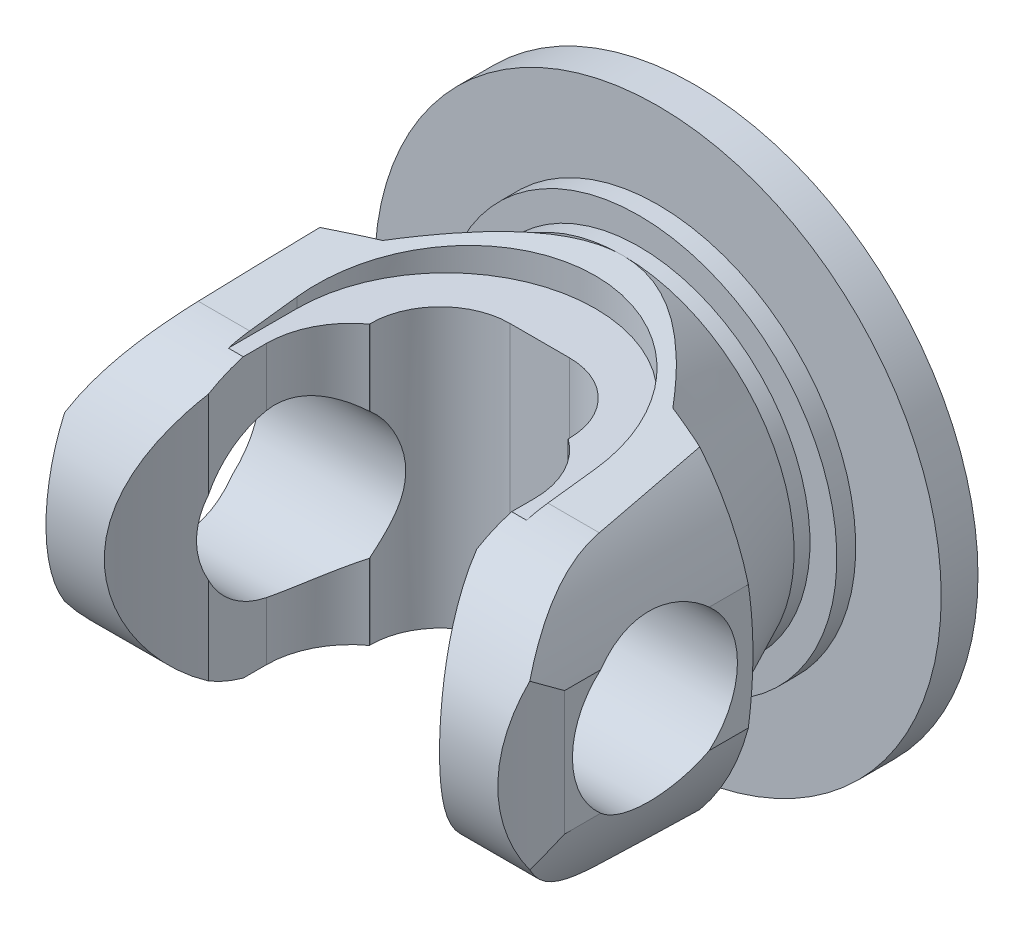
ISO-10303-21;
HEADER;
FILE_DESCRIPTION(('STEP AP214'),'2;1');
FILE_NAME('part.step','',(''),(''),'','','');
FILE_SCHEMA(('AUTOMOTIVE_DESIGN { 1 0 10303 214 1 1 1 1 }'));
ENDSEC;
DATA;
#1=APPLICATION_CONTEXT('core data for automotive mechanical design processes');
#2=APPLICATION_PROTOCOL_DEFINITION('international standard','automotive_design',2000,#1);
#3=PRODUCT_CONTEXT('',#1,'mechanical');
#4=PRODUCT('Part','Part','',(#3));
#5=PRODUCT_RELATED_PRODUCT_CATEGORY('part','',(#4));
#6=PRODUCT_DEFINITION_FORMATION('','',#4);
#7=PRODUCT_DEFINITION_CONTEXT('part definition',#1,'design');
#8=PRODUCT_DEFINITION('design','',#6,#7);
#9=PRODUCT_DEFINITION_SHAPE('','',#8);
#10=(LENGTH_UNIT() NAMED_UNIT(*) SI_UNIT(.MILLI.,.METRE.));
#11=(NAMED_UNIT(*) PLANE_ANGLE_UNIT() SI_UNIT($,.RADIAN.));
#12=(NAMED_UNIT(*) SI_UNIT($,.STERADIAN.) SOLID_ANGLE_UNIT());
#13=UNCERTAINTY_MEASURE_WITH_UNIT(LENGTH_MEASURE(1.E-05),#10,'distance_accuracy_value','');
#14=(GEOMETRIC_REPRESENTATION_CONTEXT(3) GLOBAL_UNCERTAINTY_ASSIGNED_CONTEXT((#13)) GLOBAL_UNIT_ASSIGNED_CONTEXT((#10,
#11,#12)) REPRESENTATION_CONTEXT('',''));
#15=CARTESIAN_POINT('',(0.,0.,0.));
#16=DIRECTION('',(0.,0.,1.));
#17=DIRECTION('',(1.,0.,0.));
#18=AXIS2_PLACEMENT_3D('',#15,#16,#17);
#19=CARTESIAN_POINT('',(-204.067997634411,180.084972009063,267.706053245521));
#20=DIRECTION('',(0.,-1.,0.));
#21=DIRECTION('',(-1.,0.,0.));
#22=AXIS2_PLACEMENT_3D('',#19,#20,#21);
#23=PLANE('',#22);
#24=CARTESIAN_POINT('',(-297.817997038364,180.084972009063,220.134521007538));
#25=DIRECTION('',(0.,1.,0.));
#26=DIRECTION('',(0.,0.,1.));
#27=AXIS2_PLACEMENT_3D('',#24,#25,#26);
#28=CIRCLE('',#27,35.);
#29=CARTESIAN_POINT('',(-297.817997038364,180.084972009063,185.134521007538));
#30=VERTEX_POINT('',#29);
#31=CARTESIAN_POINT('',(-332.817997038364,180.084972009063,220.134521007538));
#32=VERTEX_POINT('',#31);
#33=EDGE_CURVE('E9',#30,#32,#28,.T.);
#34=ORIENTED_EDGE('',*,*,#33,.T.);
#35=DIRECTION('',(0.,0.,1.));
#36=VECTOR('',#35,1.);
#37=CARTESIAN_POINT('',(-332.817997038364,180.084972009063,220.449862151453));
#38=LINE('',#37,#36);
#39=CARTESIAN_POINT('',(-332.817997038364,180.084972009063,220.765203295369));
#40=VERTEX_POINT('',#39);
#41=EDGE_CURVE('E29',#32,#40,#38,.T.);
#42=ORIENTED_EDGE('',*,*,#41,.T.);
#43=CARTESIAN_POINT('',(-307.817997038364,180.084972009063,255.134521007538));
#44=DIRECTION('',(0.,1.,0.));
#45=DIRECTION('',(-1.,0.,0.));
#46=AXIS2_PLACEMENT_3D('',#43,#44,#45);
#47=CIRCLE('',#46,42.5);
#48=CARTESIAN_POINT('',(-350.317997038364,180.084972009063,255.134520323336));
#49=VERTEX_POINT('',#48);
#50=EDGE_CURVE('E495',#40,#49,#47,.T.);
#51=ORIENTED_EDGE('',*,*,#50,.T.);
#52=DIRECTION('',(0.,0.,1.));
#53=VECTOR('',#52,1.);
#54=CARTESIAN_POINT('',(-350.317997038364,180.084972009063,260.920286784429));
#55=LINE('',#54,#53);
#56=CARTESIAN_POINT('',(-350.317997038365,180.084972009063,266.706053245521));
#57=VERTEX_POINT('',#56);
#58=EDGE_CURVE('E498',#49,#57,#55,.T.);
#59=ORIENTED_EDGE('',*,*,#58,.T.);
#60=DIRECTION('',(1.,0.,0.));
#61=VECTOR('',#60,1.);
#62=CARTESIAN_POINT('',(-354.067997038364,180.084972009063,266.706053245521));
#63=LINE('',#62,#61);
#64=CARTESIAN_POINT('',(-357.817997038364,180.084972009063,266.706053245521));
#65=VERTEX_POINT('',#64);
#66=EDGE_CURVE('E554',#65,#57,#63,.T.);
#67=ORIENTED_EDGE('',*,*,#66,.F.);
#68=DIRECTION('',(0.,0.,1.));
#69=VECTOR('',#68,1.);
#70=CARTESIAN_POINT('',(-357.817997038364,180.084972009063,249.420287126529));
#71=LINE('',#70,#69);
#72=CARTESIAN_POINT('',(-357.817997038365,180.084972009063,232.134521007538));
#73=VERTEX_POINT('',#72);
#74=EDGE_CURVE('E548',#73,#65,#71,.T.);
#75=ORIENTED_EDGE('',*,*,#74,.F.);
#76=CARTESIAN_POINT('',(-282.817997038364,180.084972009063,232.134521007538));
#77=DIRECTION('',(0.,1.,0.));
#78=DIRECTION('',(-1.,0.,0.));
#79=AXIS2_PLACEMENT_3D('',#76,#77,#78);
#80=CIRCLE('',#79,75.);
#81=CARTESIAN_POINT('',(-207.817997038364,180.084972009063,232.134521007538));
#82=VERTEX_POINT('',#81);
#83=EDGE_CURVE('E543',#82,#73,#80,.T.);
#84=ORIENTED_EDGE('',*,*,#83,.F.);
#85=DIRECTION('',(0.,0.,-1.));
#86=VECTOR('',#85,1.);
#87=CARTESIAN_POINT('',(-207.817997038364,180.084972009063,249.420287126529));
#88=LINE('',#87,#86);
#89=CARTESIAN_POINT('',(-207.817997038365,180.084972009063,266.70605324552));
#90=VERTEX_POINT('',#89);
#91=EDGE_CURVE('E539',#90,#82,#88,.T.);
#92=ORIENTED_EDGE('',*,*,#91,.F.);
#93=DIRECTION('',(1.,0.,0.));
#94=VECTOR('',#93,1.);
#95=CARTESIAN_POINT('',(-211.567997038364,180.084972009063,266.706053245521));
#96=LINE('',#95,#94);
#97=CARTESIAN_POINT('',(-215.317997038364,180.084972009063,266.706053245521));
#98=VERTEX_POINT('',#97);
#99=EDGE_CURVE('E535',#98,#90,#96,.T.);
#100=ORIENTED_EDGE('',*,*,#99,.F.);
#101=DIRECTION('',(0.,0.,-1.));
#102=VECTOR('',#101,1.);
#103=CARTESIAN_POINT('',(-215.317997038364,180.084972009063,260.920286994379));
#104=LINE('',#103,#102);
#105=CARTESIAN_POINT('',(-215.317997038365,180.084972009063,255.134520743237));
#106=VERTEX_POINT('',#105);
#107=EDGE_CURVE('E501',#98,#106,#104,.T.);
#108=ORIENTED_EDGE('',*,*,#107,.T.);
#109=CARTESIAN_POINT('',(-257.817997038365,180.084972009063,255.134521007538));
#110=DIRECTION('',(0.,1.,0.));
#111=DIRECTION('',(-1.,0.,0.));
#112=AXIS2_PLACEMENT_3D('',#109,#110,#111);
#113=CIRCLE('',#112,42.4999999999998);
#114=CARTESIAN_POINT('',(-232.817997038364,180.084972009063,220.765203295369));
#115=VERTEX_POINT('',#114);
#116=EDGE_CURVE('E504',#106,#115,#113,.T.);
#117=ORIENTED_EDGE('',*,*,#116,.T.);
#118=DIRECTION('',(0.,0.,-1.));
#119=VECTOR('',#118,1.);
#120=CARTESIAN_POINT('',(-232.817997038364,180.084972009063,220.449862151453));
#121=LINE('',#120,#119);
#122=CARTESIAN_POINT('',(-232.817997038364,180.084972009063,220.134521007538));
#123=VERTEX_POINT('',#122);
#124=EDGE_CURVE('E507',#115,#123,#121,.T.);
#125=ORIENTED_EDGE('',*,*,#124,.T.);
#126=CARTESIAN_POINT('',(-267.817997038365,180.084972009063,220.134521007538));
#127=DIRECTION('',(0.,1.,0.));
#128=DIRECTION('',(0.,0.,1.));
#129=AXIS2_PLACEMENT_3D('',#126,#127,#128);
#130=CIRCLE('',#129,35.0000000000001);
#131=CARTESIAN_POINT('',(-267.817997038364,180.084972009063,185.134521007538));
#132=VERTEX_POINT('',#131);
#133=EDGE_CURVE('E510',#123,#132,#130,.T.);
#134=ORIENTED_EDGE('',*,*,#133,.T.);
#135=DIRECTION('',(-1.,0.,0.));
#136=VECTOR('',#135,1.);
#137=CARTESIAN_POINT('',(-282.817997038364,180.084972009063,185.134521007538));
#138=LINE('',#137,#136);
#139=EDGE_CURVE('E513',#132,#30,#138,.T.);
#140=ORIENTED_EDGE('',*,*,#139,.T.);
#141=EDGE_LOOP('',(#34,#42,#51,#59,#67,#75,#84,#92,#100,#108,#117,#125,#134,#140));
#142=FACE_BOUND('',#141,.T.);
#143=ADVANCED_FACE('F14',(#142),#23,.T.);
#144=CARTESIAN_POINT('',(-297.817997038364,321.084972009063,220.134521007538));
#145=DIRECTION('',(0.,-1.,0.));
#146=DIRECTION('',(1.,0.,0.));
#147=AXIS2_PLACEMENT_3D('',#144,#145,#146);
#148=CYLINDRICAL_SURFACE('',#147,35.);
#149=ORIENTED_EDGE('',*,*,#33,.F.);
#150=DIRECTION('',(0.,-1.,0.));
#151=VECTOR('',#150,1.);
#152=CARTESIAN_POINT('',(-297.817997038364,250.084972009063,185.134521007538));
#153=LINE('',#152,#151);
#154=CARTESIAN_POINT('',(-297.817997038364,320.084972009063,185.134521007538));
#155=VERTEX_POINT('',#154);
#156=EDGE_CURVE('E516',#155,#30,#153,.T.);
#157=ORIENTED_EDGE('',*,*,#156,.F.);
#158=CARTESIAN_POINT('',(-297.817997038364,320.084972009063,220.134521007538));
#159=DIRECTION('',(0.,-1.,0.));
#160=DIRECTION('',(0.,0.,-1.));
#161=AXIS2_PLACEMENT_3D('',#158,#159,#160);
#162=CIRCLE('',#161,35.);
#163=CARTESIAN_POINT('',(-332.817997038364,320.084972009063,220.134521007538));
#164=VERTEX_POINT('',#163);
#165=EDGE_CURVE('E574',#164,#155,#162,.T.);
#166=ORIENTED_EDGE('',*,*,#165,.F.);
#167=DIRECTION('',(0.,-1.,0.));
#168=VECTOR('',#167,1.);
#169=CARTESIAN_POINT('',(-332.817997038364,300.842897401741,220.134521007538));
#170=LINE('',#169,#168);
#171=CARTESIAN_POINT('',(-332.817997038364,281.60082279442,220.134521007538));
#172=VERTEX_POINT('',#171);
#173=EDGE_CURVE('E272',#164,#172,#170,.T.);
#174=ORIENTED_EDGE('',*,*,#173,.T.);
#175=CARTESIAN_POINT('',(-332.817997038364,281.60082279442,220.134521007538));
#176=CARTESIAN_POINT('',(-332.817998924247,281.236359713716,219.709079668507));
#177=CARTESIAN_POINT('',(-332.810240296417,280.863295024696,219.291075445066));
#178=CARTESIAN_POINT('',(-332.780841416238,280.100881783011,218.470833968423));
#179=CARTESIAN_POINT('',(-332.759203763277,279.711536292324,218.068593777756));
#180=CARTESIAN_POINT('',(-332.703715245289,278.917776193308,217.281042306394));
#181=CARTESIAN_POINT('',(-332.669877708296,278.513378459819,216.89571306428));
#182=CARTESIAN_POINT('',(-332.591617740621,277.689944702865,216.142176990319));
#183=CARTESIAN_POINT('',(-332.547194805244,277.270907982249,215.773970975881));
#184=CARTESIAN_POINT('',(-332.400660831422,275.994658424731,214.697302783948));
#185=CARTESIAN_POINT('',(-332.285151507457,275.116594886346,214.015094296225));
#186=CARTESIAN_POINT('',(-332.030952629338,273.310813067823,212.724628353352));
#187=CARTESIAN_POINT('',(-331.892256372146,272.383080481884,212.116392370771));
#188=CARTESIAN_POINT('',(-331.604284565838,270.48642820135,210.978652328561));
#189=CARTESIAN_POINT('',(-331.455046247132,269.517657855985,210.448889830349));
#190=CARTESIAN_POINT('',(-331.157053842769,267.541031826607,209.468218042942));
#191=CARTESIAN_POINT('',(-331.008299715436,266.533179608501,209.017301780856));
#192=CARTESIAN_POINT('',(-330.722031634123,264.483111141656,208.1966197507));
#193=CARTESIAN_POINT('',(-330.584520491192,263.440886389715,207.826874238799));
#194=CARTESIAN_POINT('',(-330.330677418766,261.327629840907,207.171126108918));
#195=CARTESIAN_POINT('',(-330.214346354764,260.256596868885,206.88512691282));
#196=CARTESIAN_POINT('',(-330.059253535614,258.603078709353,206.513933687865));
#197=CARTESIAN_POINT('',(-330.009782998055,258.028400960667,206.39764827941));
#198=CARTESIAN_POINT('',(-329.92013786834,256.873949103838,206.189432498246));
#199=CARTESIAN_POINT('',(-329.879962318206,256.294175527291,206.097499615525));
#200=CARTESIAN_POINT('',(-329.809767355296,255.130606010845,205.938247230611));
#201=CARTESIAN_POINT('',(-329.779748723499,254.546809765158,205.870929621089));
#202=CARTESIAN_POINT('',(-329.730518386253,253.376429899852,205.761121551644));
#203=CARTESIAN_POINT('',(-329.711306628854,252.789846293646,205.718630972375));
#204=CARTESIAN_POINT('',(-329.684120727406,251.61556035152,205.658635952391));
#205=CARTESIAN_POINT('',(-329.676138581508,251.027859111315,205.641113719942));
#206=CARTESIAN_POINT('',(-329.671560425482,249.852197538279,205.631055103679));
#207=CARTESIAN_POINT('',(-329.674964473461,249.26423720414,205.638518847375));
#208=CARTESIAN_POINT('',(-329.693086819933,248.089363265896,205.678409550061));
#209=CARTESIAN_POINT('',(-329.707804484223,247.502449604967,205.710835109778));
#210=CARTESIAN_POINT('',(-329.748218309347,246.330954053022,205.800530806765));
#211=CARTESIAN_POINT('',(-329.773914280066,245.746372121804,205.857800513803));
#212=CARTESIAN_POINT('',(-329.861352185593,244.098502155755,206.054623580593));
#213=CARTESIAN_POINT('',(-329.935329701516,243.039152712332,206.223056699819));
#214=CARTESIAN_POINT('',(-330.113013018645,240.939292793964,206.640705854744));
#215=CARTESIAN_POINT('',(-330.216717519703,239.898781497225,206.889918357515));
#216=CARTESIAN_POINT('',(-330.446867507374,237.840919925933,207.467496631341));
#217=CARTESIAN_POINT('',(-330.573345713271,236.823605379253,207.795976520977));
#218=CARTESIAN_POINT('',(-330.840407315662,234.818981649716,208.529664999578));
#219=CARTESIAN_POINT('',(-330.98099110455,233.831673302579,208.934875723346));
#220=CARTESIAN_POINT('',(-331.27513353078,231.835193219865,209.845589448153));
#221=CARTESIAN_POINT('',(-331.428970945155,230.828097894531,210.355559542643));
#222=CARTESIAN_POINT('',(-331.729884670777,228.857801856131,211.456419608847));
#223=CARTESIAN_POINT('',(-331.876959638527,227.894609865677,212.047325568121));
#224=CARTESIAN_POINT('',(-332.151341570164,226.020122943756,213.305539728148));
#225=CARTESIAN_POINT('',(-332.278698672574,225.10870024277,213.972646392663));
#226=CARTESIAN_POINT('',(-332.500987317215,223.341307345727,215.380816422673));
#227=CARTESIAN_POINT('',(-332.595939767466,222.485301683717,216.121831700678));
#228=CARTESIAN_POINT('',(-332.71541756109,221.116954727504,217.408169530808));
#229=CARTESIAN_POINT('',(-332.752921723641,220.587147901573,217.933816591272));
#230=CARTESIAN_POINT('',(-332.8042087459,219.556214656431,219.013375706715));
#231=CARTESIAN_POINT('',(-332.817996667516,219.055082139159,219.567281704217));
#232=CARTESIAN_POINT('',(-332.817997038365,218.569161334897,220.134521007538));
#233=B_SPLINE_CURVE_WITH_KNOTS('',3,(#175,#176,#177,#178,#179,#180,#181,#182,#183,#184,#185,
#186,#187,#188,#189,#190,#191,#192,#193,#194,#195,#196,#197,#198,#199,#200,#201,#202,#203,#204,
#205,#206,#207,#208,#209,#210,#211,#212,#213,#214,#215,#216,#217,#218,#219,#220,#221,#222,#223,
#224,#225,#226,#227,#228,#229,#230,#231,#232),.UNSPECIFIED.,.F.,.F.,(4,2,2,2,2,2,2,2,2,2,2,2,2,
2,2,2,2,2,2,2,2,2,2,2,2,2,2,2,4),(0.,1.6803795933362,3.36044456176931,5.03867964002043,
6.71699474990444,10.0664103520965,13.4167959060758,16.7558897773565,20.0946882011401,
23.4343188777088,26.7740859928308,28.5388073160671,30.3033466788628,32.0680216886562,
33.8326882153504,35.5960966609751,37.3595141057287,39.1228327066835,40.8861207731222,
44.1077058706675,47.3291500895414,50.5552600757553,53.7814598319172,57.1955841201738,
60.6103837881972,64.0163524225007,67.4201192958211,69.6605608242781,71.9005241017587),.UNSPECIFIED.);
#234=CARTESIAN_POINT('',(-332.817997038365,218.569161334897,220.134521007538));
#235=VERTEX_POINT('',#234);
#236=EDGE_CURVE('E248',#172,#235,#233,.T.);
#237=ORIENTED_EDGE('',*,*,#236,.T.);
#238=DIRECTION('',(0.,-1.,0.));
#239=VECTOR('',#238,1.);
#240=CARTESIAN_POINT('',(-332.817997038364,199.32706667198,220.134521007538));
#241=LINE('',#240,#239);
#242=EDGE_CURVE('E38',#235,#32,#241,.T.);
#243=ORIENTED_EDGE('',*,*,#242,.T.);
#244=EDGE_LOOP('',(#149,#157,#166,#174,#237,#243));
#245=FACE_BOUND('',#244,.T.);
#246=ADVANCED_FACE('F281',(#245),#148,.F.);
#247=CARTESIAN_POINT('',(-297.817997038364,321.084972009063,185.134521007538));
#248=DIRECTION('',(0.,0.,1.));
#249=DIRECTION('',(0.,-1.,0.));
#250=AXIS2_PLACEMENT_3D('',#247,#248,#249);
#251=PLANE('',#250);
#252=ORIENTED_EDGE('',*,*,#139,.F.);
#253=DIRECTION('',(0.,-1.,0.));
#254=VECTOR('',#253,1.);
#255=CARTESIAN_POINT('',(-267.817997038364,250.084972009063,185.134521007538));
#256=LINE('',#255,#254);
#257=CARTESIAN_POINT('',(-267.817997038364,320.084972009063,185.134521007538));
#258=VERTEX_POINT('',#257);
#259=EDGE_CURVE('E518',#258,#132,#256,.T.);
#260=ORIENTED_EDGE('',*,*,#259,.F.);
#261=DIRECTION('',(1.,0.,0.));
#262=VECTOR('',#261,1.);
#263=CARTESIAN_POINT('',(-282.817997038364,320.084972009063,185.134521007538));
#264=LINE('',#263,#262);
#265=EDGE_CURVE('E577',#155,#258,#264,.T.);
#266=ORIENTED_EDGE('',*,*,#265,.F.);
#267=ORIENTED_EDGE('',*,*,#156,.T.);
#268=EDGE_LOOP('',(#252,#260,#266,#267));
#269=FACE_BOUND('',#268,.T.);
#270=ADVANCED_FACE('F1019',(#269),#251,.T.);
#271=CARTESIAN_POINT('',(-267.817997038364,321.084972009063,220.134521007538));
#272=DIRECTION('',(0.,-1.,0.));
#273=DIRECTION('',(0.,0.,-1.));
#274=AXIS2_PLACEMENT_3D('',#271,#272,#273);
#275=CYLINDRICAL_SURFACE('',#274,35.);
#276=ORIENTED_EDGE('',*,*,#133,.F.);
#277=DIRECTION('',(0.,-1.,0.));
#278=VECTOR('',#277,1.);
#279=CARTESIAN_POINT('',(-232.817997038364,199.32706667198,220.134521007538));
#280=LINE('',#279,#278);
#281=CARTESIAN_POINT('',(-232.817997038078,218.569161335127,220.13452100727));
#282=VERTEX_POINT('',#281);
#283=EDGE_CURVE('E692',#282,#123,#280,.T.);
#284=ORIENTED_EDGE('',*,*,#283,.F.);
#285=CARTESIAN_POINT('',(-232.817997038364,218.569161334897,220.134521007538));
#286=CARTESIAN_POINT('',(-232.817995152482,218.933624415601,219.709079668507));
#287=CARTESIAN_POINT('',(-232.825753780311,219.306689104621,219.291075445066));
#288=CARTESIAN_POINT('',(-232.855152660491,220.069102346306,218.470833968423));
#289=CARTESIAN_POINT('',(-232.876790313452,220.458447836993,218.068593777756));
#290=CARTESIAN_POINT('',(-232.932278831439,221.252207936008,217.281042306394));
#291=CARTESIAN_POINT('',(-232.966116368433,221.656605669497,216.89571306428));
#292=CARTESIAN_POINT('',(-233.044376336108,222.480039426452,216.142176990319));
#293=CARTESIAN_POINT('',(-233.088799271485,222.899076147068,215.773970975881));
#294=CARTESIAN_POINT('',(-233.235333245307,224.175325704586,214.697302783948));
#295=CARTESIAN_POINT('',(-233.350842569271,225.05338924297,214.015094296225));
#296=CARTESIAN_POINT('',(-233.605041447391,226.859171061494,212.724628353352));
#297=CARTESIAN_POINT('',(-233.743737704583,227.786903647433,212.116392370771));
#298=CARTESIAN_POINT('',(-234.031709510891,229.683555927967,210.978652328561));
#299=CARTESIAN_POINT('',(-234.180947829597,230.652326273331,210.448889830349));
#300=CARTESIAN_POINT('',(-234.47894023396,232.62895230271,209.468218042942));
#301=CARTESIAN_POINT('',(-234.627694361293,233.636804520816,209.017301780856));
#302=CARTESIAN_POINT('',(-234.913962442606,235.686872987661,208.1966197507));
#303=CARTESIAN_POINT('',(-235.051473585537,236.729097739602,207.826874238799));
#304=CARTESIAN_POINT('',(-235.305316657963,238.84235428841,207.171126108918));
#305=CARTESIAN_POINT('',(-235.421647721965,239.913387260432,206.88512691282));
#306=CARTESIAN_POINT('',(-235.576740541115,241.566905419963,206.513933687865));
#307=CARTESIAN_POINT('',(-235.626211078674,242.14158316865,206.39764827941));
#308=CARTESIAN_POINT('',(-235.715856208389,243.296035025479,206.189432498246));
#309=CARTESIAN_POINT('',(-235.756031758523,243.875808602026,206.097499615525));
#310=CARTESIAN_POINT('',(-235.826226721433,245.039378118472,205.938247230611));
#311=CARTESIAN_POINT('',(-235.856245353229,245.623174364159,205.870929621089));
#312=CARTESIAN_POINT('',(-235.905475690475,246.793554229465,205.761121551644));
#313=CARTESIAN_POINT('',(-235.924687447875,247.380137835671,205.718630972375));
#314=CARTESIAN_POINT('',(-235.951873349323,248.554423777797,205.658635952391));
#315=CARTESIAN_POINT('',(-235.959855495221,249.142125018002,205.641113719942));
#316=CARTESIAN_POINT('',(-235.964433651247,250.317786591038,205.631055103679));
#317=CARTESIAN_POINT('',(-235.961029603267,250.905746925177,205.638518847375));
#318=CARTESIAN_POINT('',(-235.942907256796,252.08062086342,205.678409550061));
#319=CARTESIAN_POINT('',(-235.928189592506,252.667534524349,205.710835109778));
#320=CARTESIAN_POINT('',(-235.887775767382,253.839030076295,205.800530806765));
#321=CARTESIAN_POINT('',(-235.862079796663,254.423612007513,205.857800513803));
#322=CARTESIAN_POINT('',(-235.774641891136,256.071481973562,206.054623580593));
#323=CARTESIAN_POINT('',(-235.700664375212,257.130831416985,206.223056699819));
#324=CARTESIAN_POINT('',(-235.522981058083,259.230691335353,206.640705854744));
#325=CARTESIAN_POINT('',(-235.419276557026,260.271202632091,206.889918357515));
#326=CARTESIAN_POINT('',(-235.189126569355,262.329064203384,207.467496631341));
#327=CARTESIAN_POINT('',(-235.062648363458,263.346378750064,207.795976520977));
#328=CARTESIAN_POINT('',(-234.795586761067,265.3510024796,208.529664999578));
#329=CARTESIAN_POINT('',(-234.655002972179,266.338310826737,208.934875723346));
#330=CARTESIAN_POINT('',(-234.360860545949,268.334790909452,209.845589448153));
#331=CARTESIAN_POINT('',(-234.207023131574,269.341886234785,210.355559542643));
#332=CARTESIAN_POINT('',(-233.906109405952,271.312182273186,211.456419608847));
#333=CARTESIAN_POINT('',(-233.759034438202,272.27537426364,212.047325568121));
#334=CARTESIAN_POINT('',(-233.484652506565,274.149861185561,213.305539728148));
#335=CARTESIAN_POINT('',(-233.357295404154,275.061283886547,213.972646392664));
#336=CARTESIAN_POINT('',(-233.135006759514,276.828676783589,215.380816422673));
#337=CARTESIAN_POINT('',(-233.040054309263,277.6846824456,216.121831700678));
#338=CARTESIAN_POINT('',(-232.920576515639,279.053029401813,217.408169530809));
#339=CARTESIAN_POINT('',(-232.883072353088,279.582836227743,217.933816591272));
#340=CARTESIAN_POINT('',(-232.831785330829,280.613769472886,219.013375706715));
#341=CARTESIAN_POINT('',(-232.817997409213,281.114901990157,219.567281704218));
#342=CARTESIAN_POINT('',(-232.817997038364,281.600822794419,220.134521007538));
#343=B_SPLINE_CURVE_WITH_KNOTS('',3,(#285,#286,#287,#288,#289,#290,#291,#292,#293,#294,#295,
#296,#297,#298,#299,#300,#301,#302,#303,#304,#305,#306,#307,#308,#309,#310,#311,#312,#313,#314,
#315,#316,#317,#318,#319,#320,#321,#322,#323,#324,#325,#326,#327,#328,#329,#330,#331,#332,#333,
#334,#335,#336,#337,#338,#339,#340,#341,#342),.UNSPECIFIED.,.F.,.F.,(4,2,2,2,2,2,2,2,2,2,2,2,2,
2,2,2,2,2,2,2,2,2,2,2,2,2,2,2,4),(0.,1.68037959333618,3.3604445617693,5.03867964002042,
6.71699474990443,10.0664103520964,13.4167959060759,16.7558897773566,20.0946882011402,
23.4343188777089,26.7740859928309,28.5388073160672,30.3033466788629,32.0680216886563,
33.8326882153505,35.5960966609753,37.3595141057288,39.1228327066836,40.8861207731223,
44.1077058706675,47.3291500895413,50.5552600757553,53.7814598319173,57.1955841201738,
60.6103837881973,64.0163524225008,67.4201192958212,69.6605608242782,71.9005241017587),.UNSPECIFIED.);
#344=CARTESIAN_POINT('',(-232.817997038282,281.600822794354,220.134521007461));
#345=VERTEX_POINT('',#344);
#346=EDGE_CURVE('E273',#282,#345,#343,.T.);
#347=ORIENTED_EDGE('',*,*,#346,.T.);
#348=DIRECTION('',(0.,-1.,0.));
#349=VECTOR('',#348,1.);
#350=CARTESIAN_POINT('',(-232.817997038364,300.842897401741,220.134521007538));
#351=LINE('',#350,#349);
#352=CARTESIAN_POINT('',(-232.817997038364,320.084972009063,220.134521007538));
#353=VERTEX_POINT('',#352);
#354=EDGE_CURVE('E700',#353,#345,#351,.T.);
#355=ORIENTED_EDGE('',*,*,#354,.F.);
#356=CARTESIAN_POINT('',(-267.817997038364,320.084972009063,220.134521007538));
#357=DIRECTION('',(0.,-1.,0.));
#358=DIRECTION('',(1.,0.,0.));
#359=AXIS2_PLACEMENT_3D('',#356,#357,#358);
#360=CIRCLE('',#359,35.);
#361=EDGE_CURVE('E580',#258,#353,#360,.T.);
#362=ORIENTED_EDGE('',*,*,#361,.F.);
#363=ORIENTED_EDGE('',*,*,#259,.T.);
#364=EDGE_LOOP('',(#276,#284,#347,#355,#362,#363));
#365=FACE_BOUND('',#364,.T.);
#366=ADVANCED_FACE('F1059',(#365),#275,.F.);
#367=CARTESIAN_POINT('',(-232.817997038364,327.630560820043,220.134521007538));
#368=DIRECTION('',(-1.,0.,0.));
#369=DIRECTION('',(0.,-1.,0.));
#370=AXIS2_PLACEMENT_3D('',#367,#368,#369);
#371=PLANE('',#370);
#372=ORIENTED_EDGE('',*,*,#124,.F.);
#373=DIRECTION('',(0.,-1.,0.));
#374=VECTOR('',#373,1.);
#375=CARTESIAN_POINT('',(-232.817997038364,199.062289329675,220.765203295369));
#376=LINE('',#375,#374);
#377=CARTESIAN_POINT('',(-232.817997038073,218.039606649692,220.765203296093));
#378=VERTEX_POINT('',#377);
#379=EDGE_CURVE('E706',#378,#115,#376,.T.);
#380=ORIENTED_EDGE('',*,*,#379,.F.);
#381=CARTESIAN_POINT('',(-232.817997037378,250.084992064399,247.134565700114));
#382=DIRECTION('',(1.,-1.81874984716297E-11,-1.5315208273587E-11));
#383=DIRECTION('',(1.81874984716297E-11,1.,0.));
#384=AXIS2_PLACEMENT_3D('',#381,#382,#383);
#385=CIRCLE('',#384,41.4999999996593);
#386=EDGE_CURVE('E521',#378,#282,#385,.T.);
#387=ORIENTED_EDGE('',*,*,#386,.T.);
#388=ORIENTED_EDGE('',*,*,#283,.T.);
#389=EDGE_LOOP('',(#372,#380,#387,#388));
#390=FACE_BOUND('',#389,.T.);
#391=ADVANCED_FACE('F1245',(#390),#371,.T.);
#392=CARTESIAN_POINT('',(-257.817997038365,327.553122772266,255.134521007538));
#393=DIRECTION('',(0.,-1.,0.));
#394=DIRECTION('',(1.,0.,0.));
#395=AXIS2_PLACEMENT_3D('',#392,#393,#394);
#396=CYLINDRICAL_SURFACE('',#395,42.5000000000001);
#397=ORIENTED_EDGE('',*,*,#116,.F.);
#398=DIRECTION('',(0.,1.,0.));
#399=VECTOR('',#398,1.);
#400=CARTESIAN_POINT('',(-215.317997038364,194.724169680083,255.134520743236));
#401=LINE('',#400,#399);
#402=CARTESIAN_POINT('',(-215.317997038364,209.363367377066,255.134520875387));
#403=VERTEX_POINT('',#402);
#404=EDGE_CURVE('E695',#106,#403,#401,.T.);
#405=ORIENTED_EDGE('',*,*,#404,.T.);
#406=CARTESIAN_POINT('',(-215.317997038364,209.363367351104,255.134520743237));
#407=CARTESIAN_POINT('',(-215.31799511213,209.298168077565,254.802651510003));
#408=CARTESIAN_POINT('',(-215.321884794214,209.237034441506,254.4700061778));
#409=CARTESIAN_POINT('',(-215.337537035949,209.122940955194,253.80349851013));
#410=CARTESIAN_POINT('',(-215.349299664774,209.069981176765,253.469636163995));
#411=CARTESIAN_POINT('',(-215.396383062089,208.923888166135,252.469884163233));
#412=CARTESIAN_POINT('',(-215.443497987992,208.842926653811,251.802697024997));
#413=CARTESIAN_POINT('',(-215.569631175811,208.713667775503,250.468174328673));
#414=CARTESIAN_POINT('',(-215.648649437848,208.665370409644,249.800838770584));
#415=CARTESIAN_POINT('',(-215.791265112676,208.617096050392,248.800641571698));
#416=CARTESIAN_POINT('',(-215.842968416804,208.605033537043,248.466593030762));
#417=CARTESIAN_POINT('',(-215.954363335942,208.588980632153,247.799638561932));
#418=CARTESIAN_POINT('',(-216.014054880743,208.584990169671,247.46673262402));
#419=CARTESIAN_POINT('',(-216.077720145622,208.584992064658,247.134565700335));
#420=B_SPLINE_CURVE_WITH_KNOTS('',3,(#406,#407,#408,#409,#410,#411,#412,#413,#414,#415,#416,
#417,#418,#419),.UNSPECIFIED.,.F.,.F.,(4,2,2,2,2,2,4),(0.,1.01454624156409,2.02910139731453,
4.04865497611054,6.06820856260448,7.08276371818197,8.09730995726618),.UNSPECIFIED.);
#421=CARTESIAN_POINT('',(-216.077720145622,208.584992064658,247.134565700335));
#422=VERTEX_POINT('',#421);
#423=EDGE_CURVE('E709',#403,#422,#420,.T.);
#424=ORIENTED_EDGE('',*,*,#423,.T.);
#425=CARTESIAN_POINT('',(-216.077720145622,208.584992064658,247.134565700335));
#426=CARTESIAN_POINT('',(-216.172164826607,208.584975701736,246.641702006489));
#427=CARTESIAN_POINT('',(-216.275368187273,208.59377161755,246.150541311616));
#428=CARTESIAN_POINT('',(-216.498929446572,208.628503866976,245.172808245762));
#429=CARTESIAN_POINT('',(-216.619285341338,208.654438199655,244.686235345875));
#430=CARTESIAN_POINT('',(-216.876661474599,208.722923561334,243.719306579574));
#431=CARTESIAN_POINT('',(-217.01366219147,208.765455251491,243.238944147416));
#432=CARTESIAN_POINT('',(-217.303971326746,208.866536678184,242.284911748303));
#433=CARTESIAN_POINT('',(-217.457280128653,208.925086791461,241.811241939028));
#434=CARTESIAN_POINT('',(-217.937437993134,209.122375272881,240.411894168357));
#435=CARTESIAN_POINT('',(-218.287398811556,209.283542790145,239.497109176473));
#436=CARTESIAN_POINT('',(-219.044888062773,209.660452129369,237.703376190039));
#437=CARTESIAN_POINT('',(-219.452430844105,209.876207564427,236.824437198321));
#438=CARTESIAN_POINT('',(-220.318298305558,210.354998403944,235.111047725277));
#439=CARTESIAN_POINT('',(-220.776369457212,210.617801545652,234.276403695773));
#440=CARTESIAN_POINT('',(-221.74031168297,211.185182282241,232.650210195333));
#441=CARTESIAN_POINT('',(-222.246181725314,211.489758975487,231.858659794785));
#442=CARTESIAN_POINT('',(-223.303691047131,212.135896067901,230.317392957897));
#443=CARTESIAN_POINT('',(-223.855510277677,212.477603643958,229.567862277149));
#444=CARTESIAN_POINT('',(-224.999314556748,213.190928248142,228.115293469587));
#445=CARTESIAN_POINT('',(-225.59129726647,213.562543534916,227.412252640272));
#446=CARTESIAN_POINT('',(-226.707839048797,214.264216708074,226.169340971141));
#447=CARTESIAN_POINT('',(-227.226623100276,214.590518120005,225.62212241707));
#448=CARTESIAN_POINT('',(-228.288140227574,215.256384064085,224.560002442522));
#449=CARTESIAN_POINT('',(-228.830872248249,215.595948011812,224.045099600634));
#450=CARTESIAN_POINT('',(-229.935262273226,216.282702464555,223.051012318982));
#451=CARTESIAN_POINT('',(-230.496763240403,216.629823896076,222.571605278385));
#452=CARTESIAN_POINT('',(-231.641360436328,217.330613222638,221.644595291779));
#453=CARTESIAN_POINT('',(-232.224453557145,217.684280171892,221.196987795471));
#454=CARTESIAN_POINT('',(-232.817997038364,218.039606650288,220.765203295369));
#455=B_SPLINE_CURVE_WITH_KNOTS('',3,(#425,#426,#427,#428,#429,#430,#431,#432,#433,#434,#435,
#436,#437,#438,#439,#440,#441,#442,#443,#444,#445,#446,#447,#448,#449,#450,#451,#452,#453,#454),
.UNSPECIFIED.,.F.,.F.,(4,2,2,2,2,2,2,2,2,2,2,2,2,2,4),(0.,1.5052991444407,3.01042257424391,
4.51379748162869,6.01720775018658,8.99063428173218,11.964803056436,14.9246748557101,
17.8844827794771,20.8564828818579,23.8283100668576,26.2920803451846,28.7557421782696,
31.2023480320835,33.6486030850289),.UNSPECIFIED.);
#456=EDGE_CURVE('E714',#422,#378,#455,.T.);
#457=ORIENTED_EDGE('',*,*,#456,.T.);
#458=ORIENTED_EDGE('',*,*,#379,.T.);
#459=EDGE_LOOP('',(#397,#405,#424,#457,#458));
#460=FACE_BOUND('',#459,.T.);
#461=ADVANCED_FACE('F1243',(#460),#396,.F.);
#462=CARTESIAN_POINT('',(-215.317997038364,323.333101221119,255.134520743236));
#463=DIRECTION('',(-1.,0.,0.));
#464=DIRECTION('',(0.,-1.,0.));
#465=AXIS2_PLACEMENT_3D('',#462,#463,#464);
#466=PLANE('',#465);
#467=ORIENTED_EDGE('',*,*,#107,.F.);
#468=CARTESIAN_POINT('',(-215.317997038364,250.084972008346,247.134521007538));
#469=DIRECTION('',(1.,0.,0.));
#470=DIRECTION('',(0.,1.,0.));
#471=AXIS2_PLACEMENT_3D('',#468,#469,#470);
#472=CIRCLE('',#471,72.6845573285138);
#473=CARTESIAN_POINT('',(-215.317997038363,187.605933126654,284.274991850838));
#474=VERTEX_POINT('',#473);
#475=EDGE_CURVE('E538',#474,#98,#472,.T.);
#476=ORIENTED_EDGE('',*,*,#475,.F.);
#477=DIRECTION('',(0.,-1.,0.));
#478=VECTOR('',#477,1.);
#479=CARTESIAN_POINT('',(-215.317997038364,209.587509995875,284.274991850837));
#480=LINE('',#479,#478);
#481=CARTESIAN_POINT('',(-215.317997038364,231.569086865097,284.274991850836));
#482=VERTEX_POINT('',#481);
#483=EDGE_CURVE('E723',#482,#474,#480,.T.);
#484=ORIENTED_EDGE('',*,*,#483,.F.);
#485=CARTESIAN_POINT('',(-215.317997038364,250.084992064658,247.134565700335));
#486=DIRECTION('',(1.,0.,0.));
#487=DIRECTION('',(0.,1.,0.));
#488=AXIS2_PLACEMENT_3D('',#485,#486,#487);
#489=CIRCLE('',#488,41.4999999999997);
#490=EDGE_CURVE('E525',#482,#403,#489,.T.);
#491=ORIENTED_EDGE('',*,*,#490,.T.);
#492=ORIENTED_EDGE('',*,*,#404,.F.);
#493=EDGE_LOOP('',(#467,#476,#484,#491,#492));
#494=FACE_BOUND('',#493,.T.);
#495=ADVANCED_FACE('F1162',(#494),#466,.T.);
#496=CARTESIAN_POINT('',(-412.817997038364,250.084972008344,247.134521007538));
#497=DIRECTION('',(1.,0.,0.));
#498=DIRECTION('',(0.,0.,-1.));
#499=AXIS2_PLACEMENT_3D('',#496,#497,#498);
#500=CYLINDRICAL_SURFACE('',#499,72.6845573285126);
#501=CARTESIAN_POINT('',(-207.817997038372,250.084972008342,247.134521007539));
#502=DIRECTION('',(1.,0.,0.));
#503=DIRECTION('',(0.,1.,0.));
#504=AXIS2_PLACEMENT_3D('',#501,#502,#503);
#505=CIRCLE('',#504,72.6845573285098);
#506=CARTESIAN_POINT('',(-207.817997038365,177.94219434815,255.992540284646));
#507=VERTEX_POINT('',#506);
#508=EDGE_CURVE('E522',#90,#507,#505,.T.);
#509=ORIENTED_EDGE('',*,*,#508,.T.);
#510=DIRECTION('',(1.,0.,0.));
#511=VECTOR('',#510,1.);
#512=CARTESIAN_POINT('',(-194.89126892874,177.942194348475,255.992540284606));
#513=LINE('',#512,#511);
#514=CARTESIAN_POINT('',(-181.964540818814,177.942194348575,255.992540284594));
#515=VERTEX_POINT('',#514);
#516=EDGE_CURVE('E526',#507,#515,#513,.T.);
#517=ORIENTED_EDGE('',*,*,#516,.T.);
#518=CARTESIAN_POINT('',(-165.824812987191,208.992455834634,307.088253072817));
#519=CARTESIAN_POINT('',(-166.132493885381,208.11643202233,306.487819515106));
#520=CARTESIAN_POINT('',(-166.44611916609,207.255023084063,305.86918974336));
#521=CARTESIAN_POINT('',(-167.083133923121,205.562412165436,304.596748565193));
#522=CARTESIAN_POINT('',(-167.406522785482,204.731208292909,303.942939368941));
#523=CARTESIAN_POINT('',(-168.060936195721,203.099981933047,302.601362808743));
#524=CARTESIAN_POINT('',(-168.391959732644,202.299955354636,301.913599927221));
#525=CARTESIAN_POINT('',(-169.059492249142,200.731866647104,300.505175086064));
#526=CARTESIAN_POINT('',(-169.396001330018,199.963805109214,299.784512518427));
#527=CARTESIAN_POINT('',(-170.415871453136,197.696796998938,297.56292944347));
#528=CARTESIAN_POINT('',(-171.104420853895,196.247737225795,296.012869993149));
#529=CARTESIAN_POINT('',(-172.47609426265,193.489583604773,292.790902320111));
#530=CARTESIAN_POINT('',(-173.159218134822,192.180493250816,291.118991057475));
#531=CARTESIAN_POINT('',(-174.500934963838,189.707868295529,287.658315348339));
#532=CARTESIAN_POINT('',(-175.159499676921,188.544497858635,285.869422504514));
#533=CARTESIAN_POINT('',(-176.430197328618,186.372970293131,282.183064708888));
#534=CARTESIAN_POINT('',(-177.042323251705,185.364836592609,280.285583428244));
#535=CARTESIAN_POINT('',(-177.906999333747,183.979168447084,277.37056086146));
#536=CARTESIAN_POINT('',(-178.185683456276,183.539298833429,276.38992432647));
#537=CARTESIAN_POINT('',(-178.723093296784,182.701750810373,274.405489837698));
#538=CARTESIAN_POINT('',(-178.981821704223,182.304066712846,273.401695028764));
#539=CARTESIAN_POINT('',(-179.476373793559,181.552415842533,271.372987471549));
#540=CARTESIAN_POINT('',(-179.712209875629,181.198425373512,270.348086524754));
#541=CARTESIAN_POINT('',(-180.158343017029,180.535312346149,268.278551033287));
#542=CARTESIAN_POINT('',(-180.368644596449,180.22618184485,267.233920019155));
#543=CARTESIAN_POINT('',(-180.719403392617,179.714866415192,265.350785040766));
#544=CARTESIAN_POINT('',(-180.865206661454,179.503914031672,264.515643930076));
#545=CARTESIAN_POINT('',(-181.138129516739,179.111303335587,262.835702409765));
#546=CARTESIAN_POINT('',(-181.265254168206,178.929637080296,261.990904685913));
#547=CARTESIAN_POINT('',(-181.49993324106,178.595868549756,260.291414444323));
#548=CARTESIAN_POINT('',(-181.607457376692,178.443812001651,259.436708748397));
#549=CARTESIAN_POINT('',(-181.801789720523,178.170070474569,257.719812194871));
#550=CARTESIAN_POINT('',(-181.888590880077,178.048395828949,256.857618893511));
#551=CARTESIAN_POINT('',(-181.96454081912,177.94219434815,255.992540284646));
#552=B_SPLINE_CURVE_WITH_KNOTS('',3,(#518,#519,#520,#521,#522,#523,#524,#525,#526,#527,#528,
#529,#530,#531,#532,#533,#534,#535,#536,#537,#538,#539,#540,#541,#542,#543,#544,#545,#546,#547,
#548,#549,#550,#551),.UNSPECIFIED.,.F.,.F.,(4,2,2,2,2,2,2,2,2,2,2,2,2,2,2,2,4),(0.,
3.31681491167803,6.63342168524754,9.94959177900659,13.2658231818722,19.9498658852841,
26.6340753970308,33.3257487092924,40.0184309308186,43.3483745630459,46.6778686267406,
50.0055490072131,53.3326394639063,55.9528178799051,58.5722844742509,61.1957648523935,
63.8201363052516),.UNSPECIFIED.);
#553=CARTESIAN_POINT('',(-165.824815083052,208.992454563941,307.088252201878));
#554=VERTEX_POINT('',#553);
#555=EDGE_CURVE('E788',#554,#515,#552,.T.);
#556=ORIENTED_EDGE('',*,*,#555,.F.);
#557=CARTESIAN_POINT('',(-165.824815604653,208.992457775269,307.088254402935));
#558=CARTESIAN_POINT('',(-165.9585223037,209.81561226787,307.652459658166));
#559=CARTESIAN_POINT('',(-166.090232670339,210.650623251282,308.199850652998));
#560=CARTESIAN_POINT('',(-166.348771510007,212.343041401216,309.260105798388));
#561=CARTESIAN_POINT('',(-166.475599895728,213.200448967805,309.772969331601));
#562=CARTESIAN_POINT('',(-166.723498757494,214.936440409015,310.763323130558));
#563=CARTESIAN_POINT('',(-166.844568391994,215.815027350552,311.240808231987));
#564=CARTESIAN_POINT('',(-167.080072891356,217.591854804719,312.159457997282));
#565=CARTESIAN_POINT('',(-167.194507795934,218.490095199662,312.60062287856));
#566=CARTESIAN_POINT('',(-167.415983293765,220.305292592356,313.446047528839));
#567=CARTESIAN_POINT('',(-167.523019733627,221.222259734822,313.850286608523));
#568=CARTESIAN_POINT('',(-167.728857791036,223.073002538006,314.62083972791));
#569=CARTESIAN_POINT('',(-167.827658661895,224.006779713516,314.987150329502));
#570=CARTESIAN_POINT('',(-168.01627023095,225.889352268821,315.681024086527));
#571=CARTESIAN_POINT('',(-168.10608232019,226.838145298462,316.008593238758));
#572=CARTESIAN_POINT('',(-168.276069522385,228.749359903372,316.624409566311));
#573=CARTESIAN_POINT('',(-168.356243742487,229.711782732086,316.912653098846));
#574=CARTESIAN_POINT('',(-168.506443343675,231.649856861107,317.449554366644));
#575=CARTESIAN_POINT('',(-168.576454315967,232.625524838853,317.698155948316));
#576=CARTESIAN_POINT('',(-168.705661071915,234.587122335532,318.154769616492));
#577=CARTESIAN_POINT('',(-168.764855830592,235.573052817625,318.362777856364));
#578=CARTESIAN_POINT('',(-168.871958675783,237.553240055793,318.737704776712));
#579=CARTESIAN_POINT('',(-168.919867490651,238.547496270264,318.904626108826));
#580=CARTESIAN_POINT('',(-169.004032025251,240.542671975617,319.197035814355));
#581=CARTESIAN_POINT('',(-169.040286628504,241.543592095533,319.322520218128));
#582=CARTESIAN_POINT('',(-169.100821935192,243.549211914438,319.531650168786));
#583=CARTESIAN_POINT('',(-169.125113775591,244.553907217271,319.615334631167));
#584=CARTESIAN_POINT('',(-169.161584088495,246.566223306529,319.74085489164));
#585=CARTESIAN_POINT('',(-169.173761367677,247.573844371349,319.7826865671));
#586=CARTESIAN_POINT('',(-169.1858987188,249.589909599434,319.824383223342));
#587=CARTESIAN_POINT('',(-169.185860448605,250.59835363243,319.82425389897));
#588=CARTESIAN_POINT('',(-169.173578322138,252.614315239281,319.782055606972));
#589=CARTESIAN_POINT('',(-169.161333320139,253.621832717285,319.739982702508));
#590=CARTESIAN_POINT('',(-169.107225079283,256.594615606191,319.553784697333));
#591=CARTESIAN_POINT('',(-169.048247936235,258.556232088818,319.350584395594));
#592=CARTESIAN_POINT('',(-168.885676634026,262.454483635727,318.785902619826));
#593=CARTESIAN_POINT('',(-168.782080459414,264.391117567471,318.424413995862));
#594=CARTESIAN_POINT('',(-168.53333389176,268.226661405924,317.546136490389));
#595=CARTESIAN_POINT('',(-168.388172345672,270.12556104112,317.029305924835));
#596=CARTESIAN_POINT('',(-168.060549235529,273.872018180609,315.844634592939));
#597=CARTESIAN_POINT('',(-167.878095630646,275.719586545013,315.176826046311));
#598=CARTESIAN_POINT('',(-167.54825820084,278.737302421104,313.946008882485));
#599=CARTESIAN_POINT('',(-167.409869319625,279.925316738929,313.423887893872));
#600=CARTESIAN_POINT('',(-167.120741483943,282.270478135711,312.317483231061));
#601=CARTESIAN_POINT('',(-166.970003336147,283.427627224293,311.733203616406));
#602=CARTESIAN_POINT('',(-166.658369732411,285.705071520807,310.505826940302));
#603=CARTESIAN_POINT('',(-166.497500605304,286.82545161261,309.862880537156));
#604=CARTESIAN_POINT('',(-166.167142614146,289.029660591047,308.518750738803));
#605=CARTESIAN_POINT('',(-165.99765235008,290.113483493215,307.817557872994));
#606=CARTESIAN_POINT('',(-165.824815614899,291.177486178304,307.088254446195));
#607=B_SPLINE_CURVE_WITH_KNOTS('',3,(#557,#558,#559,#560,#561,#562,#563,#564,#565,#566,#567,
#568,#569,#570,#571,#572,#573,#574,#575,#576,#577,#578,#579,#580,#581,#582,#583,#584,#585,#586,
#587,#588,#589,#590,#591,#592,#593,#594,#595,#596,#597,#598,#599,#600,#601,#602,#603,#604,#605,
#606),.UNSPECIFIED.,.F.,.F.,(4,2,2,2,2,2,2,2,2,2,2,2,2,2,2,2,2,2,2,2,2,2,2,2,4),(0.,
3.02040925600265,6.04087250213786,9.06177579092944,12.0826609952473,15.1052285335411,
18.1280698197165,21.1504425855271,24.173095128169,27.1999919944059,30.2271755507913,
33.2541636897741,36.2814417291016,39.3058961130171,42.3306483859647,45.3549901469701,
48.3796158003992,54.290933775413,60.202518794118,66.1156915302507,72.0276035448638,
75.9410013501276,79.8541437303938,83.7575056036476,87.6615033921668),.UNSPECIFIED.);
#608=CARTESIAN_POINT('',(-165.824809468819,291.177467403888,307.088228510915));
#609=VERTEX_POINT('',#608);
#610=EDGE_CURVE('E772',#554,#609,#607,.T.);
#611=ORIENTED_EDGE('',*,*,#610,.T.);
#612=CARTESIAN_POINT('',(-181.964540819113,322.22774966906,255.992540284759));
#613=CARTESIAN_POINT('',(-181.879097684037,322.108262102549,256.965905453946));
#614=CARTESIAN_POINT('',(-181.779898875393,321.969176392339,257.935605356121));
#615=CARTESIAN_POINT('',(-181.555379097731,321.652572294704,259.865526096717));
#616=CARTESIAN_POINT('',(-181.430061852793,321.475059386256,260.825748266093));
#617=CARTESIAN_POINT('',(-181.154831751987,321.082561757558,262.733717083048));
#618=CARTESIAN_POINT('',(-181.004948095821,320.86762150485,263.68147711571));
#619=CARTESIAN_POINT('',(-180.682112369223,320.400984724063,265.563942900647));
#620=CARTESIAN_POINT('',(-180.50915954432,320.149286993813,266.498648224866));
#621=CARTESIAN_POINT('',(-180.143034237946,319.611636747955,268.347948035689));
#622=CARTESIAN_POINT('',(-179.949987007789,319.325894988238,269.262628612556));
#623=CARTESIAN_POINT('',(-179.544681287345,318.719912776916,271.076204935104));
#624=CARTESIAN_POINT('',(-179.332420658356,318.399668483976,271.975098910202));
#625=CARTESIAN_POINT('',(-178.669587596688,317.388455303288,274.646537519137));
#626=CARTESIAN_POINT('',(-178.192961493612,316.647002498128,276.393851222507));
#627=CARTESIAN_POINT('',(-177.18837274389,315.040917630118,279.804194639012));
#628=CARTESIAN_POINT('',(-176.660663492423,314.176884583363,281.467583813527));
#629=CARTESIAN_POINT('',(-175.566948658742,312.32936666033,284.71332768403));
#630=CARTESIAN_POINT('',(-175.000944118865,311.345885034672,286.295684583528));
#631=CARTESIAN_POINT('',(-173.844104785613,309.263612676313,289.37663384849));
#632=CARTESIAN_POINT('',(-173.253234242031,308.164652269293,290.875097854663));
#633=CARTESIAN_POINT('',(-172.061102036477,305.857683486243,293.780958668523));
#634=CARTESIAN_POINT('',(-171.459841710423,304.649689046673,295.188367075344));
#635=CARTESIAN_POINT('',(-170.424674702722,302.47549196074,297.533789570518));
#636=CARTESIAN_POINT('',(-169.990153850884,301.533990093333,298.494567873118));
#637=CARTESIAN_POINT('',(-169.127187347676,299.597827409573,300.363572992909));
#638=CARTESIAN_POINT('',(-168.698740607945,298.60317627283,301.271809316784));
#639=CARTESIAN_POINT('',(-167.853707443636,296.565341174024,303.031093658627));
#640=CARTESIAN_POINT('',(-167.43708974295,295.522309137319,303.882302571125));
#641=CARTESIAN_POINT('',(-166.618692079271,293.386607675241,305.528279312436));
#642=CARTESIAN_POINT('',(-166.216915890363,292.293925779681,306.323032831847));
#643=CARTESIAN_POINT('',(-165.82481184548,291.177484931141,307.088255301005));
#644=B_SPLINE_CURVE_WITH_KNOTS('',3,(#612,#613,#614,#615,#616,#617,#618,#619,#620,#621,#622,
#623,#624,#625,#626,#627,#628,#629,#630,#631,#632,#633,#634,#635,#636,#637,#638,#639,#640,#641,
#642,#643),.UNSPECIFIED.,.F.,.F.,(4,2,2,2,2,2,2,2,2,2,2,2,2,2,2,4),(0.,2.9527888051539,
5.90515687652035,8.85404087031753,11.8030213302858,14.7346114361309,17.6665282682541,
23.5303226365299,29.3663907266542,35.2023000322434,41.0469072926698,46.8907685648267,
51.1297975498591,55.3680571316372,59.5938062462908,63.8206226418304),.UNSPECIFIED.);
#645=CARTESIAN_POINT('',(-181.964540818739,322.227749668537,255.992540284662));
#646=VERTEX_POINT('',#645);
#647=EDGE_CURVE('E757',#646,#609,#644,.T.);
#648=ORIENTED_EDGE('',*,*,#647,.F.);
#649=DIRECTION('',(-1.,0.,0.));
#650=VECTOR('',#649,1.);
#651=CARTESIAN_POINT('',(-194.891268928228,322.227749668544,255.992540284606));
#652=LINE('',#651,#650);
#653=CARTESIAN_POINT('',(-207.817997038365,322.227749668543,255.992540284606));
#654=VERTEX_POINT('',#653);
#655=EDGE_CURVE('E530',#646,#654,#652,.T.);
#656=ORIENTED_EDGE('',*,*,#655,.T.);
#657=CARTESIAN_POINT('',(-207.817997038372,250.084972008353,247.134521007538));
#658=DIRECTION('',(1.,0.,0.));
#659=DIRECTION('',(0.,1.,0.));
#660=AXIS2_PLACEMENT_3D('',#657,#658,#659);
#661=CIRCLE('',#660,72.6845573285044);
#662=CARTESIAN_POINT('',(-207.817997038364,320.084972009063,266.706053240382));
#663=VERTEX_POINT('',#662);
#664=EDGE_CURVE('E527',#654,#663,#661,.T.);
#665=ORIENTED_EDGE('',*,*,#664,.T.);
#666=DIRECTION('',(-1.,0.,0.));
#667=VECTOR('',#666,1.);
#668=CARTESIAN_POINT('',(-211.567997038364,320.084972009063,266.706053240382));
#669=LINE('',#668,#667);
#670=CARTESIAN_POINT('',(-215.317997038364,320.084972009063,266.706053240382));
#671=VERTEX_POINT('',#670);
#672=EDGE_CURVE('E531',#663,#671,#669,.T.);
#673=ORIENTED_EDGE('',*,*,#672,.T.);
#674=CARTESIAN_POINT('',(-215.317997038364,250.084972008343,247.134521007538));
#675=DIRECTION('',(1.,0.,0.));
#676=DIRECTION('',(0.,0.,-1.));
#677=AXIS2_PLACEMENT_3D('',#674,#675,#676);
#678=CIRCLE('',#677,72.6845573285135);
#679=CARTESIAN_POINT('',(-215.317997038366,312.564010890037,284.274991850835));
#680=VERTEX_POINT('',#679);
#681=EDGE_CURVE('E534',#671,#680,#678,.T.);
#682=ORIENTED_EDGE('',*,*,#681,.T.);
#683=CARTESIAN_POINT('',(-215.317997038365,312.564010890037,284.274991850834));
#684=CARTESIAN_POINT('',(-214.996488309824,312.023174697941,285.184805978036));
#685=CARTESIAN_POINT('',(-214.67174272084,311.462980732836,286.081939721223));
#686=CARTESIAN_POINT('',(-214.017324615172,310.304895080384,287.849656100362));
#687=CARTESIAN_POINT('',(-213.687652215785,309.707004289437,288.720239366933));
#688=CARTESIAN_POINT('',(-213.024907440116,308.474508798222,290.433719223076));
#689=CARTESIAN_POINT('',(-212.69183501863,307.839903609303,291.276615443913));
#690=CARTESIAN_POINT('',(-212.02392812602,306.535027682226,292.933520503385));
#691=CARTESIAN_POINT('',(-211.689093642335,305.864756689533,293.74752913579));
#692=CARTESIAN_POINT('',(-210.681552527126,303.796022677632,296.151346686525));
#693=CARTESIAN_POINT('',(-210.008503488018,302.344616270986,297.696027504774));
#694=CARTESIAN_POINT('',(-208.675855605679,299.309480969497,300.655415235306));
#695=CARTESIAN_POINT('',(-208.016256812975,297.725751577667,302.070121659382));
#696=CARTESIAN_POINT('',(-206.724472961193,294.431711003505,304.762128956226));
#697=CARTESIAN_POINT('',(-206.092319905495,292.721258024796,306.039271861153));
#698=CARTESIAN_POINT('',(-204.87174744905,289.183350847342,308.444677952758));
#699=CARTESIAN_POINT('',(-204.283328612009,287.355895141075,309.572939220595));
#700=CARTESIAN_POINT('',(-203.446302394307,284.536494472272,311.144630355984));
#701=CARTESIAN_POINT('',(-203.175045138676,283.584260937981,311.648140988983));
#702=CARTESIAN_POINT('',(-202.649548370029,281.654616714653,312.614029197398));
#703=CARTESIAN_POINT('',(-202.395306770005,280.677209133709,313.076411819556));
#704=CARTESIAN_POINT('',(-201.905844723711,278.698691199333,313.9587186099));
#705=CARTESIAN_POINT('',(-201.67062533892,277.697579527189,314.378640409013));
#706=CARTESIAN_POINT('',(-201.221234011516,275.673560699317,315.174592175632));
#707=CARTESIAN_POINT('',(-201.007059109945,274.650656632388,315.550628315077));
#708=CARTESIAN_POINT('',(-200.614278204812,272.649292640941,316.235491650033));
#709=CARTESIAN_POINT('',(-200.434287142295,271.672037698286,316.547047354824));
#710=CARTESIAN_POINT('',(-200.095972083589,269.701868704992,317.129358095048));
#711=CARTESIAN_POINT('',(-199.937645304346,268.708956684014,317.400118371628));
#712=CARTESIAN_POINT('',(-199.644000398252,266.709268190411,317.89990673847));
#713=CARTESIAN_POINT('',(-199.508683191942,265.702491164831,318.128933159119));
#714=CARTESIAN_POINT('',(-199.262288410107,263.677229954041,318.544351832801));
#715=CARTESIAN_POINT('',(-199.151210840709,262.658745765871,318.730744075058));
#716=CARTESIAN_POINT('',(-198.954415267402,260.613165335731,319.059998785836));
#717=CARTESIAN_POINT('',(-198.868677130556,259.586076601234,319.202895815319));
#718=CARTESIAN_POINT('',(-198.723268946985,257.524905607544,319.444748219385));
#719=CARTESIAN_POINT('',(-198.663598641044,256.490823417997,319.543704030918));
#720=CARTESIAN_POINT('',(-198.570917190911,254.418280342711,319.697231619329));
#721=CARTESIAN_POINT('',(-198.537903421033,253.379819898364,319.751807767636));
#722=CARTESIAN_POINT('',(-198.498857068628,251.301027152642,319.816343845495));
#723=CARTESIAN_POINT('',(-198.492823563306,250.260694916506,319.826305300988));
#724=CARTESIAN_POINT('',(-198.506797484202,248.318908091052,319.803217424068));
#725=CARTESIAN_POINT('',(-198.523453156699,247.417357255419,319.77570412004));
#726=CARTESIAN_POINT('',(-198.576968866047,245.616424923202,319.687190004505));
#727=CARTESIAN_POINT('',(-198.613830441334,244.717043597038,319.626186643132));
#728=CARTESIAN_POINT('',(-198.707474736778,242.922383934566,319.470910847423));
#729=CARTESIAN_POINT('',(-198.764253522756,242.027104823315,319.376644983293));
#730=CARTESIAN_POINT('',(-198.897321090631,240.242006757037,319.15514237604));
#731=CARTESIAN_POINT('',(-198.973611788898,239.352188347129,319.027902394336));
#732=CARTESIAN_POINT('',(-199.145143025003,237.579728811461,318.740873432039));
#733=CARTESIAN_POINT('',(-199.240382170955,236.697087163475,318.581086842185));
#734=CARTESIAN_POINT('',(-199.449151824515,234.940318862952,318.229436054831));
#735=CARTESIAN_POINT('',(-199.562684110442,234.066193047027,318.037568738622));
#736=CARTESIAN_POINT('',(-199.80725337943,232.327985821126,317.622339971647));
#737=CARTESIAN_POINT('',(-199.938289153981,231.463903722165,317.398980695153));
#738=CARTESIAN_POINT('',(-200.217003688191,229.74700502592,316.921384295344));
#739=CARTESIAN_POINT('',(-200.364683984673,228.894189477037,316.667144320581));
#740=CARTESIAN_POINT('',(-200.829179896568,226.366099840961,315.862768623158));
#741=CARTESIAN_POINT('',(-201.169189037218,224.708983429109,315.268050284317));
#742=CARTESIAN_POINT('',(-201.903216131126,221.452782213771,313.965046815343));
#743=CARTESIAN_POINT('',(-202.297233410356,219.85369668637,313.256763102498));
#744=CARTESIAN_POINT('',(-203.13112918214,216.71926483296,311.731838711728));
#745=CARTESIAN_POINT('',(-203.571034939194,215.183957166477,310.915133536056));
#746=CARTESIAN_POINT('',(-204.487933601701,212.18398524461,309.179375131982));
#747=CARTESIAN_POINT('',(-204.964928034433,210.719323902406,308.260317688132));
#748=CARTESIAN_POINT('',(-206.008169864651,207.689583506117,306.205885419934));
#749=CARTESIAN_POINT('',(-206.578169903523,206.134395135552,305.057811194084));
#750=CARTESIAN_POINT('',(-207.742754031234,203.125560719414,302.646470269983));
#751=CARTESIAN_POINT('',(-208.33734237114,201.671932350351,301.383183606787));
#752=CARTESIAN_POINT('',(-209.539413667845,198.873453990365,298.749577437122));
#753=CARTESIAN_POINT('',(-210.14688532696,197.528513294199,297.379349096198));
#754=CARTESIAN_POINT('',(-211.364466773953,194.952185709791,294.538072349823));
#755=CARTESIAN_POINT('',(-211.974575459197,193.720755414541,293.067062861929));
#756=CARTESIAN_POINT('',(-213.044608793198,191.653136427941,290.388583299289));
#757=CARTESIAN_POINT('',(-213.506030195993,190.792210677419,289.200741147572));
#758=CARTESIAN_POINT('',(-214.191427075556,189.555650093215,287.381045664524));
#759=CARTESIAN_POINT('',(-214.418584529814,189.152912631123,286.768682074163));
#760=CARTESIAN_POINT('',(-214.870342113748,188.365657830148,285.531251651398));
#761=CARTESIAN_POINT('',(-215.094941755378,187.981143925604,284.906182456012));
#762=CARTESIAN_POINT('',(-215.317997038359,187.605933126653,284.274991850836));
#763=B_SPLINE_CURVE_WITH_KNOTS('',3,(#683,#684,#685,#686,#687,#688,#689,#690,#691,#692,#693,
#694,#695,#696,#697,#698,#699,#700,#701,#702,#703,#704,#705,#706,#707,#708,#709,#710,#711,#712,
#713,#714,#715,#716,#717,#718,#719,#720,#721,#722,#723,#724,#725,#726,#727,#728,#729,#730,#731,
#732,#733,#734,#735,#736,#737,#738,#739,#740,#741,#742,#743,#744,#745,#746,#747,#748,#749,#750,
#751,#752,#753,#754,#755,#756,#757,#758,#759,#760,#761,#762),.UNSPECIFIED.,.F.,.F.,(4,2,2,2,2,2,
2,2,2,2,2,2,2,2,2,2,2,2,2,2,2,2,2,2,2,2,2,2,2,2,2,2,2,2,2,2,2,2,2,4),(0.,3.31825264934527,
6.63642642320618,9.95464437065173,13.2728860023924,19.9361066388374,26.599352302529,
33.2701697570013,39.941073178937,43.2724750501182,46.6034675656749,49.9346458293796,
53.2653550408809,56.3884141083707,59.5110716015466,62.633853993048,65.7566371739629,
68.8769324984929,71.9971967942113,75.1171537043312,78.2370039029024,80.9425477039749,
83.6482975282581,86.3535131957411,89.0589946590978,91.7642774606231,94.4698234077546,
97.1751826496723,99.8807918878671,105.254125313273,110.627391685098,116.003868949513,
121.380567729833,127.420318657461,133.461118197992,139.496823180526,145.530210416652,
150.141205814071,152.442888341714,154.745002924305),.UNSPECIFIED.);
#764=EDGE_CURVE('E722',#680,#474,#763,.T.);
#765=ORIENTED_EDGE('',*,*,#764,.T.);
#766=ORIENTED_EDGE('',*,*,#475,.T.);
#767=ORIENTED_EDGE('',*,*,#99,.T.);
#768=EDGE_LOOP('',(#509,#517,#556,#611,#648,#656,#665,#673,#682,#765,#766,#767));
#769=FACE_BOUND('',#768,.T.);
#770=ADVANCED_FACE('F1156',(#769),#500,.T.);
#771=CARTESIAN_POINT('',(-207.817997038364,180.084972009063,232.134521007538));
#772=DIRECTION('',(-1.,0.,0.));
#773=DIRECTION('',(0.,-1.,0.));
#774=AXIS2_PLACEMENT_3D('',#771,#772,#773);
#775=PLANE('',#774);
#776=ORIENTED_EDGE('',*,*,#508,.F.);
#777=ORIENTED_EDGE('',*,*,#91,.T.);
#778=DIRECTION('',(0.,1.,0.));
#779=VECTOR('',#778,1.);
#780=CARTESIAN_POINT('',(-207.817997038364,177.548884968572,232.134521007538));
#781=LINE('',#780,#779);
#782=CARTESIAN_POINT('',(-207.817997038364,175.012797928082,232.134521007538));
#783=VERTEX_POINT('',#782);
#784=EDGE_CURVE('E546',#783,#82,#781,.T.);
#785=ORIENTED_EDGE('',*,*,#784,.F.);
#786=DIRECTION('',(0.,0.121869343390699,0.992546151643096));
#787=VECTOR('',#786,1.);
#788=CARTESIAN_POINT('',(-207.817997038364,176.477496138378,244.06353064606));
#789=LINE('',#788,#787);
#790=EDGE_CURVE('E542',#783,#507,#789,.T.);
#791=ORIENTED_EDGE('',*,*,#790,.T.);
#792=EDGE_LOOP('',(#776,#777,#785,#791));
#793=FACE_BOUND('',#792,.T.);
#794=ADVANCED_FACE('F1161',(#793),#775,.T.);
#795=CARTESIAN_POINT('',(-282.817997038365,180.084972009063,232.134521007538));
#796=DIRECTION('',(0.,-1.,0.));
#797=DIRECTION('',(0.,0.,-1.));
#798=AXIS2_PLACEMENT_3D('',#795,#796,#797);
#799=CYLINDRICAL_SURFACE('',#798,75.0000000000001);
#800=CARTESIAN_POINT('',(-282.817997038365,175.012797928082,232.134521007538));
#801=DIRECTION('',(0.,-0.992546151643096,0.121869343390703));
#802=DIRECTION('',(0.,-0.121869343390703,-0.992546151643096));
#803=AXIS2_PLACEMENT_3D('',#800,#801,#802);
#804=ELLIPSE('',#803,75.5632369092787,75.0000000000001);
#805=CARTESIAN_POINT('',(-357.817997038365,175.012797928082,232.134521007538));
#806=VERTEX_POINT('',#805);
#807=EDGE_CURVE('E733',#806,#783,#804,.T.);
#808=ORIENTED_EDGE('',*,*,#807,.T.);
#809=ORIENTED_EDGE('',*,*,#784,.T.);
#810=ORIENTED_EDGE('',*,*,#83,.T.);
#811=DIRECTION('',(0.,1.,0.));
#812=VECTOR('',#811,1.);
#813=CARTESIAN_POINT('',(-357.817997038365,177.548884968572,232.134521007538));
#814=LINE('',#813,#812);
#815=EDGE_CURVE('E551',#806,#73,#814,.T.);
#816=ORIENTED_EDGE('',*,*,#815,.F.);
#817=EDGE_LOOP('',(#808,#809,#810,#816));
#818=FACE_BOUND('',#817,.T.);
#819=ADVANCED_FACE('F1188',(#818),#799,.F.);
#820=CARTESIAN_POINT('',(-180.96454081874,163.963102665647,142.141974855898));
#821=DIRECTION('',(0.,-0.992546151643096,0.121869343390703));
#822=DIRECTION('',(0.,0.121869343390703,0.992546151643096));
#823=AXIS2_PLACEMENT_3D('',#820,#821,#822);
#824=PLANE('',#823);
#825=DIRECTION('',(0.,-0.121869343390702,-0.992546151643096));
#826=VECTOR('',#825,1.);
#827=CARTESIAN_POINT('',(-357.817997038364,176.477496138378,244.06353064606));
#828=LINE('',#827,#826);
#829=CARTESIAN_POINT('',(-357.817997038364,177.94219434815,255.992540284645));
#830=VERTEX_POINT('',#829);
#831=EDGE_CURVE('E547',#830,#806,#828,.T.);
#832=ORIENTED_EDGE('',*,*,#831,.F.);
#833=DIRECTION('',(1.,0.,0.));
#834=VECTOR('',#833,1.);
#835=CARTESIAN_POINT('',(-370.744725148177,177.942194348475,255.992540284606));
#836=LINE('',#835,#834);
#837=CARTESIAN_POINT('',(-383.671453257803,177.942194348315,255.992540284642));
#838=VERTEX_POINT('',#837);
#839=EDGE_CURVE('E406',#838,#830,#836,.T.);
#840=ORIENTED_EDGE('',*,*,#839,.F.);
#841=CARTESIAN_POINT('',(-378.395819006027,171.085731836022,200.151134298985));
#842=CARTESIAN_POINT('',(-380.72521706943,173.903971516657,223.103854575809));
#843=CARTESIAN_POINT('',(-382.884513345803,176.854566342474,247.134521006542));
#844=CARTESIAN_POINT('',(-383.280927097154,177.39625039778,251.54618361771));
#845=CARTESIAN_POINT('',(-383.671453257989,177.942194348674,255.992540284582));
#846=(BOUNDED_CURVE() B_SPLINE_CURVE(2,(#841,#842,#843,#844,#845),.UNSPECIFIED.,.F.,
.F.) B_SPLINE_CURVE_WITH_KNOTS((3,2,3),(0.,0.974376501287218,1.96335800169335),
.UNSPECIFIED.) CURVE() GEOMETRIC_REPRESENTATION_ITEM() RATIONAL_B_SPLINE_CURVE((1.,
0.99956556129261,1.,0.999985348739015,1.)) REPRESENTATION_ITEM(''));
#847=CARTESIAN_POINT('',(-378.395818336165,171.085731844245,200.151134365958));
#848=VERTEX_POINT('',#847);
#849=EDGE_CURVE('E423',#848,#838,#846,.T.);
#850=ORIENTED_EDGE('',*,*,#849,.F.);
#851=CARTESIAN_POINT('',(-355.823465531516,169.978630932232,191.134521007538));
#852=CARTESIAN_POINT('',(-366.389805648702,170.458059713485,195.039155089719));
#853=CARTESIAN_POINT('',(-378.395819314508,171.085731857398,200.151134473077));
#854=(BOUNDED_CURVE() B_SPLINE_CURVE(2,(#851,#852,#853),.UNSPECIFIED.,.F.,
.F.) B_SPLINE_CURVE_WITH_KNOTS((3,3),(0.086461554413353,1.),
.UNSPECIFIED.) CURVE() GEOMETRIC_REPRESENTATION_ITEM() RATIONAL_B_SPLINE_CURVE((1.,
1.00465223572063,1.00080447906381)) REPRESENTATION_ITEM(''));
#855=CARTESIAN_POINT('',(-355.823465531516,169.978630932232,191.134521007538));
#856=VERTEX_POINT('',#855);
#857=EDGE_CURVE('E481',#856,#848,#854,.T.);
#858=ORIENTED_EDGE('',*,*,#857,.F.);
#859=CARTESIAN_POINT('',(-282.817997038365,164.084972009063,143.134521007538));
#860=CARTESIAN_POINT('',(-316.127456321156,164.084972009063,143.134521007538));
#861=CARTESIAN_POINT('',(-355.823465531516,169.978630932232,191.134521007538));
#862=(BOUNDED_CURVE() B_SPLINE_CURVE(2,(#859,#860,#861),.UNSPECIFIED.,.F.,
.F.) B_SPLINE_CURVE_WITH_KNOTS((3,3),(0.,1.),
.UNSPECIFIED.) CURVE() GEOMETRIC_REPRESENTATION_ITEM() RATIONAL_B_SPLINE_CURVE((1.0958669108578,
1.0958669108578,1.)) REPRESENTATION_ITEM(''));
#863=CARTESIAN_POINT('',(-282.817997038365,164.084972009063,143.134521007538));
#864=VERTEX_POINT('',#863);
#865=EDGE_CURVE('E674',#864,#856,#862,.T.);
#866=ORIENTED_EDGE('',*,*,#865,.F.);
#867=CARTESIAN_POINT('',(-209.812528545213,169.978630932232,191.134521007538));
#868=CARTESIAN_POINT('',(-249.508537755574,164.084972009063,143.134521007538));
#869=CARTESIAN_POINT('',(-282.817997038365,164.084972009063,143.134521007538));
#870=(BOUNDED_CURVE() B_SPLINE_CURVE(2,(#867,#868,#869),.UNSPECIFIED.,.F.,
.F.) B_SPLINE_CURVE_WITH_KNOTS((3,3),(0.,1.),
.UNSPECIFIED.) CURVE() GEOMETRIC_REPRESENTATION_ITEM() RATIONAL_B_SPLINE_CURVE((1.,
1.0958669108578,1.0958669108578)) REPRESENTATION_ITEM(''));
#871=CARTESIAN_POINT('',(-209.812528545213,169.978630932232,191.134521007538));
#872=VERTEX_POINT('',#871);
#873=EDGE_CURVE('E701',#872,#864,#870,.T.);
#874=ORIENTED_EDGE('',*,*,#873,.F.);
#875=CARTESIAN_POINT('',(-187.240174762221,171.085731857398,200.151134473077));
#876=CARTESIAN_POINT('',(-199.246188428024,170.458059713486,195.03915508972));
#877=CARTESIAN_POINT('',(-209.812528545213,169.978630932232,191.134521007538));
#878=(BOUNDED_CURVE() B_SPLINE_CURVE(2,(#875,#876,#877),.UNSPECIFIED.,.F.,
.F.) B_SPLINE_CURVE_WITH_KNOTS((3,3),(0.,0.913538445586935),
.UNSPECIFIED.) CURVE() GEOMETRIC_REPRESENTATION_ITEM() RATIONAL_B_SPLINE_CURVE((1.00080447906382,
1.00465223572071,1.)) REPRESENTATION_ITEM(''));
#879=CARTESIAN_POINT('',(-187.240175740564,171.085731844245,200.151134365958));
#880=VERTEX_POINT('',#879);
#881=EDGE_CURVE('E453',#880,#872,#878,.T.);
#882=ORIENTED_EDGE('',*,*,#881,.F.);
#883=CARTESIAN_POINT('',(-181.96454081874,177.942194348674,255.992540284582));
#884=CARTESIAN_POINT('',(-182.355066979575,177.39625039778,251.54618361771));
#885=CARTESIAN_POINT('',(-182.751480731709,176.854566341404,247.134521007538));
#886=CARTESIAN_POINT('',(-184.910777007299,173.903971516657,223.103854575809));
#887=CARTESIAN_POINT('',(-187.240175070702,171.085731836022,200.151134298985));
#888=(BOUNDED_CURVE() B_SPLINE_CURVE(2,(#883,#884,#885,#886,#887),.UNSPECIFIED.,.F.,
.F.) B_SPLINE_CURVE_WITH_KNOTS((3,2,3),(0.,0.988981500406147,1.96369788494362),
.UNSPECIFIED.) CURVE() GEOMETRIC_REPRESENTATION_ITEM() RATIONAL_B_SPLINE_CURVE((1.,
0.999985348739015,1.,0.99956556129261,1.)) REPRESENTATION_ITEM(''));
#889=EDGE_CURVE('E783',#515,#880,#888,.T.);
#890=ORIENTED_EDGE('',*,*,#889,.F.);
#891=ORIENTED_EDGE('',*,*,#516,.F.);
#892=ORIENTED_EDGE('',*,*,#790,.F.);
#893=ORIENTED_EDGE('',*,*,#807,.F.);
#894=EDGE_LOOP('',(#832,#840,#850,#858,#866,#874,#882,#890,#891,#892,#893));
#895=FACE_BOUND('',#894,.T.);
#896=ADVANCED_FACE('F964',(#895),#824,.T.);
#897=CARTESIAN_POINT('',(-357.817997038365,180.084972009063,267.706053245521));
#898=DIRECTION('',(1.,0.,0.));
#899=DIRECTION('',(0.,-1.,0.));
#900=AXIS2_PLACEMENT_3D('',#897,#898,#899);
#901=PLANE('',#900);
#902=CARTESIAN_POINT('',(-357.817997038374,250.084972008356,247.134521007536));
#903=DIRECTION('',(-1.,-1.32201602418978E-13,0.));
#904=DIRECTION('',(1.32201602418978E-13,-1.,0.));
#905=AXIS2_PLACEMENT_3D('',#902,#903,#904);
#906=CIRCLE('',#905,72.6845573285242);
#907=EDGE_CURVE('E552',#830,#65,#906,.T.);
#908=ORIENTED_EDGE('',*,*,#907,.F.);
#909=ORIENTED_EDGE('',*,*,#831,.T.);
#910=ORIENTED_EDGE('',*,*,#815,.T.);
#911=ORIENTED_EDGE('',*,*,#74,.T.);
#912=EDGE_LOOP('',(#908,#909,#910,#911));
#913=FACE_BOUND('',#912,.T.);
#914=ADVANCED_FACE('F378',(#913),#901,.T.);
#915=CARTESIAN_POINT('',(-412.817997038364,250.084972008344,247.134521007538));
#916=DIRECTION('',(1.,0.,0.));
#917=DIRECTION('',(0.,0.,-1.));
#918=AXIS2_PLACEMENT_3D('',#915,#916,#917);
#919=CYLINDRICAL_SURFACE('',#918,72.6845573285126);
#920=ORIENTED_EDGE('',*,*,#907,.T.);
#921=ORIENTED_EDGE('',*,*,#66,.T.);
#922=CARTESIAN_POINT('',(-350.317997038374,250.084972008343,247.134521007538));
#923=DIRECTION('',(-1.,-1.20811780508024E-13,0.));
#924=DIRECTION('',(1.20811780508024E-13,-1.,0.));
#925=AXIS2_PLACEMENT_3D('',#922,#923,#924);
#926=CIRCLE('',#925,72.6845573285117);
#927=CARTESIAN_POINT('',(-350.317997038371,187.605933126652,284.274991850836));
#928=VERTEX_POINT('',#927);
#929=EDGE_CURVE('E557',#57,#928,#926,.T.);
#930=ORIENTED_EDGE('',*,*,#929,.T.);
#931=CARTESIAN_POINT('',(-350.317997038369,187.605933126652,284.274991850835));
#932=CARTESIAN_POINT('',(-350.63950576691,188.146769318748,285.184805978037));
#933=CARTESIAN_POINT('',(-350.964251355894,188.706963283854,286.081939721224));
#934=CARTESIAN_POINT('',(-351.618669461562,189.865048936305,287.849656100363));
#935=CARTESIAN_POINT('',(-351.948341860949,190.462939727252,288.720239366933));
#936=CARTESIAN_POINT('',(-352.611086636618,191.695435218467,290.433719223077));
#937=CARTESIAN_POINT('',(-352.944159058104,192.330040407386,291.276615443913));
#938=CARTESIAN_POINT('',(-353.612065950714,193.634916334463,292.933520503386));
#939=CARTESIAN_POINT('',(-353.946900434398,194.305187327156,293.74752913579));
#940=CARTESIAN_POINT('',(-354.954441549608,196.373921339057,296.151346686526));
#941=CARTESIAN_POINT('',(-355.627490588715,197.825327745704,297.696027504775));
#942=CARTESIAN_POINT('',(-356.960138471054,200.860463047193,300.655415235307));
#943=CARTESIAN_POINT('',(-357.619737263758,202.444192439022,302.070121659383));
#944=CARTESIAN_POINT('',(-358.91152111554,205.738233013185,304.762128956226));
#945=CARTESIAN_POINT('',(-359.543674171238,207.448685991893,306.039271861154));
#946=CARTESIAN_POINT('',(-360.764246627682,210.986593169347,308.444677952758));
#947=CARTESIAN_POINT('',(-361.352665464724,212.814048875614,309.572939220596));
#948=CARTESIAN_POINT('',(-362.189691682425,215.633449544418,311.144630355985));
#949=CARTESIAN_POINT('',(-362.460948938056,216.585683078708,311.648140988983));
#950=CARTESIAN_POINT('',(-362.986445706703,218.515327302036,312.614029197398));
#951=CARTESIAN_POINT('',(-363.240687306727,219.49273488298,313.076411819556));
#952=CARTESIAN_POINT('',(-363.730149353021,221.471252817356,313.958718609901));
#953=CARTESIAN_POINT('',(-363.965368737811,222.4723644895,314.378640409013));
#954=CARTESIAN_POINT('',(-364.414760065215,224.496383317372,315.174592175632));
#955=CARTESIAN_POINT('',(-364.628934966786,225.519287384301,315.550628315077));
#956=CARTESIAN_POINT('',(-365.021715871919,227.520651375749,316.235491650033));
#957=CARTESIAN_POINT('',(-365.201706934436,228.497906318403,316.547047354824));
#958=CARTESIAN_POINT('',(-365.540021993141,230.468075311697,317.129358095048));
#959=CARTESIAN_POINT('',(-365.698348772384,231.460987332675,317.400118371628));
#960=CARTESIAN_POINT('',(-365.991993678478,233.460675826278,317.89990673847));
#961=CARTESIAN_POINT('',(-366.127310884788,234.467452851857,318.128933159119));
#962=CARTESIAN_POINT('',(-366.373705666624,236.492714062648,318.544351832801));
#963=CARTESIAN_POINT('',(-366.484783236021,237.511198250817,318.730744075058));
#964=CARTESIAN_POINT('',(-366.681578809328,239.556778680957,319.059998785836));
#965=CARTESIAN_POINT('',(-366.767316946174,240.583867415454,319.202895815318));
#966=CARTESIAN_POINT('',(-366.912725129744,242.645038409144,319.444748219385));
#967=CARTESIAN_POINT('',(-366.972395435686,243.679120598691,319.543704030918));
#968=CARTESIAN_POINT('',(-367.065076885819,245.751663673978,319.697231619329));
#969=CARTESIAN_POINT('',(-367.098090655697,246.790124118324,319.751807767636));
#970=CARTESIAN_POINT('',(-367.137137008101,248.868916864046,319.816343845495));
#971=CARTESIAN_POINT('',(-367.143170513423,249.909249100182,319.826305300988));
#972=CARTESIAN_POINT('',(-367.129196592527,251.851035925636,319.803217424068));
#973=CARTESIAN_POINT('',(-367.11254092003,252.752586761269,319.77570412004));
#974=CARTESIAN_POINT('',(-367.059025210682,254.553519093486,319.687190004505));
#975=CARTESIAN_POINT('',(-367.022163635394,255.45290041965,319.626186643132));
#976=CARTESIAN_POINT('',(-366.928519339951,257.247560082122,319.470910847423));
#977=CARTESIAN_POINT('',(-366.871740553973,258.142839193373,319.376644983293));
#978=CARTESIAN_POINT('',(-366.738672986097,259.927937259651,319.155142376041));
#979=CARTESIAN_POINT('',(-366.66238228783,260.817755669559,319.027902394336));
#980=CARTESIAN_POINT('',(-366.490851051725,262.590215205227,318.740873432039));
#981=CARTESIAN_POINT('',(-366.395611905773,263.472856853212,318.581086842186));
#982=CARTESIAN_POINT('',(-366.186842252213,265.229625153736,318.229436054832));
#983=CARTESIAN_POINT('',(-366.073309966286,266.10375096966,318.037568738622));
#984=CARTESIAN_POINT('',(-365.828740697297,267.841958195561,317.622339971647));
#985=CARTESIAN_POINT('',(-365.697704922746,268.706040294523,317.398980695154));
#986=CARTESIAN_POINT('',(-365.418990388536,270.422938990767,316.921384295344));
#987=CARTESIAN_POINT('',(-365.271310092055,271.275754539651,316.667144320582));
#988=CARTESIAN_POINT('',(-364.80681418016,273.803844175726,315.862768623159));
#989=CARTESIAN_POINT('',(-364.466805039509,275.460960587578,315.268050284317));
#990=CARTESIAN_POINT('',(-363.732777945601,278.717161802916,313.965046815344));
#991=CARTESIAN_POINT('',(-363.338760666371,280.316247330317,313.256763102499));
#992=CARTESIAN_POINT('',(-362.504864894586,283.450679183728,311.731838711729));
#993=CARTESIAN_POINT('',(-362.064959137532,284.98598685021,310.915133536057));
#994=CARTESIAN_POINT('',(-361.148060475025,287.985958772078,309.179375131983));
#995=CARTESIAN_POINT('',(-360.671066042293,289.450620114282,308.260317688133));
#996=CARTESIAN_POINT('',(-359.627824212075,292.480360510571,306.205885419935));
#997=CARTESIAN_POINT('',(-359.057824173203,294.035548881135,305.057811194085));
#998=CARTESIAN_POINT('',(-357.893240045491,297.044383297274,302.646470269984));
#999=CARTESIAN_POINT('',(-357.298651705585,298.498011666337,301.383183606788));
#1000=CARTESIAN_POINT('',(-356.09658040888,301.296490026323,298.749577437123));
#1001=CARTESIAN_POINT('',(-355.489108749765,302.641430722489,297.379349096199));
#1002=CARTESIAN_POINT('',(-354.271527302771,305.217758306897,294.538072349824));
#1003=CARTESIAN_POINT('',(-353.661418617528,306.449188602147,293.06706286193));
#1004=CARTESIAN_POINT('',(-352.591385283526,308.516807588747,290.38858329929));
#1005=CARTESIAN_POINT('',(-352.129963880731,309.377733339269,289.200741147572));
#1006=CARTESIAN_POINT('',(-351.444567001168,310.614293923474,287.381045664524));
#1007=CARTESIAN_POINT('',(-351.21740954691,311.017031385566,286.768682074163));
#1008=CARTESIAN_POINT('',(-350.765651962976,311.80428618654,285.531251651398));
#1009=CARTESIAN_POINT('',(-350.541052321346,312.188800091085,284.906182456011));
#1010=CARTESIAN_POINT('',(-350.317997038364,312.564010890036,284.274991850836));
#1011=B_SPLINE_CURVE_WITH_KNOTS('',3,(#931,#932,#933,#934,#935,#936,#937,#938,#939,#940,#941,
#942,#943,#944,#945,#946,#947,#948,#949,#950,#951,#952,#953,#954,#955,#956,#957,#958,#959,#960,
#961,#962,#963,#964,#965,#966,#967,#968,#969,#970,#971,#972,#973,#974,#975,#976,#977,#978,#979,
#980,#981,#982,#983,#984,#985,#986,#987,#988,#989,#990,#991,#992,#993,#994,#995,#996,#997,#998,
#999,#1000,#1001,#1002,#1003,#1004,#1005,#1006,#1007,#1008,#1009,#1010),.UNSPECIFIED.,.F.,.F.,
(4,2,2,2,2,2,2,2,2,2,2,2,2,2,2,2,2,2,2,2,2,2,2,2,2,2,2,2,2,2,2,2,2,2,2,2,2,2,2,4),(0.,
3.31825264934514,6.63642642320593,9.95464437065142,13.272886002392,19.9361066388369,
26.5993523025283,33.2701697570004,39.9410731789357,43.2724750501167,46.6034675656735,
49.934645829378,53.2653550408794,56.3884141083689,59.5110716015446,62.6338539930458,
65.7566371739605,68.8769324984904,71.9971967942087,75.1171537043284,78.2370039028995,
80.9425477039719,83.648297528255,86.3535131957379,89.0589946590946,91.7642774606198,
94.4698234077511,97.1751826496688,99.8807918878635,105.254125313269,110.627391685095,
116.003868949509,121.38056772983,127.420318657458,133.461118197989,139.496823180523,
145.53021041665,150.141205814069,152.442888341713,154.745002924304),.UNSPECIFIED.);
#1012=CARTESIAN_POINT('',(-350.317997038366,312.564010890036,284.274991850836));
#1013=VERTEX_POINT('',#1012);
#1014=EDGE_CURVE('E391',#928,#1013,#1011,.T.);
#1015=ORIENTED_EDGE('',*,*,#1014,.T.);
#1016=CARTESIAN_POINT('',(-350.317997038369,250.084972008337,247.134521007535));
#1017=DIRECTION('',(-1.,0.,0.));
#1018=DIRECTION('',(0.,-1.,0.));
#1019=AXIS2_PLACEMENT_3D('',#1016,#1017,#1018);
#1020=CIRCLE('',#1019,72.6845573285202);
#1021=CARTESIAN_POINT('',(-350.317997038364,320.084972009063,266.706053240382));
#1022=VERTEX_POINT('',#1021);
#1023=EDGE_CURVE('E561',#1013,#1022,#1020,.T.);
#1024=ORIENTED_EDGE('',*,*,#1023,.T.);
#1025=DIRECTION('',(-1.,0.,0.));
#1026=VECTOR('',#1025,1.);
#1027=CARTESIAN_POINT('',(-354.067997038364,320.084972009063,266.706053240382));
#1028=LINE('',#1027,#1026);
#1029=CARTESIAN_POINT('',(-357.817997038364,320.084972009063,266.706053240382));
#1030=VERTEX_POINT('',#1029);
#1031=EDGE_CURVE('E558',#1022,#1030,#1028,.T.);
#1032=ORIENTED_EDGE('',*,*,#1031,.T.);
#1033=CARTESIAN_POINT('',(-357.81799703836,250.084972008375,247.134521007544));
#1034=DIRECTION('',(-1.,0.,0.));
#1035=DIRECTION('',(0.,-1.,0.));
#1036=AXIS2_PLACEMENT_3D('',#1033,#1034,#1035);
#1037=CIRCLE('',#1036,72.6845573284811);
#1038=CARTESIAN_POINT('',(-357.817997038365,322.227749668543,255.992540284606));
#1039=VERTEX_POINT('',#1038);
#1040=EDGE_CURVE('E411',#1030,#1039,#1037,.T.);
#1041=ORIENTED_EDGE('',*,*,#1040,.T.);
#1042=DIRECTION('',(-1.,0.,0.));
#1043=VECTOR('',#1042,1.);
#1044=CARTESIAN_POINT('',(-370.74472514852,322.227749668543,255.992540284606));
#1045=LINE('',#1044,#1043);
#1046=CARTESIAN_POINT('',(-383.671453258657,322.227749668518,255.992540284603));
#1047=VERTEX_POINT('',#1046);
#1048=EDGE_CURVE('E405',#1039,#1047,#1045,.T.);
#1049=ORIENTED_EDGE('',*,*,#1048,.T.);
#1050=CARTESIAN_POINT('',(-399.811181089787,291.177488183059,307.088253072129));
#1051=CARTESIAN_POINT('',(-399.503500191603,292.053511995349,306.487819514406));
#1052=CARTESIAN_POINT('',(-399.189874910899,292.914920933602,305.869189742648));
#1053=CARTESIAN_POINT('',(-398.552860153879,294.607531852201,304.596748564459));
#1054=CARTESIAN_POINT('',(-398.229471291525,295.438735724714,303.942939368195));
#1055=CARTESIAN_POINT('',(-397.575057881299,297.069962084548,302.601362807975));
#1056=CARTESIAN_POINT('',(-397.244034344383,297.869988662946,301.913599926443));
#1057=CARTESIAN_POINT('',(-396.576501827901,299.438077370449,300.505175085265));
#1058=CARTESIAN_POINT('',(-396.239992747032,300.206138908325,299.784512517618));
#1059=CARTESIAN_POINT('',(-395.22012262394,302.473147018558,297.562929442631));
#1060=CARTESIAN_POINT('',(-394.531573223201,303.922206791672,296.012869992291));
#1061=CARTESIAN_POINT('',(-393.159899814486,306.680360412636,292.790902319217));
#1062=CARTESIAN_POINT('',(-392.476775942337,307.989450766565,291.118991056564));
#1063=CARTESIAN_POINT('',(-391.135059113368,310.462075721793,287.658315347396));
#1064=CARTESIAN_POINT('',(-390.476494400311,311.625446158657,285.869422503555));
#1065=CARTESIAN_POINT('',(-389.205796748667,313.796973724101,282.183064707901));
#1066=CARTESIAN_POINT('',(-388.593670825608,314.805107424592,280.285583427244));
#1067=CARTESIAN_POINT('',(-387.728994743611,316.19077557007,277.370560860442));
#1068=CARTESIAN_POINT('',(-387.450310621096,316.630645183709,276.389924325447));
#1069=CARTESIAN_POINT('',(-386.912900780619,317.468193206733,274.405489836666));
#1070=CARTESIAN_POINT('',(-386.654172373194,317.865877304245,273.401695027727));
#1071=CARTESIAN_POINT('',(-386.159620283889,318.617528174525,271.372987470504));
#1072=CARTESIAN_POINT('',(-385.923784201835,318.97151864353,270.348086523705));
#1073=CARTESIAN_POINT('',(-385.477651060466,319.63463167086,268.278551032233));
#1074=CARTESIAN_POINT('',(-385.267349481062,319.943762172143,267.233920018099));
#1075=CARTESIAN_POINT('',(-384.916590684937,320.455077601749,265.350785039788));
#1076=CARTESIAN_POINT('',(-384.770787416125,320.666029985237,264.515643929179));
#1077=CARTESIAN_POINT('',(-384.497864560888,321.058640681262,262.835702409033));
#1078=CARTESIAN_POINT('',(-384.370739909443,321.240306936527,261.990904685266));
#1079=CARTESIAN_POINT('',(-384.136060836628,321.574075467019,260.291414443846));
#1080=CARTESIAN_POINT('',(-384.028536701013,321.726132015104,259.436708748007));
#1081=CARTESIAN_POINT('',(-383.834204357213,321.99987354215,257.719812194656));
#1082=CARTESIAN_POINT('',(-383.747403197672,322.121548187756,256.857618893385));
#1083=CARTESIAN_POINT('',(-383.671453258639,322.227749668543,255.992540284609));
#1084=B_SPLINE_CURVE_WITH_KNOTS('',3,(#1050,#1051,#1052,#1053,#1054,#1055,#1056,#1057,#1058,
#1059,#1060,#1061,#1062,#1063,#1064,#1065,#1066,#1067,#1068,#1069,#1070,#1071,#1072,#1073,#1074,
#1075,#1076,#1077,#1078,#1079,#1080,#1081,#1082,#1083),.UNSPECIFIED.,.F.,.F.,(4,2,2,2,2,2,2,2,2,
2,2,2,2,2,2,2,4),(0.,3.31681491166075,6.63342168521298,9.94959177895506,13.2658231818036,
19.9498658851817,26.6340753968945,33.3257487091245,40.018430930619,43.3483745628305,
46.6778686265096,50.0055490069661,53.3326394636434,55.9528178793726,58.5722844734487,
61.1957648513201,63.8201363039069),.UNSPECIFIED.);
#1085=CARTESIAN_POINT('',(-399.811178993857,291.17748945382,307.088252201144));
#1086=VERTEX_POINT('',#1085);
#1087=EDGE_CURVE('E383',#1086,#1047,#1084,.T.);
#1088=ORIENTED_EDGE('',*,*,#1087,.F.);
#1089=CARTESIAN_POINT('',(-399.811178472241,291.177486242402,307.088254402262));
#1090=CARTESIAN_POINT('',(-399.677471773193,290.354331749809,307.652459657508));
#1091=CARTESIAN_POINT('',(-399.545761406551,289.519320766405,308.199850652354));
#1092=CARTESIAN_POINT('',(-399.287222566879,287.826902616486,309.260105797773));
#1093=CARTESIAN_POINT('',(-399.160394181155,286.969495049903,309.772969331));
#1094=CARTESIAN_POINT('',(-398.912495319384,285.233503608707,310.763323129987));
#1095=CARTESIAN_POINT('',(-398.791425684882,284.354916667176,311.240808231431));
#1096=CARTESIAN_POINT('',(-398.555921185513,282.578089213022,312.159457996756));
#1097=CARTESIAN_POINT('',(-398.441486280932,281.679848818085,312.60062287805));
#1098=CARTESIAN_POINT('',(-398.220010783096,279.864651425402,313.446047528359));
#1099=CARTESIAN_POINT('',(-398.11297434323,278.947684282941,313.850286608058));
#1100=CARTESIAN_POINT('',(-397.907136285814,277.096941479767,314.620839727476));
#1101=CARTESIAN_POINT('',(-397.808335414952,276.163164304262,314.987150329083));
#1102=CARTESIAN_POINT('',(-397.619723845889,274.280591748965,315.68102408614));
#1103=CARTESIAN_POINT('',(-397.529911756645,273.331798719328,316.008593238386));
#1104=CARTESIAN_POINT('',(-397.359924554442,271.420584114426,316.624409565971));
#1105=CARTESIAN_POINT('',(-397.279750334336,270.458161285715,316.912653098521));
#1106=CARTESIAN_POINT('',(-397.12955073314,268.520087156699,317.449554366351));
#1107=CARTESIAN_POINT('',(-397.059539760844,267.544419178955,317.698155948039));
#1108=CARTESIAN_POINT('',(-396.930333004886,265.582821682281,318.154769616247));
#1109=CARTESIAN_POINT('',(-396.871138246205,264.59689120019,318.362777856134));
#1110=CARTESIAN_POINT('',(-396.764035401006,262.616703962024,318.737704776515));
#1111=CARTESIAN_POINT('',(-396.716126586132,261.622447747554,318.904626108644));
#1112=CARTESIAN_POINT('',(-396.631962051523,259.627272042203,319.197035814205));
#1113=CARTESIAN_POINT('',(-396.595707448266,258.626351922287,319.322520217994));
#1114=CARTESIAN_POINT('',(-396.535172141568,256.620732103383,319.531650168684));
#1115=CARTESIAN_POINT('',(-396.510880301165,255.616036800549,319.61533463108));
#1116=CARTESIAN_POINT('',(-396.474409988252,253.603720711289,319.740854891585));
#1117=CARTESIAN_POINT('',(-396.462232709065,252.596099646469,319.782686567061));
#1118=CARTESIAN_POINT('',(-396.450095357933,250.580034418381,319.824383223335));
#1119=CARTESIAN_POINT('',(-396.450133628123,249.571590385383,319.824253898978));
#1120=CARTESIAN_POINT('',(-396.46241575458,247.555628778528,319.782055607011));
#1121=CARTESIAN_POINT('',(-396.474660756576,246.548111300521,319.739982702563));
#1122=CARTESIAN_POINT('',(-396.528768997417,243.575328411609,319.553784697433));
#1123=CARTESIAN_POINT('',(-396.587746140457,241.613711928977,319.350584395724));
#1124=CARTESIAN_POINT('',(-396.750317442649,237.715460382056,318.785902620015));
#1125=CARTESIAN_POINT('',(-396.853913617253,235.778826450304,318.424413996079));
#1126=CARTESIAN_POINT('',(-397.102660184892,231.943282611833,317.546136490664));
#1127=CARTESIAN_POINT('',(-397.247821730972,230.044382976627,317.029305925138));
#1128=CARTESIAN_POINT('',(-397.5754448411,226.297925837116,315.844634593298));
#1129=CARTESIAN_POINT('',(-397.757898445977,224.450357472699,315.176826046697));
#1130=CARTESIAN_POINT('',(-398.087735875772,221.432641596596,313.946008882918));
#1131=CARTESIAN_POINT('',(-398.226124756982,220.244627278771,313.423887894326));
#1132=CARTESIAN_POINT('',(-398.515252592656,217.899465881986,312.317483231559));
#1133=CARTESIAN_POINT('',(-398.665990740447,216.742316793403,311.733203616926));
#1134=CARTESIAN_POINT('',(-398.977624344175,214.464872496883,310.505826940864));
#1135=CARTESIAN_POINT('',(-399.138493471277,213.344492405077,309.862880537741));
#1136=CARTESIAN_POINT('',(-399.468851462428,211.140283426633,308.518750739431));
#1137=CARTESIAN_POINT('',(-399.63834172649,210.056460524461,307.817557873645));
#1138=CARTESIAN_POINT('',(-399.811178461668,208.992457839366,307.088254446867));
#1139=B_SPLINE_CURVE_WITH_KNOTS('',3,(#1089,#1090,#1091,#1092,#1093,#1094,#1095,#1096,#1097,
#1098,#1099,#1100,#1101,#1102,#1103,#1104,#1105,#1106,#1107,#1108,#1109,#1110,#1111,#1112,#1113,
#1114,#1115,#1116,#1117,#1118,#1119,#1120,#1121,#1122,#1123,#1124,#1125,#1126,#1127,#1128,#1129,
#1130,#1131,#1132,#1133,#1134,#1135,#1136,#1137,#1138),.UNSPECIFIED.,.F.,.F.,(4,2,2,2,2,2,2,2,2,
2,2,2,2,2,2,2,2,2,2,2,2,2,2,2,4),(0.,3.02040925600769,6.04087250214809,9.0617757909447,
12.0826609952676,15.1052285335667,18.1280698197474,21.1504425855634,24.1730951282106,
27.1999919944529,30.2271755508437,33.2541636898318,36.2814417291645,39.3058961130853,
42.3306483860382,45.3549901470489,48.3796158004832,54.2909337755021,60.2025187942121,
66.1156915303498,72.0276035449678,75.9410013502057,79.854143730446,83.7575056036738,
87.6615033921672),.UNSPECIFIED.);
#1140=CARTESIAN_POINT('',(-399.811184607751,208.992476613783,307.088228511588));
#1141=VERTEX_POINT('',#1140);
#1142=EDGE_CURVE('E403',#1086,#1141,#1139,.T.);
#1143=ORIENTED_EDGE('',*,*,#1142,.T.);
#1144=CARTESIAN_POINT('',(-383.671453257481,177.942194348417,255.992540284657));
#1145=CARTESIAN_POINT('',(-383.756896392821,178.061681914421,256.965905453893));
#1146=CARTESIAN_POINT('',(-383.856095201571,178.200767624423,257.935605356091));
#1147=CARTESIAN_POINT('',(-384.080614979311,178.517371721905,259.865526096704));
#1148=CARTESIAN_POINT('',(-384.20593222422,178.694884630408,260.825748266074));
#1149=CARTESIAN_POINT('',(-384.481162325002,179.087382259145,262.733717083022));
#1150=CARTESIAN_POINT('',(-384.631045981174,179.302322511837,263.68147711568));
#1151=CARTESIAN_POINT('',(-384.953881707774,179.768959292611,265.563942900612));
#1152=CARTESIAN_POINT('',(-385.126834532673,180.020657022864,266.498648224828));
#1153=CARTESIAN_POINT('',(-385.492959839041,180.55830726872,268.347948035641));
#1154=CARTESIAN_POINT('',(-385.686007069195,180.844049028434,269.262628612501));
#1155=CARTESIAN_POINT('',(-386.091312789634,181.450031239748,271.076204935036));
#1156=CARTESIAN_POINT('',(-386.303573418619,181.770275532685,271.975098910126));
#1157=CARTESIAN_POINT('',(-386.966406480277,182.781488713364,274.646537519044));
#1158=CARTESIAN_POINT('',(-387.443032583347,183.522941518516,276.393851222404));
#1159=CARTESIAN_POINT('',(-388.447621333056,185.129026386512,279.804194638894));
#1160=CARTESIAN_POINT('',(-388.975330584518,185.99305943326,281.467583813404));
#1161=CARTESIAN_POINT('',(-390.069045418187,187.840577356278,284.713327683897));
#1162=CARTESIAN_POINT('',(-390.635049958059,188.824058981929,286.29568458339));
#1163=CARTESIAN_POINT('',(-391.791889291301,190.906331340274,289.376633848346));
#1164=CARTESIAN_POINT('',(-392.382759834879,192.005291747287,290.875097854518));
#1165=CARTESIAN_POINT('',(-393.574892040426,194.312260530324,293.780958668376));
#1166=CARTESIAN_POINT('',(-394.176152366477,195.520254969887,295.188367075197));
#1167=CARTESIAN_POINT('',(-395.211319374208,197.694452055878,297.533789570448));
#1168=CARTESIAN_POINT('',(-395.645840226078,198.635953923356,298.494567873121));
#1169=CARTESIAN_POINT('',(-396.508806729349,200.572116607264,300.363572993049));
#1170=CARTESIAN_POINT('',(-396.937253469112,201.566767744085,301.271809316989));
#1171=CARTESIAN_POINT('',(-397.78228663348,203.604602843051,303.03109365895));
#1172=CARTESIAN_POINT('',(-398.198904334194,204.647634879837,303.882302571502));
#1173=CARTESIAN_POINT('',(-399.017301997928,206.783336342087,305.528279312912));
#1174=CARTESIAN_POINT('',(-399.419078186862,207.876018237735,306.323032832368));
#1175=CARTESIAN_POINT('',(-399.811182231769,208.992459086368,307.088255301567));
#1176=B_SPLINE_CURVE_WITH_KNOTS('',3,(#1144,#1145,#1146,#1147,#1148,#1149,#1150,#1151,#1152,
#1153,#1154,#1155,#1156,#1157,#1158,#1159,#1160,#1161,#1162,#1163,#1164,#1165,#1166,#1167,#1168,
#1169,#1170,#1171,#1172,#1173,#1174,#1175),.UNSPECIFIED.,.F.,.F.,(4,2,2,2,2,2,2,2,2,2,2,2,2,2,2,
4),(0.,2.95278880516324,5.90515687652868,8.85404087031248,11.8030213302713,14.7346114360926,
17.6665282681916,23.5303226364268,29.3663907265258,35.2023000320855,41.0469072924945,
46.8907685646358,51.1297975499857,55.3680571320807,59.5938062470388,63.8206226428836),.UNSPECIFIED.);
#1177=EDGE_CURVE('E371',#838,#1141,#1176,.T.);
#1178=ORIENTED_EDGE('',*,*,#1177,.F.);
#1179=ORIENTED_EDGE('',*,*,#839,.T.);
#1180=EDGE_LOOP('',(#920,#921,#930,#1015,#1024,#1032,#1041,#1049,#1088,#1143,#1178,#1179));
#1181=FACE_BOUND('',#1180,.T.);
#1182=ADVANCED_FACE('F372',(#1181),#919,.T.);
#1183=CARTESIAN_POINT('',(-350.317997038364,323.333101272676,285.274991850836));
#1184=DIRECTION('',(1.,0.,0.));
#1185=DIRECTION('',(0.,-1.,0.));
#1186=AXIS2_PLACEMENT_3D('',#1183,#1184,#1185);
#1187=PLANE('',#1186);
#1188=ORIENTED_EDGE('',*,*,#58,.F.);
#1189=DIRECTION('',(0.,-1.,0.));
#1190=VECTOR('',#1189,1.);
#1191=CARTESIAN_POINT('',(-350.317997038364,194.724169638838,255.134520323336));
#1192=LINE('',#1191,#1190);
#1193=CARTESIAN_POINT('',(-350.317997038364,209.363367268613,255.134520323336));
#1194=VERTEX_POINT('',#1193);
#1195=EDGE_CURVE('E690',#1194,#49,#1192,.T.);
#1196=ORIENTED_EDGE('',*,*,#1195,.F.);
#1197=CARTESIAN_POINT('',(-350.317997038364,250.084992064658,247.134565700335));
#1198=DIRECTION('',(-1.,0.,0.));
#1199=DIRECTION('',(0.,0.,1.));
#1200=AXIS2_PLACEMENT_3D('',#1197,#1198,#1199);
#1201=CIRCLE('',#1200,41.5000000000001);
#1202=CARTESIAN_POINT('',(-350.317997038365,231.569086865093,284.274991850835));
#1203=VERTEX_POINT('',#1202);
#1204=EDGE_CURVE('E414',#1194,#1203,#1201,.T.);
#1205=ORIENTED_EDGE('',*,*,#1204,.T.);
#1206=DIRECTION('',(0.,1.,0.));
#1207=VECTOR('',#1206,1.);
#1208=CARTESIAN_POINT('',(-350.317997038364,209.587509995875,284.274991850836));
#1209=LINE('',#1208,#1207);
#1210=EDGE_CURVE('E738',#928,#1203,#1209,.T.);
#1211=ORIENTED_EDGE('',*,*,#1210,.F.);
#1212=ORIENTED_EDGE('',*,*,#929,.F.);
#1213=EDGE_LOOP('',(#1188,#1196,#1205,#1211,#1212));
#1214=FACE_BOUND('',#1213,.T.);
#1215=ADVANCED_FACE('F377',(#1214),#1187,.T.);
#1216=CARTESIAN_POINT('',(-307.817997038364,327.553122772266,255.134521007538));
#1217=DIRECTION('',(0.,-1.,0.));
#1218=DIRECTION('',(0.,0.,-1.));
#1219=AXIS2_PLACEMENT_3D('',#1216,#1217,#1218);
#1220=CYLINDRICAL_SURFACE('',#1219,42.5000000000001);
#1221=ORIENTED_EDGE('',*,*,#50,.F.);
#1222=DIRECTION('',(0.,-1.,0.));
#1223=VECTOR('',#1222,1.);
#1224=CARTESIAN_POINT('',(-332.817997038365,199.062289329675,220.765203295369));
#1225=LINE('',#1224,#1223);
#1226=CARTESIAN_POINT('',(-332.817997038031,218.039606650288,220.765203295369));
#1227=VERTEX_POINT('',#1226);
#1228=EDGE_CURVE('E691',#1227,#40,#1225,.T.);
#1229=ORIENTED_EDGE('',*,*,#1228,.F.);
#1230=CARTESIAN_POINT('',(-332.817997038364,218.039606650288,220.765203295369));
#1231=CARTESIAN_POINT('',(-333.268476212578,217.769949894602,221.092894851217));
#1232=CARTESIAN_POINT('',(-333.712907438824,217.501239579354,221.429698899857));
#1233=CARTESIAN_POINT('',(-334.58942397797,216.967133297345,222.121602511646));
#1234=CARTESIAN_POINT('',(-335.021508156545,216.701737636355,222.476703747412));
#1235=CARTESIAN_POINT('',(-335.873591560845,216.17536535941,223.205720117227));
#1236=CARTESIAN_POINT('',(-336.2935730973,215.914395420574,223.579660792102));
#1237=CARTESIAN_POINT('',(-337.120349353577,215.398690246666,224.34588923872));
#1238=CARTESIAN_POINT('',(-337.527144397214,215.143954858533,224.738176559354));
#1239=CARTESIAN_POINT('',(-338.735824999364,214.385661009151,225.951462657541));
#1240=CARTESIAN_POINT('',(-339.516766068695,213.893770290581,226.801006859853));
#1241=CARTESIAN_POINT('',(-341.016798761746,212.953077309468,228.574453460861));
#1242=CARTESIAN_POINT('',(-341.735927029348,212.504249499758,229.498311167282));
#1243=CARTESIAN_POINT('',(-342.966548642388,211.746987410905,231.224000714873));
#1244=CARTESIAN_POINT('',(-343.490556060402,211.428549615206,232.012528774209));
#1245=CARTESIAN_POINT('',(-344.490890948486,210.832719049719,233.634372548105));
#1246=CARTESIAN_POINT('',(-344.967215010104,210.555329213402,234.467691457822));
#1247=CARTESIAN_POINT('',(-345.864738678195,210.049583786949,236.170962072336));
#1248=CARTESIAN_POINT('',(-346.286254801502,209.820941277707,237.040661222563));
#1249=CARTESIAN_POINT('',(-347.07272104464,209.416846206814,238.817072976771));
#1250=CARTESIAN_POINT('',(-347.437693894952,209.24137224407,239.723770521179));
#1251=CARTESIAN_POINT('',(-347.961750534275,209.012600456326,241.168890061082));
#1252=CARTESIAN_POINT('',(-348.141556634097,208.939299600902,241.696782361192));
#1253=CARTESIAN_POINT('',(-348.480828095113,208.812581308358,242.761321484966));
#1254=CARTESIAN_POINT('',(-348.640298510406,208.759158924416,243.297966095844));
#1255=CARTESIAN_POINT('',(-348.938939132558,208.672855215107,244.381148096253));
#1256=CARTESIAN_POINT('',(-349.078013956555,208.640068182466,244.927719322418));
#1257=CARTESIAN_POINT('',(-349.334526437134,208.59611934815,246.026991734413));
#1258=CARTESIAN_POINT('',(-349.451955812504,208.584965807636,246.579695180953));
#1259=CARTESIAN_POINT('',(-349.558273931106,208.584992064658,247.134565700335));
#1260=B_SPLINE_CURVE_WITH_KNOTS('',3,(#1230,#1231,#1232,#1233,#1234,#1235,#1236,#1237,#1238,
#1239,#1240,#1241,#1242,#1243,#1244,#1245,#1246,#1247,#1248,#1249,#1250,#1251,#1252,#1253,#1254,
#1255,#1256,#1257,#1258,#1259),.UNSPECIFIED.,.F.,.F.,(4,2,2,2,2,2,2,2,2,2,2,2,2,2,4),(0.,
1.8565934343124,3.71335688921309,5.57270912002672,7.43201565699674,11.1908348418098,
14.9474101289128,17.9413445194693,20.9354927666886,23.911499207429,26.8863061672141,
28.5730417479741,30.2593572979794,31.953323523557,33.6479364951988),.UNSPECIFIED.);
#1261=CARTESIAN_POINT('',(-349.558273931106,208.584992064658,247.134565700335));
#1262=VERTEX_POINT('',#1261);
#1263=EDGE_CURVE('E309',#1227,#1262,#1260,.T.);
#1264=ORIENTED_EDGE('',*,*,#1263,.T.);
#1265=CARTESIAN_POINT('',(-349.558273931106,208.584992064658,247.134565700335));
#1266=CARTESIAN_POINT('',(-349.621939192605,208.584990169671,247.466732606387));
#1267=CARTESIAN_POINT('',(-349.681630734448,208.58898063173,247.799638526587));
#1268=CARTESIAN_POINT('',(-349.793025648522,208.60503353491,248.466592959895));
#1269=CARTESIAN_POINT('',(-349.844728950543,208.617096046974,248.800641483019));
#1270=CARTESIAN_POINT('',(-349.987344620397,208.665370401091,249.800838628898));
#1271=CARTESIAN_POINT('',(-350.066362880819,208.713667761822,250.468174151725));
#1272=CARTESIAN_POINT('',(-350.192496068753,208.842926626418,251.802696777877));
#1273=CARTESIAN_POINT('',(-350.239610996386,208.923888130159,252.469883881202));
#1274=CARTESIAN_POINT('',(-350.286694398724,209.069981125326,253.46963583));
#1275=CARTESIAN_POINT('',(-350.298457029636,209.122940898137,253.803498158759));
#1276=CARTESIAN_POINT('',(-350.314109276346,209.237034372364,254.470005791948));
#1277=CARTESIAN_POINT('',(-350.317998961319,209.298168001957,254.802651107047));
#1278=CARTESIAN_POINT('',(-350.317997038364,209.363367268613,255.134520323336));
#1279=B_SPLINE_CURVE_WITH_KNOTS('',3,(#1265,#1266,#1267,#1268,#1269,#1270,#1271,#1272,#1273,
#1274,#1275,#1276,#1277,#1278),.UNSPECIFIED.,.F.,.F.,(4,2,2,2,2,2,4),(0.,1.01454618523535,
2.02910128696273,4.04865476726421,6.0682082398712,7.08276334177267,8.09730952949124),.UNSPECIFIED.);
#1280=EDGE_CURVE('E317',#1262,#1194,#1279,.T.);
#1281=ORIENTED_EDGE('',*,*,#1280,.T.);
#1282=ORIENTED_EDGE('',*,*,#1195,.T.);
#1283=EDGE_LOOP('',(#1221,#1229,#1264,#1281,#1282));
#1284=FACE_BOUND('',#1283,.T.);
#1285=ADVANCED_FACE('F1027',(#1284),#1220,.F.);
#1286=CARTESIAN_POINT('',(-332.817997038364,327.630560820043,220.765203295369));
#1287=DIRECTION('',(1.,0.,0.));
#1288=DIRECTION('',(0.,-1.,0.));
#1289=AXIS2_PLACEMENT_3D('',#1286,#1287,#1288);
#1290=PLANE('',#1289);
#1291=ORIENTED_EDGE('',*,*,#41,.F.);
#1292=ORIENTED_EDGE('',*,*,#242,.F.);
#1293=CARTESIAN_POINT('',(-332.817997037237,250.084992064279,247.13456570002));
#1294=DIRECTION('',(-1.,2.08104812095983E-11,1.74735964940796E-11));
#1295=DIRECTION('',(-2.08104812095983E-11,-1.,0.));
#1296=AXIS2_PLACEMENT_3D('',#1293,#1294,#1295);
#1297=CIRCLE('',#1296,41.4999999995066);
#1298=EDGE_CURVE('E687',#235,#1227,#1297,.T.);
#1299=ORIENTED_EDGE('',*,*,#1298,.T.);
#1300=ORIENTED_EDGE('',*,*,#1228,.T.);
#1301=EDGE_LOOP('',(#1291,#1292,#1299,#1300));
#1302=FACE_BOUND('',#1301,.T.);
#1303=ADVANCED_FACE('F290',(#1302),#1290,.T.);
#1304=CARTESIAN_POINT('',(-162.817997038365,250.084992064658,247.134565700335));
#1305=DIRECTION('',(-1.,0.,0.));
#1306=DIRECTION('',(0.,0.,1.));
#1307=AXIS2_PLACEMENT_3D('',#1304,#1305,#1306);
#1308=CYLINDRICAL_SURFACE('',#1307,41.5);
#1309=CARTESIAN_POINT('',(-350.317997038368,231.569086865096,284.274991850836));
#1310=CARTESIAN_POINT('',(-350.404620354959,232.060758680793,284.52010779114));
#1311=CARTESIAN_POINT('',(-350.488409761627,232.557644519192,284.755633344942));
#1312=CARTESIAN_POINT('',(-350.649933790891,233.561220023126,285.207099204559));
#1313=CARTESIAN_POINT('',(-350.727668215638,234.067910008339,285.423038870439));
#1314=CARTESIAN_POINT('',(-350.951197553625,235.601682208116,286.04084158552));
#1315=CARTESIAN_POINT('',(-351.087321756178,236.642484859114,286.412697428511));
#1316=CARTESIAN_POINT('',(-351.330621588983,238.751920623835,287.072409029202));
#1317=CARTESIAN_POINT('',(-351.437838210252,239.820511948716,287.360383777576));
#1318=CARTESIAN_POINT('',(-351.621228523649,241.979784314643,287.850421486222));
#1319=CARTESIAN_POINT('',(-351.697405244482,243.070463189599,288.052492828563));
#1320=CARTESIAN_POINT('',(-351.817114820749,245.26867371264,288.369125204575));
#1321=CARTESIAN_POINT('',(-351.860575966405,246.376236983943,288.48349401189));
#1322=CARTESIAN_POINT('',(-351.913563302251,248.597856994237,288.622843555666));
#1323=CARTESIAN_POINT('',(-351.923087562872,249.711914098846,288.647819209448));
#1324=CARTESIAN_POINT('',(-351.907972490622,251.937956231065,288.608117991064));
#1325=CARTESIAN_POINT('',(-351.883340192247,253.049941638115,288.54345957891));
#1326=CARTESIAN_POINT('',(-351.800505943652,255.263786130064,288.325184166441));
#1327=CARTESIAN_POINT('',(-351.742307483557,256.365646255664,288.171576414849));
#1328=CARTESIAN_POINT('',(-351.602040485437,258.428799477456,287.799088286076));
#1329=CARTESIAN_POINT('',(-351.523377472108,259.392008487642,287.589450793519));
#1330=CARTESIAN_POINT('',(-351.342079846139,261.298927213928,287.102877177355));
#1331=CARTESIAN_POINT('',(-351.239445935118,262.242637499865,286.825943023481));
#1332=CARTESIAN_POINT('',(-351.011899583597,264.106188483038,286.206557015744));
#1333=CARTESIAN_POINT('',(-350.886975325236,265.026016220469,285.86407040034));
#1334=CARTESIAN_POINT('',(-350.68450972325,266.383758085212,285.30314211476));
#1335=CARTESIAN_POINT('',(-350.614503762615,266.832695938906,285.108287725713));
#1336=CARTESIAN_POINT('',(-350.469743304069,267.72276269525,284.70314403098));
#1337=CARTESIAN_POINT('',(-350.394988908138,268.163891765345,284.49285505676));
#1338=CARTESIAN_POINT('',(-350.317997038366,268.600897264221,284.274991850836));
#1339=B_SPLINE_CURVE_WITH_KNOTS('',3,(#1309,#1310,#1311,#1312,#1313,#1314,#1315,#1316,#1317,
#1318,#1319,#1320,#1321,#1322,#1323,#1324,#1325,#1326,#1327,#1328,#1329,#1330,#1331,#1332,#1333,
#1334,#1335,#1336,#1337,#1338),.UNSPECIFIED.,.F.,.F.,(4,2,2,2,2,2,2,2,2,2,2,2,2,2,4),(0.,
1.66827836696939,3.33661122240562,6.67321536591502,10.0050630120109,13.3365854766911,
16.6753892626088,20.0143828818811,23.3526889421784,26.6906479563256,29.6545715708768,
32.6184084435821,35.5838213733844,37.0666893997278,38.5495255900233),.UNSPECIFIED.);
#1340=CARTESIAN_POINT('',(-350.317997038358,268.600897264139,284.274991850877));
#1341=VERTEX_POINT('',#1340);
#1342=EDGE_CURVE('E324',#1203,#1341,#1339,.T.);
#1343=ORIENTED_EDGE('',*,*,#1342,.F.);
#1344=ORIENTED_EDGE('',*,*,#1204,.F.);
#1345=ORIENTED_EDGE('',*,*,#1280,.F.);
#1346=DIRECTION('',(1.,0.,0.));
#1347=VECTOR('',#1346,1.);
#1348=CARTESIAN_POINT('',(-374.612769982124,208.584992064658,247.134565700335));
#1349=LINE('',#1348,#1347);
#1350=CARTESIAN_POINT('',(-399.667266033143,208.584992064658,247.134565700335));
#1351=VERTEX_POINT('',#1350);
#1352=EDGE_CURVE('E740',#1351,#1262,#1349,.T.);
#1353=ORIENTED_EDGE('',*,*,#1352,.F.);
#1354=CARTESIAN_POINT('',(-402.81799714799,218.843974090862,274.452120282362));
#1355=CARTESIAN_POINT('',(-402.719884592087,218.467114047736,274.021129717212));
#1356=CARTESIAN_POINT('',(-402.62219671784,218.099165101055,273.582338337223));
#1357=CARTESIAN_POINT('',(-402.428307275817,217.381580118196,272.689700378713));
#1358=CARTESIAN_POINT('',(-402.332105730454,217.031944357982,272.235853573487));
#1359=CARTESIAN_POINT('',(-402.046686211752,216.011244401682,270.852548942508));
#1360=CARTESIAN_POINT('',(-401.86065779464,215.36840440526,269.901346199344));
#1361=CARTESIAN_POINT('',(-401.501753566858,214.16054207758,267.943510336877));
#1362=CARTESIAN_POINT('',(-401.328929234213,213.595817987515,266.936684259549));
#1363=CARTESIAN_POINT('',(-401.00223866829,212.551192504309,264.877078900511));
#1364=CARTESIAN_POINT('',(-400.848370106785,212.071280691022,263.824305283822));
#1365=CARTESIAN_POINT('',(-400.56395812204,211.199246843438,261.677398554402));
#1366=CARTESIAN_POINT('',(-400.433462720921,210.807305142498,260.583185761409));
#1367=CARTESIAN_POINT('',(-400.200298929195,210.11587720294,258.362744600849));
#1368=CARTESIAN_POINT('',(-400.097635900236,209.816408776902,257.236510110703));
#1369=CARTESIAN_POINT('',(-399.923851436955,209.313788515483,254.964519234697));
#1370=CARTESIAN_POINT('',(-399.852621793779,209.110306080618,253.818844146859));
#1371=CARTESIAN_POINT('',(-399.743624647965,208.800290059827,251.51342828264));
#1372=CARTESIAN_POINT('',(-399.705833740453,208.693688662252,250.353697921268));
#1373=CARTESIAN_POINT('',(-399.679338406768,208.618998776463,248.849017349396));
#1374=CARTESIAN_POINT('',(-399.674811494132,208.606243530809,248.506151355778));
#1375=CARTESIAN_POINT('',(-399.668776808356,208.589244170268,247.820391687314));
#1376=CARTESIAN_POINT('',(-399.667267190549,208.584994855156,247.477498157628));
#1377=CARTESIAN_POINT('',(-399.667266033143,208.584992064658,247.134565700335));
#1378=B_SPLINE_CURVE_WITH_KNOTS('',3,(#1354,#1355,#1356,#1357,#1358,#1359,#1360,#1361,#1362,
#1363,#1364,#1365,#1366,#1367,#1368,#1369,#1370,#1371,#1372,#1373,#1374,#1375,#1376,#1377),
.UNSPECIFIED.,.F.,.F.,(4,2,2,2,2,2,2,2,2,2,2,4),(0.,1.74233818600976,3.4847026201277,
6.9695093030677,10.4672737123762,13.9646080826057,17.4690475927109,20.9741617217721,
24.4671135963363,27.9576187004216,28.986938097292,30.01562801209),.UNSPECIFIED.);
#1379=CARTESIAN_POINT('',(-402.817997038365,218.84397366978,274.452119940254));
#1380=VERTEX_POINT('',#1379);
#1381=EDGE_CURVE('E339',#1380,#1351,#1378,.T.);
#1382=ORIENTED_EDGE('',*,*,#1381,.F.);
#1383=CARTESIAN_POINT('',(-402.817997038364,250.084992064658,247.134565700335));
#1384=DIRECTION('',(-1.,0.,0.));
#1385=DIRECTION('',(0.,0.,1.));
#1386=AXIS2_PLACEMENT_3D('',#1383,#1384,#1385);
#1387=CIRCLE('',#1386,41.4999999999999);
#1388=CARTESIAN_POINT('',(-402.817997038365,281.325967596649,274.452168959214));
#1389=VERTEX_POINT('',#1388);
#1390=EDGE_CURVE('E748',#1380,#1389,#1387,.T.);
#1391=ORIENTED_EDGE('',*,*,#1390,.T.);
#1392=CARTESIAN_POINT('',(-402.817997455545,281.325969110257,219.816964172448));
#1393=CARTESIAN_POINT('',(-402.719779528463,281.703233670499,220.248416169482));
#1394=CARTESIAN_POINT('',(-402.62198723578,282.071567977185,220.687685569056));
#1395=CARTESIAN_POINT('',(-402.427892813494,282.789884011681,221.581311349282));
#1396=CARTESIAN_POINT('',(-402.331590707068,283.139865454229,222.035667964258));
#1397=CARTESIAN_POINT('',(-402.045888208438,284.161505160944,223.420499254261));
#1398=CARTESIAN_POINT('',(-401.859685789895,284.804881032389,224.372760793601));
#1399=CARTESIAN_POINT('',(-401.500847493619,286.012380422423,226.330762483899));
#1400=CARTESIAN_POINT('',(-401.328234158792,286.576373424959,227.336587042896));
#1401=CARTESIAN_POINT('',(-401.00192140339,287.619741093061,229.394137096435));
#1402=CARTESIAN_POINT('',(-400.848220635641,288.099121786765,230.44585931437));
#1403=CARTESIAN_POINT('',(-400.564114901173,288.970216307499,232.590446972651));
#1404=CARTESIAN_POINT('',(-400.433754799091,289.36176165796,233.683386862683));
#1405=CARTESIAN_POINT('',(-400.200812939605,290.052553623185,235.901012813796));
#1406=CARTESIAN_POINT('',(-400.098231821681,290.351798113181,237.02569960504));
#1407=CARTESIAN_POINT('',(-399.924329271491,290.85478701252,239.297142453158));
#1408=CARTESIAN_POINT('',(-399.852968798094,291.058650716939,240.44386906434));
#1409=CARTESIAN_POINT('',(-399.74373045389,291.369353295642,242.751953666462));
#1410=CARTESIAN_POINT('',(-399.705851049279,291.476196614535,243.913310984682));
#1411=CARTESIAN_POINT('',(-399.665649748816,291.589542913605,246.197009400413));
#1412=CARTESIAN_POINT('',(-399.66202512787,291.599722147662,247.319146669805));
#1413=CARTESIAN_POINT('',(-399.687054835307,291.52920863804,249.560189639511));
#1414=CARTESIAN_POINT('',(-399.715708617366,291.448517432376,250.679095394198));
#1415=CARTESIAN_POINT('',(-399.804406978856,291.196984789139,252.906092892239));
#1416=CARTESIAN_POINT('',(-399.864469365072,291.026092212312,254.014178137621));
#1417=CARTESIAN_POINT('',(-400.014106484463,290.595757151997,256.210944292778));
#1418=CARTESIAN_POINT('',(-400.103680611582,290.336316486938,257.29962560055));
#1419=CARTESIAN_POINT('',(-400.30820172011,289.735331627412,259.435576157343));
#1420=CARTESIAN_POINT('',(-400.422789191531,289.394945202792,260.483206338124));
#1421=CARTESIAN_POINT('',(-400.674718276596,288.633047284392,262.545802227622));
#1422=CARTESIAN_POINT('',(-400.812061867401,288.211528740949,263.560765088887));
#1423=CARTESIAN_POINT('',(-401.105541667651,287.291017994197,265.550941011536));
#1424=CARTESIAN_POINT('',(-401.261661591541,286.792092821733,266.526187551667));
#1425=CARTESIAN_POINT('',(-401.588589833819,285.720066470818,268.432127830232));
#1426=CARTESIAN_POINT('',(-401.759392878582,285.146991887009,269.362837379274));
#1427=CARTESIAN_POINT('',(-402.006378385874,284.293087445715,270.63458043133));
#1428=CARTESIAN_POINT('',(-402.078286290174,284.041632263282,270.996474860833));
#1429=CARTESIAN_POINT('',(-402.22347574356,283.527504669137,271.71183697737));
#1430=CARTESIAN_POINT('',(-402.296756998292,283.264834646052,272.065306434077));
#1431=CARTESIAN_POINT('',(-402.44425925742,282.729028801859,272.762868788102));
#1432=CARTESIAN_POINT('',(-402.518478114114,282.455914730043,273.106978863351));
#1433=CARTESIAN_POINT('',(-402.667715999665,281.89893142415,273.786324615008));
#1434=CARTESIAN_POINT('',(-402.74273518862,281.615060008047,274.121558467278));
#1435=CARTESIAN_POINT('',(-402.817998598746,281.325964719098,274.452172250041));
#1436=B_SPLINE_CURVE_WITH_KNOTS('',3,(#1392,#1393,#1394,#1395,#1396,#1397,#1398,#1399,#1400,
#1401,#1402,#1403,#1404,#1405,#1406,#1407,#1408,#1409,#1410,#1411,#1412,#1413,#1414,#1415,#1416,
#1417,#1418,#1419,#1420,#1421,#1422,#1423,#1424,#1425,#1426,#1427,#1428,#1429,#1430,#1431,#1432,
#1433,#1434,#1435),.UNSPECIFIED.,.F.,.F.,(4,2,2,2,2,2,2,2,2,2,2,2,2,2,2,2,2,2,2,2,2,4),(0.,
1.74420505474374,3.48843721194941,6.97679902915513,10.4708308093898,13.9646135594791,
17.465041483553,20.9655499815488,24.4616685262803,27.9576269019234,31.3200714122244,
34.6824590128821,38.0467549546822,41.4109818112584,44.7297127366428,48.0487321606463,
51.3648933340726,54.6798684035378,56.0192262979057,57.3583003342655,58.6947233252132,
60.0314188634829),.UNSPECIFIED.);
#1437=CARTESIAN_POINT('',(-402.817997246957,281.325969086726,219.816964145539));
#1438=VERTEX_POINT('',#1437);
#1439=EDGE_CURVE('E331',#1438,#1389,#1436,.T.);
#1440=ORIENTED_EDGE('',*,*,#1439,.F.);
#1441=CARTESIAN_POINT('',(-402.817997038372,250.084992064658,247.134565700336));
#1442=DIRECTION('',(-1.,1.06395939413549E-13,-1.35890395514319E-13));
#1443=DIRECTION('',(-1.35890395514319E-13,0.,1.));
#1444=AXIS2_PLACEMENT_3D('',#1441,#1442,#1443);
#1445=CIRCLE('',#1444,41.5000000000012);
#1446=CARTESIAN_POINT('',(-402.817997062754,218.843973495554,219.817011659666));
#1447=VERTEX_POINT('',#1446);
#1448=EDGE_CURVE('E751',#1438,#1447,#1445,.T.);
#1449=ORIENTED_EDGE('',*,*,#1448,.T.);
#1450=CARTESIAN_POINT('',(-399.667266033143,208.584992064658,247.134565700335));
#1451=CARTESIAN_POINT('',(-399.667254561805,208.584982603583,246.569194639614));
#1452=CARTESIAN_POINT('',(-399.67136907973,208.596545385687,246.003830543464));
#1453=CARTESIAN_POINT('',(-399.687765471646,208.642743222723,244.874174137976));
#1454=CARTESIAN_POINT('',(-399.700047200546,208.677377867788,244.309881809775));
#1455=CARTESIAN_POINT('',(-399.732689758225,208.769636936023,243.183532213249));
#1456=CARTESIAN_POINT('',(-399.753048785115,208.827256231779,242.621474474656));
#1457=CARTESIAN_POINT('',(-399.801671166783,208.965326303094,241.500553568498));
#1458=CARTESIAN_POINT('',(-399.82993453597,209.045777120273,240.941690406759));
#1459=CARTESIAN_POINT('',(-399.926204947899,209.320940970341,239.272480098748));
#1460=CARTESIAN_POINT('',(-400.005732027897,209.549575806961,238.168169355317));
#1461=CARTESIAN_POINT('',(-400.193023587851,210.095149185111,235.984236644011));
#1462=CARTESIAN_POINT('',(-400.300787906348,210.412087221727,234.904614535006));
#1463=CARTESIAN_POINT('',(-400.541212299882,211.131304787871,232.777696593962));
#1464=CARTESIAN_POINT('',(-400.673858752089,211.533537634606,231.73038343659));
#1465=CARTESIAN_POINT('',(-400.960220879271,212.420242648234,229.674021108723));
#1466=CARTESIAN_POINT('',(-401.113939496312,212.904726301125,228.664977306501));
#1467=CARTESIAN_POINT('',(-401.437843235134,213.951446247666,226.692908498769));
#1468=CARTESIAN_POINT('',(-401.608002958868,214.513563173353,225.729815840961));
#1469=CARTESIAN_POINT('',(-401.960321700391,215.712073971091,223.853878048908));
#1470=CARTESIAN_POINT('',(-402.142474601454,216.348430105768,222.941007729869));
#1471=CARTESIAN_POINT('',(-402.408804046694,217.311046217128,221.671829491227));
#1472=CARTESIAN_POINT('',(-402.490058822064,217.608874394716,221.293050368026));
#1473=CARTESIAN_POINT('',(-402.653442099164,218.217039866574,220.546693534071));
#1474=CARTESIAN_POINT('',(-402.735569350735,218.527360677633,220.179102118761));
#1475=CARTESIAN_POINT('',(-402.817997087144,218.843973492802,219.817011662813));
#1476=B_SPLINE_CURVE_WITH_KNOTS('',3,(#1450,#1451,#1452,#1453,#1454,#1455,#1456,#1457,#1458,
#1459,#1460,#1461,#1462,#1463,#1464,#1465,#1466,#1467,#1468,#1469,#1470,#1471,#1472,#1473,#1474,
#1475),.UNSPECIFIED.,.F.,.F.,(4,2,2,2,2,2,2,2,2,2,2,2,4),(0.,1.69596704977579,3.39190397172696,
5.08746277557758,6.7830246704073,10.1701181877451,13.5571923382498,16.942417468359,
20.3281157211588,23.7086649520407,27.0875032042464,28.5532132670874,30.0170490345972),.UNSPECIFIED.);
#1477=EDGE_CURVE('E297',#1351,#1447,#1476,.T.);
#1478=ORIENTED_EDGE('',*,*,#1477,.F.);
#1479=ORIENTED_EDGE('',*,*,#1352,.T.);
#1480=ORIENTED_EDGE('',*,*,#1263,.F.);
#1481=ORIENTED_EDGE('',*,*,#1298,.F.);
#1482=ORIENTED_EDGE('',*,*,#236,.F.);
#1483=CARTESIAN_POINT('',(-332.817997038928,250.08499206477,247.134565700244));
#1484=DIRECTION('',(-1.,1.04919309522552E-11,-8.63355288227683E-12));
#1485=DIRECTION('',(-1.04919309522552E-11,-1.,0.));
#1486=AXIS2_PLACEMENT_3D('',#1483,#1484,#1485);
#1487=CIRCLE('',#1486,41.4999999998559);
#1488=CARTESIAN_POINT('',(-332.817997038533,282.130377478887,220.765203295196));
#1489=VERTEX_POINT('',#1488);
#1490=EDGE_CURVE('E244',#1489,#172,#1487,.T.);
#1491=ORIENTED_EDGE('',*,*,#1490,.F.);
#1492=CARTESIAN_POINT('',(-350.317997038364,290.806616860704,255.134520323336));
#1493=CARTESIAN_POINT('',(-350.318009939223,290.893332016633,254.693188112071));
#1494=CARTESIAN_POINT('',(-350.311123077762,290.972848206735,254.250436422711));
#1495=CARTESIAN_POINT('',(-350.283377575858,291.117396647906,253.363015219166));
#1496=CARTESIAN_POINT('',(-350.262519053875,291.182429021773,252.918345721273));
#1497=CARTESIAN_POINT('',(-350.206666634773,291.297907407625,252.028140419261));
#1498=CARTESIAN_POINT('',(-350.171677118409,291.348357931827,251.58260492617));
#1499=CARTESIAN_POINT('',(-350.087483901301,291.43470625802,250.691462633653));
#1500=CARTESIAN_POINT('',(-350.038280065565,291.470603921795,250.245855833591));
#1501=CARTESIAN_POINT('',(-349.926029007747,291.52772845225,249.358510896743));
#1502=CARTESIAN_POINT('',(-349.863077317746,291.54905256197,248.9167669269));
#1503=CARTESIAN_POINT('',(-349.723206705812,291.57756641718,248.035037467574));
#1504=CARTESIAN_POINT('',(-349.646287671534,291.584756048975,247.595051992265));
#1505=CARTESIAN_POINT('',(-349.478620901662,291.585216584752,246.717763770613));
#1506=CARTESIAN_POINT('',(-349.387874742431,291.578489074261,246.280460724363));
#1507=CARTESIAN_POINT('',(-349.192733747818,291.551405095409,245.409266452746));
#1508=CARTESIAN_POINT('',(-349.088335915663,291.531045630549,244.975375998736));
#1509=CARTESIAN_POINT('',(-348.755265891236,291.450066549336,243.681020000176));
#1510=CARTESIAN_POINT('',(-348.506514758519,291.36954526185,242.826812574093));
#1511=CARTESIAN_POINT('',(-347.95804333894,291.158725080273,241.141217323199));
#1512=CARTESIAN_POINT('',(-347.658317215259,291.028420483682,240.309832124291));
#1513=CARTESIAN_POINT('',(-347.172690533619,290.798571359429,239.082973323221));
#1514=CARTESIAN_POINT('',(-347.004649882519,290.716137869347,238.677052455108));
#1515=CARTESIAN_POINT('',(-346.65704683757,290.540368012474,237.872711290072));
#1516=CARTESIAN_POINT('',(-346.477487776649,290.447034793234,237.474288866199));
#1517=CARTESIAN_POINT('',(-345.922037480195,290.151445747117,236.290642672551));
#1518=CARTESIAN_POINT('',(-345.529388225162,289.933607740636,235.517078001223));
#1519=CARTESIAN_POINT('',(-344.579109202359,289.390177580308,233.777424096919));
#1520=CARTESIAN_POINT('',(-344.007288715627,289.051853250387,232.823063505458));
#1521=CARTESIAN_POINT('',(-342.801125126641,288.322772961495,230.975701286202));
#1522=CARTESIAN_POINT('',(-342.166760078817,287.931998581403,230.082721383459));
#1523=CARTESIAN_POINT('',(-340.841159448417,287.107402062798,228.359458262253));
#1524=CARTESIAN_POINT('',(-340.149856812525,286.673529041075,227.529251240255));
#1525=CARTESIAN_POINT('',(-338.716524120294,285.772769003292,225.93382121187));
#1526=CARTESIAN_POINT('',(-337.97451030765,285.305892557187,225.168577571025));
#1527=CARTESIAN_POINT('',(-336.512838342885,284.391584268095,223.769173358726));
#1528=CARTESIAN_POINT('',(-335.797233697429,283.946216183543,223.129417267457));
#1529=CARTESIAN_POINT('',(-334.698137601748,283.269740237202,222.2113606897));
#1530=CARTESIAN_POINT('',(-334.328382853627,283.043382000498,221.912919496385));
#1531=CARTESIAN_POINT('',(-333.579887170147,282.588372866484,221.329193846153));
#1532=CARTESIAN_POINT('',(-333.201144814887,282.359721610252,221.043911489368));
#1533=CARTESIAN_POINT('',(-332.817997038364,282.130377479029,220.765203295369));
#1534=B_SPLINE_CURVE_WITH_KNOTS('',3,(#1492,#1493,#1494,#1495,#1496,#1497,#1498,#1499,#1500,
#1501,#1502,#1503,#1504,#1505,#1506,#1507,#1508,#1509,#1510,#1511,#1512,#1513,#1514,#1515,#1516,
#1517,#1518,#1519,#1520,#1521,#1522,#1523,#1524,#1525,#1526,#1527,#1528,#1529,#1530,#1531,#1532,
#1533),.UNSPECIFIED.,.F.,.F.,(4,2,2,2,2,2,2,2,2,2,2,2,2,2,2,2,2,2,2,2,4),(0.,1.3492066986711,
2.69840195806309,4.04717927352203,5.3959693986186,6.73566938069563,8.07538013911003,
9.41493827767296,10.754790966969,13.4312781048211,16.1080719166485,17.4487591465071,
18.7890601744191,21.4697864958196,24.9533983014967,28.4382368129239,31.927239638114,
35.415130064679,38.5873846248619,40.1661638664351,41.7451942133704),.UNSPECIFIED.);
#1535=CARTESIAN_POINT('',(-350.317997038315,290.806616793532,255.13452066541));
#1536=VERTEX_POINT('',#1535);
#1537=EDGE_CURVE('E18',#1536,#1489,#1534,.T.);
#1538=ORIENTED_EDGE('',*,*,#1537,.F.);
#1539=CARTESIAN_POINT('',(-350.317997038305,250.084992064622,247.134565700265));
#1540=DIRECTION('',(-1.,-6.39196310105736E-13,-1.28214219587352E-12));
#1541=DIRECTION('',(-1.28214219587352E-12,0.,1.));
#1542=AXIS2_PLACEMENT_3D('',#1539,#1540,#1541);
#1543=CIRCLE('',#1542,41.5000000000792);
#1544=EDGE_CURVE('E567',#1341,#1536,#1543,.T.);
#1545=ORIENTED_EDGE('',*,*,#1544,.F.);
#1546=EDGE_LOOP('',(#1343,#1344,#1345,#1353,#1382,#1391,#1440,#1449,#1478,#1479,#1480,#1481,
#1482,#1491,#1538,#1545));
#1547=FACE_BOUND('',#1546,.T.);
#1548=ADVANCED_FACE('F246',(#1547),#1308,.F.);
#1549=CARTESIAN_POINT('',(-531.817997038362,313.564010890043,220.134521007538));
#1550=DIRECTION('',(0.,-1.,0.));
#1551=DIRECTION('',(1.,0.,0.));
#1552=AXIS2_PLACEMENT_3D('',#1549,#1550,#1551);
#1553=CYLINDRICAL_SURFACE('',#1552,192.499999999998);
#1554=ORIENTED_EDGE('',*,*,#1210,.T.);
#1555=ORIENTED_EDGE('',*,*,#1342,.T.);
#1556=DIRECTION('',(0.,1.,0.));
#1557=VECTOR('',#1556,1.);
#1558=CARTESIAN_POINT('',(-350.317997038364,290.582454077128,284.274991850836));
#1559=LINE('',#1558,#1557);
#1560=EDGE_CURVE('E743',#1341,#1013,#1559,.T.);
#1561=ORIENTED_EDGE('',*,*,#1560,.T.);
#1562=ORIENTED_EDGE('',*,*,#1014,.F.);
#1563=EDGE_LOOP('',(#1554,#1555,#1561,#1562));
#1564=FACE_BOUND('',#1563,.T.);
#1565=ADVANCED_FACE('F289',(#1564),#1553,.T.);
#1566=CARTESIAN_POINT('',(-350.317997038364,323.333101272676,285.274991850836));
#1567=DIRECTION('',(1.,0.,0.));
#1568=DIRECTION('',(0.,-1.,0.));
#1569=AXIS2_PLACEMENT_3D('',#1566,#1567,#1568);
#1570=PLANE('',#1569);
#1571=DIRECTION('',(0.,0.,-1.));
#1572=VECTOR('',#1571,1.);
#1573=CARTESIAN_POINT('',(-350.317997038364,320.084972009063,260.920286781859));
#1574=LINE('',#1573,#1572);
#1575=CARTESIAN_POINT('',(-350.317997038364,320.084972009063,255.134520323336));
#1576=VERTEX_POINT('',#1575);
#1577=EDGE_CURVE('E568',#1022,#1576,#1574,.T.);
#1578=ORIENTED_EDGE('',*,*,#1577,.F.);
#1579=ORIENTED_EDGE('',*,*,#1023,.F.);
#1580=ORIENTED_EDGE('',*,*,#1560,.F.);
#1581=ORIENTED_EDGE('',*,*,#1544,.T.);
#1582=DIRECTION('',(0.,-1.,0.));
#1583=VECTOR('',#1582,1.);
#1584=CARTESIAN_POINT('',(-350.317997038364,305.445794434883,255.134520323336));
#1585=LINE('',#1584,#1583);
#1586=EDGE_CURVE('E238',#1576,#1536,#1585,.T.);
#1587=ORIENTED_EDGE('',*,*,#1586,.F.);
#1588=EDGE_LOOP('',(#1578,#1579,#1580,#1581,#1587));
#1589=FACE_BOUND('',#1588,.T.);
#1590=ADVANCED_FACE('F920',(#1589),#1570,.T.);
#1591=CARTESIAN_POINT('',(-361.567996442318,320.084972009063,152.542902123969));
#1592=DIRECTION('',(0.,1.,0.));
#1593=DIRECTION('',(0.,0.,1.));
#1594=AXIS2_PLACEMENT_3D('',#1591,#1592,#1593);
#1595=PLANE('',#1594);
#1596=ORIENTED_EDGE('',*,*,#672,.F.);
#1597=DIRECTION('',(0.,0.,1.));
#1598=VECTOR('',#1597,1.);
#1599=CARTESIAN_POINT('',(-207.817997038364,320.084972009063,249.42028712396));
#1600=LINE('',#1599,#1598);
#1601=CARTESIAN_POINT('',(-207.817997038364,320.084972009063,232.134521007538));
#1602=VERTEX_POINT('',#1601);
#1603=EDGE_CURVE('E595',#1602,#663,#1600,.T.);
#1604=ORIENTED_EDGE('',*,*,#1603,.F.);
#1605=CARTESIAN_POINT('',(-282.817997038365,320.084972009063,232.134521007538));
#1606=DIRECTION('',(0.,-1.,0.));
#1607=DIRECTION('',(0.,0.,-1.));
#1608=AXIS2_PLACEMENT_3D('',#1605,#1606,#1607);
#1609=CIRCLE('',#1608,75.0000000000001);
#1610=CARTESIAN_POINT('',(-357.817997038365,320.084972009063,232.134521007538));
#1611=VERTEX_POINT('',#1610);
#1612=EDGE_CURVE('E602',#1611,#1602,#1609,.T.);
#1613=ORIENTED_EDGE('',*,*,#1612,.F.);
#1614=DIRECTION('',(0.,0.,1.));
#1615=VECTOR('',#1614,1.);
#1616=CARTESIAN_POINT('',(-357.817997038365,320.084972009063,249.42028712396));
#1617=LINE('',#1616,#1615);
#1618=EDGE_CURVE('E564',#1611,#1030,#1617,.T.);
#1619=ORIENTED_EDGE('',*,*,#1618,.T.);
#1620=ORIENTED_EDGE('',*,*,#1031,.F.);
#1621=ORIENTED_EDGE('',*,*,#1577,.T.);
#1622=CARTESIAN_POINT('',(-307.817997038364,320.084972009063,255.134521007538));
#1623=DIRECTION('',(0.,-1.,0.));
#1624=DIRECTION('',(0.,0.,-1.));
#1625=AXIS2_PLACEMENT_3D('',#1622,#1623,#1624);
#1626=CIRCLE('',#1625,42.5);
#1627=CARTESIAN_POINT('',(-332.817997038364,320.084972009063,220.765203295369));
#1628=VERTEX_POINT('',#1627);
#1629=EDGE_CURVE('E571',#1576,#1628,#1626,.T.);
#1630=ORIENTED_EDGE('',*,*,#1629,.T.);
#1631=DIRECTION('',(0.,0.,-1.));
#1632=VECTOR('',#1631,1.);
#1633=CARTESIAN_POINT('',(-332.817997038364,320.084972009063,220.449862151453));
#1634=LINE('',#1633,#1632);
#1635=EDGE_CURVE('E260',#1628,#164,#1634,.T.);
#1636=ORIENTED_EDGE('',*,*,#1635,.T.);
#1637=ORIENTED_EDGE('',*,*,#165,.T.);
#1638=ORIENTED_EDGE('',*,*,#265,.T.);
#1639=ORIENTED_EDGE('',*,*,#361,.T.);
#1640=DIRECTION('',(0.,0.,1.));
#1641=VECTOR('',#1640,1.);
#1642=CARTESIAN_POINT('',(-232.817997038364,320.084972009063,220.449862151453));
#1643=LINE('',#1642,#1641);
#1644=CARTESIAN_POINT('',(-232.817997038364,320.084972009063,220.765203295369));
#1645=VERTEX_POINT('',#1644);
#1646=EDGE_CURVE('E583',#353,#1645,#1643,.T.);
#1647=ORIENTED_EDGE('',*,*,#1646,.T.);
#1648=CARTESIAN_POINT('',(-257.817997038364,320.084972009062,255.134521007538));
#1649=DIRECTION('',(0.,-1.,0.));
#1650=DIRECTION('',(0.,0.,-1.));
#1651=AXIS2_PLACEMENT_3D('',#1648,#1649,#1650);
#1652=CIRCLE('',#1651,42.5);
#1653=CARTESIAN_POINT('',(-215.317997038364,320.084972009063,255.134520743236));
#1654=VERTEX_POINT('',#1653);
#1655=EDGE_CURVE('E586',#1645,#1654,#1652,.T.);
#1656=ORIENTED_EDGE('',*,*,#1655,.T.);
#1657=DIRECTION('',(0.,0.,1.));
#1658=VECTOR('',#1657,1.);
#1659=CARTESIAN_POINT('',(-215.317997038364,320.084972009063,260.920286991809));
#1660=LINE('',#1659,#1658);
#1661=EDGE_CURVE('E589',#1654,#671,#1660,.T.);
#1662=ORIENTED_EDGE('',*,*,#1661,.T.);
#1663=EDGE_LOOP('',(#1596,#1604,#1613,#1619,#1620,#1621,#1630,#1636,#1637,#1638,#1639,#1647,
#1656,#1662));
#1664=FACE_BOUND('',#1663,.T.);
#1665=ADVANCED_FACE('F904',(#1664),#1595,.T.);
#1666=CARTESIAN_POINT('',(-207.817997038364,320.084972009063,267.706053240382));
#1667=DIRECTION('',(-1.,0.,0.));
#1668=DIRECTION('',(0.,1.,0.));
#1669=AXIS2_PLACEMENT_3D('',#1666,#1667,#1668);
#1670=PLANE('',#1669);
#1671=ORIENTED_EDGE('',*,*,#664,.F.);
#1672=DIRECTION('',(0.,0.121869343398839,-0.992546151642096));
#1673=VECTOR('',#1672,1.);
#1674=CARTESIAN_POINT('',(-207.817997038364,323.692447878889,244.063530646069));
#1675=LINE('',#1674,#1673);
#1676=CARTESIAN_POINT('',(-207.817997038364,325.157146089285,232.134521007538));
#1677=VERTEX_POINT('',#1676);
#1678=EDGE_CURVE('E592',#654,#1677,#1675,.T.);
#1679=ORIENTED_EDGE('',*,*,#1678,.T.);
#1680=DIRECTION('',(0.,1.,0.));
#1681=VECTOR('',#1680,1.);
#1682=CARTESIAN_POINT('',(-207.817997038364,322.621059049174,232.134521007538));
#1683=LINE('',#1682,#1681);
#1684=EDGE_CURVE('E605',#1602,#1677,#1683,.T.);
#1685=ORIENTED_EDGE('',*,*,#1684,.F.);
#1686=ORIENTED_EDGE('',*,*,#1603,.T.);
#1687=EDGE_LOOP('',(#1671,#1679,#1685,#1686));
#1688=FACE_BOUND('',#1687,.T.);
#1689=ADVANCED_FACE('F1237',(#1688),#1670,.T.);
#1690=CARTESIAN_POINT('',(-384.671453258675,336.206841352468,142.141974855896));
#1691=DIRECTION('',(0.,0.992546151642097,0.121869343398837));
#1692=DIRECTION('',(0.,-0.121869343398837,0.992546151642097));
#1693=AXIS2_PLACEMENT_3D('',#1690,#1691,#1692);
#1694=PLANE('',#1693);
#1695=CARTESIAN_POINT('',(-207.817997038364,325.157146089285,232.134521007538));
#1696=CARTESIAN_POINT('',(-207.817997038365,341.107328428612,102.230710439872));
#1697=CARTESIAN_POINT('',(-320.317997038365,333.132237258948,167.182615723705));
#1698=CARTESIAN_POINT('',(-357.817997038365,330.473873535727,188.833250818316));
#1699=CARTESIAN_POINT('',(-357.817997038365,325.157146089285,232.134521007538));
#1700=(BOUNDED_CURVE() B_SPLINE_CURVE(2,(#1695,#1696,#1697,#1698,#1699),.UNSPECIFIED.,.F.,
.F.) B_SPLINE_CURVE_WITH_KNOTS((3,2,3),(0.,0.666666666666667,1.),
.UNSPECIFIED.) CURVE() GEOMETRIC_REPRESENTATION_ITEM() RATIONAL_B_SPLINE_CURVE((1.,0.5,1.,0.75,0.75)) REPRESENTATION_ITEM(''));
#1701=CARTESIAN_POINT('',(-357.817997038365,325.157146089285,232.134521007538));
#1702=VERTEX_POINT('',#1701);
#1703=EDGE_CURVE('E598',#1677,#1702,#1700,.T.);
#1704=ORIENTED_EDGE('',*,*,#1703,.F.);
#1705=ORIENTED_EDGE('',*,*,#1678,.F.);
#1706=ORIENTED_EDGE('',*,*,#655,.F.);
#1707=CARTESIAN_POINT('',(-187.240175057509,329.084212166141,200.15113442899));
#1708=CARTESIAN_POINT('',(-184.910777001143,326.265972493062,223.103854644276));
#1709=CARTESIAN_POINT('',(-182.75148073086,323.315377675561,247.134521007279));
#1710=CARTESIAN_POINT('',(-182.355066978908,322.773693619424,251.546183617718));
#1711=CARTESIAN_POINT('',(-181.964540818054,322.227749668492,255.9925402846));
#1712=(BOUNDED_CURVE() B_SPLINE_CURVE(2,(#1707,#1708,#1709,#1710,#1711),.UNSPECIFIED.,.F.,
.F.) B_SPLINE_CURVE_WITH_KNOTS((3,2,3),(0.,0.974716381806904,1.96369788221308),
.UNSPECIFIED.) CURVE() GEOMETRIC_REPRESENTATION_ITEM() RATIONAL_B_SPLINE_CURVE((1.,
0.999565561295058,1.,0.999985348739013,1.)) REPRESENTATION_ITEM(''));
#1713=CARTESIAN_POINT('',(-187.240175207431,329.084212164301,200.151134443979));
#1714=VERTEX_POINT('',#1713);
#1715=EDGE_CURVE('E766',#1714,#646,#1712,.T.);
#1716=ORIENTED_EDGE('',*,*,#1715,.F.);
#1717=CARTESIAN_POINT('',(-209.812528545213,330.191313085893,191.134521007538));
#1718=CARTESIAN_POINT('',(-199.246188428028,329.71188430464,195.039155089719));
#1719=CARTESIAN_POINT('',(-187.240174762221,329.084212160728,200.151134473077));
#1720=(BOUNDED_CURVE() B_SPLINE_CURVE(2,(#1717,#1718,#1719),.UNSPECIFIED.,.F.,
.F.) B_SPLINE_CURVE_WITH_KNOTS((3,3),(0.086461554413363,1.),
.UNSPECIFIED.) CURVE() GEOMETRIC_REPRESENTATION_ITEM() RATIONAL_B_SPLINE_CURVE((1.,
1.00465223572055,1.00080447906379)) REPRESENTATION_ITEM(''));
#1721=CARTESIAN_POINT('',(-209.812528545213,330.191313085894,191.134521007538));
#1722=VERTEX_POINT('',#1721);
#1723=EDGE_CURVE('E449',#1722,#1714,#1720,.T.);
#1724=ORIENTED_EDGE('',*,*,#1723,.F.);
#1725=CARTESIAN_POINT('',(-282.817997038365,336.084972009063,143.134521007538));
#1726=CARTESIAN_POINT('',(-249.508537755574,336.084972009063,143.134521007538));
#1727=CARTESIAN_POINT('',(-209.812528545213,330.191313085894,191.134521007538));
#1728=(BOUNDED_CURVE() B_SPLINE_CURVE(2,(#1725,#1726,#1727),.UNSPECIFIED.,.F.,
.F.) B_SPLINE_CURVE_WITH_KNOTS((3,3),(0.,1.),
.UNSPECIFIED.) CURVE() GEOMETRIC_REPRESENTATION_ITEM() RATIONAL_B_SPLINE_CURVE((1.0958669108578,
1.0958669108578,1.)) REPRESENTATION_ITEM(''));
#1729=CARTESIAN_POINT('',(-282.817997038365,336.084972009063,143.134521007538));
#1730=VERTEX_POINT('',#1729);
#1731=EDGE_CURVE('E621',#1730,#1722,#1728,.T.);
#1732=ORIENTED_EDGE('',*,*,#1731,.F.);
#1733=CARTESIAN_POINT('',(-355.823465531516,330.191313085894,191.134521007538));
#1734=CARTESIAN_POINT('',(-316.127456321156,336.084972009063,143.134521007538));
#1735=CARTESIAN_POINT('',(-282.817997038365,336.084972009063,143.134521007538));
#1736=(BOUNDED_CURVE() B_SPLINE_CURVE(2,(#1733,#1734,#1735),.UNSPECIFIED.,.F.,
.F.) B_SPLINE_CURVE_WITH_KNOTS((3,3),(0.,1.),
.UNSPECIFIED.) CURVE() GEOMETRIC_REPRESENTATION_ITEM() RATIONAL_B_SPLINE_CURVE((1.,
1.0958669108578,1.0958669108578)) REPRESENTATION_ITEM(''));
#1737=CARTESIAN_POINT('',(-355.823465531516,330.191313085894,191.134521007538));
#1738=VERTEX_POINT('',#1737);
#1739=EDGE_CURVE('E670',#1738,#1730,#1736,.T.);
#1740=ORIENTED_EDGE('',*,*,#1739,.F.);
#1741=CARTESIAN_POINT('',(-378.395819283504,329.084212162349,200.151134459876));
#1742=CARTESIAN_POINT('',(-366.389805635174,329.711884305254,195.03915508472));
#1743=CARTESIAN_POINT('',(-355.823465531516,330.191313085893,191.134521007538));
#1744=(BOUNDED_CURVE() B_SPLINE_CURVE(2,(#1741,#1742,#1743),.UNSPECIFIED.,.F.,
.F.) B_SPLINE_CURVE_WITH_KNOTS((3,3),(0.,0.913538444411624),
.UNSPECIFIED.) CURVE() GEOMETRIC_REPRESENTATION_ITEM() RATIONAL_B_SPLINE_CURVE((1.0008044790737,
1.00465223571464,1.)) REPRESENTATION_ITEM(''));
#1745=CARTESIAN_POINT('',(-378.395818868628,329.084212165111,200.151134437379));
#1746=VERTEX_POINT('',#1745);
#1747=EDGE_CURVE('E443',#1746,#1738,#1744,.T.);
#1748=ORIENTED_EDGE('',*,*,#1747,.F.);
#1749=CARTESIAN_POINT('',(-383.671453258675,322.227749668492,255.9925402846));
#1750=CARTESIAN_POINT('',(-383.280927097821,322.773693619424,251.546183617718));
#1751=CARTESIAN_POINT('',(-382.884513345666,323.315377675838,247.134521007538));
#1752=CARTESIAN_POINT('',(-380.725217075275,326.265972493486,223.103854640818));
#1753=CARTESIAN_POINT('',(-378.395819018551,329.084212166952,200.15113442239));
#1754=(BOUNDED_CURVE() B_SPLINE_CURVE(2,(#1749,#1750,#1751,#1752,#1753),.UNSPECIFIED.,.F.,
.F.) B_SPLINE_CURVE_WITH_KNOTS((3,2,3),(0.,0.988981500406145,1.96335799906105),
.UNSPECIFIED.) CURVE() GEOMETRIC_REPRESENTATION_ITEM() RATIONAL_B_SPLINE_CURVE((1.,
0.999985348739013,1.,0.999565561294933,1.)) REPRESENTATION_ITEM(''));
#1755=EDGE_CURVE('E812',#1047,#1746,#1754,.T.);
#1756=ORIENTED_EDGE('',*,*,#1755,.F.);
#1757=ORIENTED_EDGE('',*,*,#1048,.F.);
#1758=DIRECTION('',(0.,-0.121869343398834,0.992546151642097));
#1759=VECTOR('',#1758,1.);
#1760=CARTESIAN_POINT('',(-357.817997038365,323.692447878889,244.063530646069));
#1761=LINE('',#1760,#1759);
#1762=EDGE_CURVE('E608',#1702,#1039,#1761,.T.);
#1763=ORIENTED_EDGE('',*,*,#1762,.F.);
#1764=EDGE_LOOP('',(#1704,#1705,#1706,#1716,#1724,#1732,#1740,#1748,#1756,#1757,#1763));
#1765=FACE_BOUND('',#1764,.T.);
#1766=ADVANCED_FACE('F1234',(#1765),#1694,.T.);
#1767=CARTESIAN_POINT('',(-282.817997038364,320.084972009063,232.134521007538));
#1768=DIRECTION('',(0.,1.,0.));
#1769=DIRECTION('',(-1.,0.,0.));
#1770=AXIS2_PLACEMENT_3D('',#1767,#1768,#1769);
#1771=CYLINDRICAL_SURFACE('',#1770,75.);
#1772=ORIENTED_EDGE('',*,*,#1703,.T.);
#1773=DIRECTION('',(0.,-1.,0.));
#1774=VECTOR('',#1773,1.);
#1775=CARTESIAN_POINT('',(-357.817997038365,322.621059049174,232.134521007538));
#1776=LINE('',#1775,#1774);
#1777=EDGE_CURVE('E599',#1702,#1611,#1776,.T.);
#1778=ORIENTED_EDGE('',*,*,#1777,.T.);
#1779=ORIENTED_EDGE('',*,*,#1612,.T.);
#1780=ORIENTED_EDGE('',*,*,#1684,.T.);
#1781=EDGE_LOOP('',(#1772,#1778,#1779,#1780));
#1782=FACE_BOUND('',#1781,.T.);
#1783=ADVANCED_FACE('F911',(#1782),#1771,.F.);
#1784=CARTESIAN_POINT('',(-357.817997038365,320.084972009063,232.134521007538));
#1785=DIRECTION('',(1.,0.,0.));
#1786=DIRECTION('',(0.,1.,0.));
#1787=AXIS2_PLACEMENT_3D('',#1784,#1785,#1786);
#1788=PLANE('',#1787);
#1789=ORIENTED_EDGE('',*,*,#1040,.F.);
#1790=ORIENTED_EDGE('',*,*,#1618,.F.);
#1791=ORIENTED_EDGE('',*,*,#1777,.F.);
#1792=ORIENTED_EDGE('',*,*,#1762,.T.);
#1793=EDGE_LOOP('',(#1789,#1790,#1791,#1792));
#1794=FACE_BOUND('',#1793,.T.);
#1795=ADVANCED_FACE('F915',(#1794),#1788,.T.);
#1796=CARTESIAN_POINT('',(-282.817997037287,250.084972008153,198.951134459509));
#1797=DIRECTION('',(0.,0.,1.));
#1798=DIRECTION('',(1.,0.,0.));
#1799=AXIS2_PLACEMENT_3D('',#1796,#1797,#1798);
#1800=CYLINDRICAL_SURFACE('',#1799,123.99999999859);
#1801=CARTESIAN_POINT('',(-165.824808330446,291.177474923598,307.088223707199));
#1802=CARTESIAN_POINT('',(-165.538759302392,290.363070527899,305.881147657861));
#1803=CARTESIAN_POINT('',(-165.261622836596,289.546849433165,304.67318725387));
#1804=CARTESIAN_POINT('',(-164.725144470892,287.911139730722,302.255796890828));
#1805=CARTESIAN_POINT('',(-164.465799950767,287.091651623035,301.046367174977));
#1806=CARTESIAN_POINT('',(-163.964790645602,285.449533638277,298.625981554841));
#1807=CARTESIAN_POINT('',(-163.723125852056,284.626903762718,297.415025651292));
#1808=CARTESIAN_POINT('',(-163.257378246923,282.978617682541,294.99152476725));
#1809=CARTESIAN_POINT('',(-163.033298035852,282.152961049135,293.778979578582));
#1810=CARTESIAN_POINT('',(-162.817996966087,281.325970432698,292.565787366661));
#1811=B_SPLINE_CURVE_WITH_KNOTS('',3,(#1801,#1802,#1803,#1804,#1805,#1806,#1807,#1808,#1809,
#1810),.UNSPECIFIED.,.F.,.F.,(4,2,2,2,4),(0.,4.45182309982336,8.90298916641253,13.3541530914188,
17.8059740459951),.UNSPECIFIED.);
#1812=CARTESIAN_POINT('',(-162.817997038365,281.325969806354,292.56578777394));
#1813=VERTEX_POINT('',#1812);
#1814=EDGE_CURVE('E611',#609,#1813,#1811,.T.);
#1815=ORIENTED_EDGE('',*,*,#1814,.T.);
#1816=DIRECTION('',(0.,9.80727301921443E-09,-1.));
#1817=VECTOR('',#1816,1.);
#1818=CARTESIAN_POINT('',(-162.817997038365,281.325969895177,283.508977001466));
#1819=LINE('',#1818,#1817);
#1820=CARTESIAN_POINT('',(-162.817996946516,281.32596999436,274.452166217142));
#1821=VERTEX_POINT('',#1820);
#1822=EDGE_CURVE('E759',#1813,#1821,#1819,.T.);
#1823=ORIENTED_EDGE('',*,*,#1822,.T.);
#1824=CARTESIAN_POINT('',(-162.817996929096,281.325969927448,274.452166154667));
#1825=CARTESIAN_POINT('',(-162.916214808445,281.703234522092,274.020714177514));
#1826=CARTESIAN_POINT('',(-163.014007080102,282.07156883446,273.581444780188));
#1827=CARTESIAN_POINT('',(-163.208101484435,282.789884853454,272.687818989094));
#1828=CARTESIAN_POINT('',(-163.304403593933,283.139866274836,272.233462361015));
#1829=CARTESIAN_POINT('',(-163.590106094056,284.161505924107,270.848631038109));
#1830=CARTESIAN_POINT('',(-163.776308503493,284.804881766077,269.896369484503));
#1831=CARTESIAN_POINT('',(-164.135146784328,286.012381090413,267.93836776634));
#1832=CARTESIAN_POINT('',(-164.307760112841,286.576374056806,266.932543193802));
#1833=CARTESIAN_POINT('',(-164.634072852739,287.619741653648,264.874993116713));
#1834=CARTESIAN_POINT('',(-164.787773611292,288.099122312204,263.823270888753));
#1835=CARTESIAN_POINT('',(-165.071879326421,288.970216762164,261.678683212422));
#1836=CARTESIAN_POINT('',(-165.20223941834,289.361762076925,260.58574331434));
#1837=CARTESIAN_POINT('',(-165.435181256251,290.052553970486,258.368117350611));
#1838=CARTESIAN_POINT('',(-165.537762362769,290.351798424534,257.243430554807));
#1839=CARTESIAN_POINT('',(-165.711664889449,290.854787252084,254.971987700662));
#1840=CARTESIAN_POINT('',(-165.783025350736,291.058650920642,253.825261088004));
#1841=CARTESIAN_POINT('',(-165.892263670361,291.369353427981,251.517176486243));
#1842=CARTESIAN_POINT('',(-165.930143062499,291.476196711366,250.355819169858));
#1843=CARTESIAN_POINT('',(-165.97034433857,291.589542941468,248.072120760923));
#1844=CARTESIAN_POINT('',(-165.973968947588,291.59972214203,246.949983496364));
#1845=CARTESIAN_POINT('',(-165.948939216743,291.529208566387,244.708940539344));
#1846=CARTESIAN_POINT('',(-165.920285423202,291.448517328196,243.590034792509));
#1847=CARTESIAN_POINT('',(-165.831587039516,291.196984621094,241.363037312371));
#1848=CARTESIAN_POINT('',(-165.771524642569,291.026092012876,240.254952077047));
#1849=CARTESIAN_POINT('',(-165.621887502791,290.595756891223,238.058185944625));
#1850=CARTESIAN_POINT('',(-165.532313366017,290.336316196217,236.969504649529));
#1851=CARTESIAN_POINT('',(-165.327792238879,289.735331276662,234.833554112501));
#1852=CARTESIAN_POINT('',(-165.213204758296,289.394944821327,233.785923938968));
#1853=CARTESIAN_POINT('',(-164.961275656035,288.633046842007,231.72332806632));
#1854=CARTESIAN_POINT('',(-164.823932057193,288.211528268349,230.708365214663));
#1855=CARTESIAN_POINT('',(-164.530452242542,287.29101746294,228.718189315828));
#1856=CARTESIAN_POINT('',(-164.37433231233,286.792092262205,227.742942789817));
#1857=CARTESIAN_POINT('',(-164.047404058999,285.72006585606,225.837002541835));
#1858=CARTESIAN_POINT('',(-163.876601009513,285.146991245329,224.906293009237));
#1859=CARTESIAN_POINT('',(-163.629615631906,284.293087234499,223.634550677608));
#1860=CARTESIAN_POINT('',(-163.557707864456,284.041632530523,223.272656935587));
#1861=CARTESIAN_POINT('',(-163.412518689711,283.527505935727,222.557296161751));
#1862=CARTESIAN_POINT('',(-163.33923757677,283.264836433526,222.20382736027));
#1863=CARTESIAN_POINT('',(-163.191735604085,282.729031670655,221.506266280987));
#1864=CARTESIAN_POINT('',(-163.117516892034,282.455918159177,221.162156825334));
#1865=CARTESIAN_POINT('',(-162.968279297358,281.898936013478,220.482812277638));
#1866=CARTESIAN_POINT('',(-162.893260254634,281.61506519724,220.147579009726));
#1867=CARTESIAN_POINT('',(-162.817996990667,281.325970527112,219.816965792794));
#1868=B_SPLINE_CURVE_WITH_KNOTS('',3,(#1824,#1825,#1826,#1827,#1828,#1829,#1830,#1831,#1832,
#1833,#1834,#1835,#1836,#1837,#1838,#1839,#1840,#1841,#1842,#1843,#1844,#1845,#1846,#1847,#1848,
#1849,#1850,#1851,#1852,#1853,#1854,#1855,#1856,#1857,#1858,#1859,#1860,#1861,#1862,#1863,#1864,
#1865,#1866,#1867),.UNSPECIFIED.,.F.,.F.,(4,2,2,2,2,2,2,2,2,2,2,2,2,2,2,2,2,2,2,2,2,4),(0.,
1.74420504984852,3.48843720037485,6.97679900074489,10.4708307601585,13.9646134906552,
17.4650413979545,20.9655498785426,24.4616684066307,27.9576267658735,31.3200712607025,
34.6824588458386,38.0467547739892,41.4109816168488,44.7297125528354,48.0487319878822,
51.3648931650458,54.6798682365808,56.0192235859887,57.3582950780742,58.6947155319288,
60.0314085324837),.UNSPECIFIED.);
#1869=CARTESIAN_POINT('',(-162.817997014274,281.325970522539,219.816965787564));
#1870=VERTEX_POINT('',#1869);
#1871=EDGE_CURVE('E762',#1821,#1870,#1868,.T.);
#1872=ORIENTED_EDGE('',*,*,#1871,.T.);
#1873=DIRECTION('',(0.,9.80727806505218E-09,-1.));
#1874=VECTOR('',#1873,1.);
#1875=CARTESIAN_POINT('',(-162.817997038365,281.325970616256,209.984050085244));
#1876=LINE('',#1875,#1874);
#1877=CARTESIAN_POINT('',(-162.817997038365,281.32597071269,200.151134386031));
#1878=VERTEX_POINT('',#1877);
#1879=EDGE_CURVE('E763',#1870,#1878,#1876,.T.);
#1880=ORIENTED_EDGE('',*,*,#1879,.T.);
#1881=CARTESIAN_POINT('',(-282.817997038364,250.084972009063,200.151134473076));
#1882=DIRECTION('',(0.,0.,-1.));
#1883=DIRECTION('',(-1.,0.,0.));
#1884=AXIS2_PLACEMENT_3D('',#1881,#1882,#1883);
#1885=CIRCLE('',#1884,124.000000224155);
#1886=EDGE_CURVE('E614',#1714,#1878,#1885,.T.);
#1887=ORIENTED_EDGE('',*,*,#1886,.F.);
#1888=ORIENTED_EDGE('',*,*,#1715,.T.);
#1889=ORIENTED_EDGE('',*,*,#647,.T.);
#1890=EDGE_LOOP('',(#1815,#1823,#1872,#1880,#1887,#1888,#1889));
#1891=FACE_BOUND('',#1890,.T.);
#1892=ADVANCED_FACE('F1230',(#1891),#1800,.T.);
#1893=CARTESIAN_POINT('',(-418.817997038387,292.177467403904,247.134521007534));
#1894=DIRECTION('',(0.,-1.,0.));
#1895=DIRECTION('',(1.,0.,0.));
#1896=AXIS2_PLACEMENT_3D('',#1893,#1894,#1895);
#1897=CYLINDRICAL_SURFACE('',#1896,260.000000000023);
#1898=ORIENTED_EDGE('',*,*,#610,.F.);
#1899=CARTESIAN_POINT('',(-162.817996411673,218.843975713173,292.565784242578));
#1900=CARTESIAN_POINT('',(-163.033298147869,218.016982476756,293.778980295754));
#1901=CARTESIAN_POINT('',(-163.257379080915,217.191323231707,294.991529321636));
#1902=CARTESIAN_POINT('',(-163.723128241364,215.543031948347,297.415037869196));
#1903=CARTESIAN_POINT('',(-163.964793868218,214.720399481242,298.625997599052));
#1904=CARTESIAN_POINT('',(-164.465804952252,213.078276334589,301.046390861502));
#1905=CARTESIAN_POINT('',(-164.725150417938,212.258785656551,302.255824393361));
#1906=CARTESIAN_POINT('',(-165.261630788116,210.623070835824,304.673222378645));
#1907=CARTESIAN_POINT('',(-165.538768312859,209.806847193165,305.881186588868));
#1908=CARTESIAN_POINT('',(-165.824818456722,208.992440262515,307.088266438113));
#1909=B_SPLINE_CURVE_WITH_KNOTS('',3,(#1899,#1900,#1901,#1902,#1903,#1904,#1905,#1906,#1907,
#1908),.UNSPECIFIED.,.F.,.F.,(4,2,2,2,4),(0.,4.45183504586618,8.90301305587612,13.3541932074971,
17.8060303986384),.UNSPECIFIED.);
#1910=CARTESIAN_POINT('',(-162.817996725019,218.843978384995,292.56578600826));
#1911=VERTEX_POINT('',#1910);
#1912=EDGE_CURVE('E758',#1911,#554,#1909,.T.);
#1913=ORIENTED_EDGE('',*,*,#1912,.F.);
#1914=DIRECTION('',(0.,1.,0.));
#1915=VECTOR('',#1914,1.);
#1916=CARTESIAN_POINT('',(-162.817997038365,250.084975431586,292.56578777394));
#1917=LINE('',#1916,#1915);
#1918=EDGE_CURVE('E755',#1911,#1813,#1917,.T.);
#1919=ORIENTED_EDGE('',*,*,#1918,.T.);
#1920=ORIENTED_EDGE('',*,*,#1814,.F.);
#1921=EDGE_LOOP('',(#1898,#1913,#1919,#1920));
#1922=FACE_BOUND('',#1921,.T.);
#1923=ADVANCED_FACE('F1138',(#1922),#1897,.T.);
#1924=CARTESIAN_POINT('',(-282.817997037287,250.084972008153,198.951134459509));
#1925=DIRECTION('',(0.,0.,1.));
#1926=DIRECTION('',(1.,0.,0.));
#1927=AXIS2_PLACEMENT_3D('',#1924,#1925,#1926);
#1928=CYLINDRICAL_SURFACE('',#1927,123.99999999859);
#1929=ORIENTED_EDGE('',*,*,#1912,.T.);
#1930=ORIENTED_EDGE('',*,*,#555,.T.);
#1931=ORIENTED_EDGE('',*,*,#889,.T.);
#1932=CARTESIAN_POINT('',(-282.817997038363,250.084972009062,200.151134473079));
#1933=DIRECTION('',(0.,0.,-1.));
#1934=DIRECTION('',(-1.,0.,0.));
#1935=AXIS2_PLACEMENT_3D('',#1932,#1933,#1934);
#1936=CIRCLE('',#1935,124.000000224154);
#1937=CARTESIAN_POINT('',(-162.817997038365,218.843973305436,200.151134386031));
#1938=VERTEX_POINT('',#1937);
#1939=EDGE_CURVE('E461',#1938,#880,#1936,.T.);
#1940=ORIENTED_EDGE('',*,*,#1939,.F.);
#1941=DIRECTION('',(0.,8.38761158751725E-08,0.999999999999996));
#1942=VECTOR('',#1941,1.);
#1943=CARTESIAN_POINT('',(-162.817997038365,218.843974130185,209.984072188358));
#1944=LINE('',#1943,#1942);
#1945=CARTESIAN_POINT('',(-162.817997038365,218.843974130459,219.817010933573));
#1946=VERTEX_POINT('',#1945);
#1947=EDGE_CURVE('E789',#1938,#1946,#1944,.T.);
#1948=ORIENTED_EDGE('',*,*,#1947,.T.);
#1949=CARTESIAN_POINT('',(-162.817996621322,218.843974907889,219.817010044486));
#1950=CARTESIAN_POINT('',(-162.916109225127,218.467114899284,220.248000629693));
#1951=CARTESIAN_POINT('',(-163.013797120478,218.099165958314,220.68679201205));
#1952=CARTESIAN_POINT('',(-163.207686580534,217.381580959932,221.579429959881));
#1953=CARTESIAN_POINT('',(-163.303888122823,217.031945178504,222.033276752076));
#1954=CARTESIAN_POINT('',(-163.589307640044,216.011245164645,223.416581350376));
#1955=CARTESIAN_POINT('',(-163.775336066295,215.368405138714,224.367784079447));
#1956=CARTESIAN_POINT('',(-164.134240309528,214.160542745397,226.32561991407));
#1957=CARTESIAN_POINT('',(-164.307064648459,213.595818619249,227.332445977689));
#1958=CARTESIAN_POINT('',(-164.63375522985,212.551193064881,229.392051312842));
#1959=CARTESIAN_POINT('',(-164.787623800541,212.071281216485,230.44482491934));
#1960=CARTESIAN_POINT('',(-165.072035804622,211.19924729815,232.591731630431));
#1961=CARTESIAN_POINT('',(-165.202531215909,210.807305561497,233.685944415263));
#1962=CARTESIAN_POINT('',(-165.435695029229,210.115877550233,235.906385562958));
#1963=CARTESIAN_POINT('',(-165.538358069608,209.816409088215,237.032620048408));
#1964=CARTESIAN_POINT('',(-165.712142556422,209.313788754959,239.304610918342));
#1965=CARTESIAN_POINT('',(-165.783372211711,209.110306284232,240.450286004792));
#1966=CARTESIAN_POINT('',(-165.892369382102,208.800290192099,242.75570186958));
#1967=CARTESIAN_POINT('',(-165.930160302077,208.693688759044,243.915432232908));
#1968=CARTESIAN_POINT('',(-165.956655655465,208.618998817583,245.420113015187));
#1969=CARTESIAN_POINT('',(-165.961182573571,208.606243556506,245.76297921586));
#1970=CARTESIAN_POINT('',(-165.967217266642,208.58924417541,246.448739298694));
#1971=CARTESIAN_POINT('',(-165.968726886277,208.584994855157,246.791633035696));
#1972=CARTESIAN_POINT('',(-165.968728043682,208.584992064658,247.13456570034));
#1973=B_SPLINE_CURVE_WITH_KNOTS('',3,(#1949,#1950,#1951,#1952,#1953,#1954,#1955,#1956,#1957,
#1958,#1959,#1960,#1961,#1962,#1963,#1964,#1965,#1966,#1967,#1968,#1969,#1970,#1971,#1972),
.UNSPECIFIED.,.F.,.F.,(4,2,2,2,2,2,2,2,2,2,2,4),(0.,1.74233819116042,3.48470263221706,
6.96950933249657,10.4672737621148,13.9646081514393,17.469047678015,20.9741618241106,
24.4671137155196,27.95761883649,28.9869388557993,30.0156293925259),.UNSPECIFIED.);
#1974=CARTESIAN_POINT('',(-165.968728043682,208.584992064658,247.134565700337));
#1975=VERTEX_POINT('',#1974);
#1976=EDGE_CURVE('E797',#1946,#1975,#1973,.T.);
#1977=ORIENTED_EDGE('',*,*,#1976,.T.);
#1978=CARTESIAN_POINT('',(-165.96872804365,208.584992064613,247.134565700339));
#1979=CARTESIAN_POINT('',(-165.968739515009,208.584982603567,247.699936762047));
#1980=CARTESIAN_POINT('',(-165.964624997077,208.596545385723,248.265300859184));
#1981=CARTESIAN_POINT('',(-165.948228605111,208.642743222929,249.394957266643));
#1982=CARTESIAN_POINT('',(-165.935946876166,208.677377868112,249.959249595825));
#1983=CARTESIAN_POINT('',(-165.903304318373,208.769636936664,251.08559919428));
#1984=CARTESIAN_POINT('',(-165.882945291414,208.827256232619,251.64765693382));
#1985=CARTESIAN_POINT('',(-165.834322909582,208.965326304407,252.768577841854));
#1986=CARTESIAN_POINT('',(-165.8060595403,209.045777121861,253.327441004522));
#1987=CARTESIAN_POINT('',(-165.70978912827,209.320940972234,254.996651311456));
#1988=CARTESIAN_POINT('',(-165.630262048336,209.549575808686,256.100962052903));
#1989=CARTESIAN_POINT('',(-165.442970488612,210.095149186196,258.284894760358));
#1990=CARTESIAN_POINT('',(-165.335206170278,210.412087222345,259.364516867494));
#1991=CARTESIAN_POINT('',(-165.094781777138,211.131304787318,261.491434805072));
#1992=CARTESIAN_POINT('',(-164.962135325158,211.533537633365,262.538747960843));
#1993=CARTESIAN_POINT('',(-164.675773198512,212.420242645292,264.595110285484));
#1994=CARTESIAN_POINT('',(-164.522054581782,212.90472629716,265.604154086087));
#1995=CARTESIAN_POINT('',(-164.198150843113,213.951446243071,267.576222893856));
#1996=CARTESIAN_POINT('',(-164.027991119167,214.51356316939,268.539315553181));
#1997=CARTESIAN_POINT('',(-163.675672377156,215.712073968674,270.415253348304));
#1998=CARTESIAN_POINT('',(-163.49351947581,216.348430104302,271.328123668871));
#1999=CARTESIAN_POINT('',(-163.227189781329,217.311047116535,272.597303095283));
#2000=CARTESIAN_POINT('',(-163.145934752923,217.608876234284,272.976083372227));
#2001=CARTESIAN_POINT('',(-162.982550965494,218.217043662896,273.722442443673));
#2002=CARTESIAN_POINT('',(-162.90042345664,218.52736549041,274.090034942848));
#2003=CARTESIAN_POINT('',(-162.817995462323,218.843979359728,274.452126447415));
#2004=B_SPLINE_CURVE_WITH_KNOTS('',3,(#1978,#1979,#1980,#1981,#1982,#1983,#1984,#1985,#1986,
#1987,#1988,#1989,#1990,#1991,#1992,#1993,#1994,#1995,#1996,#1997,#1998,#1999,#2000,#2001,#2002,
#2003),.UNSPECIFIED.,.F.,.F.,(4,2,2,2,2,2,2,2,2,2,2,2,4),(0.,1.69596705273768,3.39190397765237,
5.08746278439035,6.78302468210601,10.1701181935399,13.5571923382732,16.9424174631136,
20.3281157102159,23.708664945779,27.0875032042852,28.5532177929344,30.0170580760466),.UNSPECIFIED.);
#2005=CARTESIAN_POINT('',(-162.817997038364,218.843976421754,274.452123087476));
#2006=VERTEX_POINT('',#2005);
#2007=EDGE_CURVE('E782',#1975,#2006,#2004,.T.);
#2008=ORIENTED_EDGE('',*,*,#2007,.T.);
#2009=DIRECTION('',(0.,8.38761161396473E-08,0.999999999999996));
#2010=VECTOR('',#2009,1.);
#2011=CARTESIAN_POINT('',(-162.817997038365,218.843980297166,283.508957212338));
#2012=LINE('',#2011,#2010);
#2013=EDGE_CURVE('E470',#2006,#1911,#2012,.T.);
#2014=ORIENTED_EDGE('',*,*,#2013,.T.);
#2015=EDGE_LOOP('',(#1929,#1930,#1931,#1940,#1948,#1977,#2008,#2014));
#2016=FACE_BOUND('',#2015,.T.);
#2017=ADVANCED_FACE('F1133',(#2016),#1928,.T.);
#2018=CARTESIAN_POINT('',(-282.817997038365,250.084972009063,191.134521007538));
#2019=DIRECTION('',(0.,0.,1.));
#2020=DIRECTION('',(0.,-1.,0.));
#2021=AXIS2_PLACEMENT_3D('',#2018,#2019,#2020);
#2022=CONICAL_SURFACE('',#2021,108.382767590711,1.04719755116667);
#2023=CARTESIAN_POINT('',(-162.817997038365,281.326003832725,200.151139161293));
#2024=CARTESIAN_POINT('',(-162.817997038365,250.084972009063,195.606824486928));
#2025=CARTESIAN_POINT('',(-162.817997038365,218.8439401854,200.151139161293));
#2026=(BOUNDED_CURVE() B_SPLINE_CURVE(2,(#2023,#2024,#2025),.UNSPECIFIED.,.F.,
.F.) B_SPLINE_CURVE_WITH_KNOTS((3,3),(0.079806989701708,0.920193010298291),
.UNSPECIFIED.) CURVE() GEOMETRIC_REPRESENTATION_ITEM() RATIONAL_B_SPLINE_CURVE((1.00698060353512,
1.0405466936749,1.00698060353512)) REPRESENTATION_ITEM(''));
#2027=EDGE_CURVE('E462',#1878,#1938,#2026,.T.);
#2028=ORIENTED_EDGE('',*,*,#2027,.T.);
#2029=ORIENTED_EDGE('',*,*,#1939,.T.);
#2030=ORIENTED_EDGE('',*,*,#881,.T.);
#2031=CARTESIAN_POINT('',(-282.817997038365,250.084972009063,191.134521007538));
#2032=DIRECTION('',(0.,0.,-1.));
#2033=DIRECTION('',(-1.,0.,0.));
#2034=AXIS2_PLACEMENT_3D('',#2031,#2032,#2033);
#2035=CIRCLE('',#2034,108.382767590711);
#2036=EDGE_CURVE('E618',#1722,#872,#2035,.T.);
#2037=ORIENTED_EDGE('',*,*,#2036,.F.);
#2038=ORIENTED_EDGE('',*,*,#1723,.T.);
#2039=ORIENTED_EDGE('',*,*,#1886,.T.);
#2040=EDGE_LOOP('',(#2028,#2029,#2030,#2037,#2038,#2039));
#2041=FACE_BOUND('',#2040,.T.);
#2042=ADVANCED_FACE('F1137',(#2041),#2022,.T.);
#2043=CARTESIAN_POINT('',(-162.817997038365,282.326003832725,196.841733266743));
#2044=DIRECTION('',(1.,0.,0.));
#2045=DIRECTION('',(0.,0.,1.));
#2046=AXIS2_PLACEMENT_3D('',#2043,#2044,#2045);
#2047=PLANE('',#2046);
#2048=CARTESIAN_POINT('',(-162.817997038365,250.084992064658,247.134565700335));
#2049=DIRECTION('',(1.,0.,0.));
#2050=DIRECTION('',(0.,1.,0.));
#2051=AXIS2_PLACEMENT_3D('',#2048,#2049,#2050);
#2052=CIRCLE('',#2051,41.5);
#2053=EDGE_CURVE('E711',#1946,#1870,#2052,.T.);
#2054=ORIENTED_EDGE('',*,*,#2053,.F.);
#2055=ORIENTED_EDGE('',*,*,#1947,.F.);
#2056=ORIENTED_EDGE('',*,*,#2027,.F.);
#2057=ORIENTED_EDGE('',*,*,#1879,.F.);
#2058=EDGE_LOOP('',(#2054,#2055,#2056,#2057));
#2059=FACE_BOUND('',#2058,.T.);
#2060=ADVANCED_FACE('F1092',(#2059),#2047,.T.);
#2061=CARTESIAN_POINT('',(-162.817997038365,250.084992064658,247.134565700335));
#2062=DIRECTION('',(-1.,0.,0.));
#2063=DIRECTION('',(0.,0.,1.));
#2064=AXIS2_PLACEMENT_3D('',#2061,#2062,#2063);
#2065=CYLINDRICAL_SURFACE('',#2064,41.5);
#2066=CARTESIAN_POINT('',(-215.317997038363,268.600897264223,284.274991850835));
#2067=CARTESIAN_POINT('',(-215.231373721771,268.109225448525,284.520107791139));
#2068=CARTESIAN_POINT('',(-215.147584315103,267.612339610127,284.755633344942));
#2069=CARTESIAN_POINT('',(-214.98606028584,266.608764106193,285.207099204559));
#2070=CARTESIAN_POINT('',(-214.908325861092,266.10207412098,285.423038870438));
#2071=CARTESIAN_POINT('',(-214.684796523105,264.568301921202,286.040841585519));
#2072=CARTESIAN_POINT('',(-214.548672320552,263.527499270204,286.41269742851));
#2073=CARTESIAN_POINT('',(-214.305372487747,261.418063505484,287.072409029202));
#2074=CARTESIAN_POINT('',(-214.198155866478,260.349472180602,287.360383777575));
#2075=CARTESIAN_POINT('',(-214.01476555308,258.190199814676,287.850421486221));
#2076=CARTESIAN_POINT('',(-213.938588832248,257.09952093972,288.052492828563));
#2077=CARTESIAN_POINT('',(-213.81887925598,254.901310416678,288.369125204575));
#2078=CARTESIAN_POINT('',(-213.775418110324,253.793747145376,288.48349401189));
#2079=CARTESIAN_POINT('',(-213.722430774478,251.572127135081,288.622843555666));
#2080=CARTESIAN_POINT('',(-213.712906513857,250.458070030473,288.647819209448));
#2081=CARTESIAN_POINT('',(-213.728021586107,248.232027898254,288.608117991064));
#2082=CARTESIAN_POINT('',(-213.752653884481,247.120042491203,288.54345957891));
#2083=CARTESIAN_POINT('',(-213.835488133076,244.906197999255,288.325184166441));
#2084=CARTESIAN_POINT('',(-213.893686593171,243.804337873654,288.171576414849));
#2085=CARTESIAN_POINT('',(-214.033953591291,241.741184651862,287.799088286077));
#2086=CARTESIAN_POINT('',(-214.11261660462,240.777975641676,287.58945079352));
#2087=CARTESIAN_POINT('',(-214.293914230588,238.87105691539,287.102877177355));
#2088=CARTESIAN_POINT('',(-214.39654814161,237.927346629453,286.825943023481));
#2089=CARTESIAN_POINT('',(-214.62409449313,236.063795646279,286.206557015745));
#2090=CARTESIAN_POINT('',(-214.749018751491,235.143967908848,285.86407040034));
#2091=CARTESIAN_POINT('',(-214.951484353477,233.786226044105,285.30314211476));
#2092=CARTESIAN_POINT('',(-215.021490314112,233.337288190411,285.108287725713));
#2093=CARTESIAN_POINT('',(-215.166250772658,232.447221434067,284.70314403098));
#2094=CARTESIAN_POINT('',(-215.241005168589,232.006092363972,284.492855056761));
#2095=CARTESIAN_POINT('',(-215.317997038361,231.569086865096,284.274991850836));
#2096=B_SPLINE_CURVE_WITH_KNOTS('',3,(#2066,#2067,#2068,#2069,#2070,#2071,#2072,#2073,#2074,
#2075,#2076,#2077,#2078,#2079,#2080,#2081,#2082,#2083,#2084,#2085,#2086,#2087,#2088,#2089,#2090,
#2091,#2092,#2093,#2094,#2095),.UNSPECIFIED.,.F.,.F.,(4,2,2,2,2,2,2,2,2,2,2,2,2,2,4),(0.,
1.66827836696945,3.33661122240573,6.67321536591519,10.0050630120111,13.3365854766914,
16.6753892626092,20.0143828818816,23.3526889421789,26.6906479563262,29.6545715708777,
32.6184084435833,35.583821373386,37.0666893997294,38.5495255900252),.UNSPECIFIED.);
#2097=CARTESIAN_POINT('',(-215.317997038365,268.600897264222,284.274991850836));
#2098=VERTEX_POINT('',#2097);
#2099=EDGE_CURVE('E719',#2098,#482,#2096,.T.);
#2100=ORIENTED_EDGE('',*,*,#2099,.F.);
#2101=CARTESIAN_POINT('',(-215.317997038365,250.084992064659,247.134565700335));
#2102=DIRECTION('',(1.,0.,0.));
#2103=DIRECTION('',(0.,1.,0.));
#2104=AXIS2_PLACEMENT_3D('',#2101,#2102,#2103);
#2105=CIRCLE('',#2104,41.4999999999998);
#2106=CARTESIAN_POINT('',(-215.317997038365,290.806616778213,255.134520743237));
#2107=VERTEX_POINT('',#2106);
#2108=EDGE_CURVE('E725',#2107,#2098,#2105,.T.);
#2109=ORIENTED_EDGE('',*,*,#2108,.F.);
#2110=CARTESIAN_POINT('',(-232.817997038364,282.130377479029,220.765203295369));
#2111=CARTESIAN_POINT('',(-232.366941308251,282.400379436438,221.09331431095));
#2112=CARTESIAN_POINT('',(-231.921948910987,282.669432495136,221.430561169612));
#2113=CARTESIAN_POINT('',(-231.04434166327,283.204214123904,222.123397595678));
#2114=CARTESIAN_POINT('',(-230.611727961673,283.469942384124,222.478988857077));
#2115=CARTESIAN_POINT('',(-229.758630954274,283.996956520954,223.209022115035));
#2116=CARTESIAN_POINT('',(-229.338165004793,284.258235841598,223.58348916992));
#2117=CARTESIAN_POINT('',(-228.510454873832,284.774538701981,224.350816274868));
#2118=CARTESIAN_POINT('',(-228.103210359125,285.029562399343,224.743675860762));
#2119=CARTESIAN_POINT('',(-226.895262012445,285.787411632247,225.956717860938));
#2120=CARTESIAN_POINT('',(-226.115420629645,286.278606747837,226.805326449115));
#2121=CARTESIAN_POINT('',(-224.617417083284,287.21801669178,228.576738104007));
#2122=CARTESIAN_POINT('',(-223.899220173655,287.666255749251,229.499498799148));
#2123=CARTESIAN_POINT('',(-222.670420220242,288.422396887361,231.222633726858));
#2124=CARTESIAN_POINT('',(-222.147310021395,288.74029691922,232.009711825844));
#2125=CARTESIAN_POINT('',(-221.148637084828,289.335182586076,233.628426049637));
#2126=CARTESIAN_POINT('',(-220.67307340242,289.612169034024,234.460061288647));
#2127=CARTESIAN_POINT('',(-219.775268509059,290.118204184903,236.162833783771));
#2128=CARTESIAN_POINT('',(-219.352895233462,290.347372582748,237.033865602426));
#2129=CARTESIAN_POINT('',(-218.564747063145,290.752428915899,238.813412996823));
#2130=CARTESIAN_POINT('',(-218.19896952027,290.928319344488,239.721926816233));
#2131=CARTESIAN_POINT('',(-217.694514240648,291.148534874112,241.112991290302));
#2132=CARTESIAN_POINT('',(-217.532995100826,291.21490353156,241.583966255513));
#2133=CARTESIAN_POINT('',(-217.226103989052,291.331866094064,242.533061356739));
#2134=CARTESIAN_POINT('',(-217.080730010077,291.382461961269,243.011180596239));
#2135=CARTESIAN_POINT('',(-216.806563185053,291.467268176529,243.973748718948));
#2136=CARTESIAN_POINT('',(-216.677775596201,291.501473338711,244.458199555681));
#2137=CARTESIAN_POINT('',(-216.437258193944,291.552925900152,245.432149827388));
#2138=CARTESIAN_POINT('',(-216.32552612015,291.570175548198,245.921648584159));
#2139=CARTESIAN_POINT('',(-216.119571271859,291.587254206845,246.903921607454));
#2140=CARTESIAN_POINT('',(-216.025324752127,291.587107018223,247.39669047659));
#2141=CARTESIAN_POINT('',(-215.854396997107,291.569096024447,248.384879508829));
#2142=CARTESIAN_POINT('',(-215.777713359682,291.551234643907,248.880299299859));
#2143=CARTESIAN_POINT('',(-215.642062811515,291.497568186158,249.872291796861));
#2144=CARTESIAN_POINT('',(-215.583085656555,291.461773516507,250.36886366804));
#2145=CARTESIAN_POINT('',(-215.482813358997,291.372116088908,251.362085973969));
#2146=CARTESIAN_POINT('',(-215.441514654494,291.318256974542,251.858736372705));
#2147=CARTESIAN_POINT('',(-215.393745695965,291.225855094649,252.587497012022));
#2148=CARTESIAN_POINT('',(-215.380424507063,291.194357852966,252.820090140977));
#2149=CARTESIAN_POINT('',(-215.357629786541,291.127399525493,253.284840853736));
#2150=CARTESIAN_POINT('',(-215.348155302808,291.091939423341,253.516998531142));
#2151=CARTESIAN_POINT('',(-215.333038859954,291.017124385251,253.980406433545));
#2152=CARTESIAN_POINT('',(-215.327390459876,290.977776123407,254.211657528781));
#2153=CARTESIAN_POINT('',(-215.319868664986,290.8951431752,254.673574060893));
#2154=CARTESIAN_POINT('',(-215.317996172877,290.851857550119,254.904239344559));
#2155=CARTESIAN_POINT('',(-215.317997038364,290.806616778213,255.134520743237));
#2156=B_SPLINE_CURVE_WITH_KNOTS('',3,(#2110,#2111,#2112,#2113,#2114,#2115,#2116,#2117,#2118,
#2119,#2120,#2121,#2122,#2123,#2124,#2125,#2126,#2127,#2128,#2129,#2130,#2131,#2132,#2133,#2134,
#2135,#2136,#2137,#2138,#2139,#2140,#2141,#2142,#2143,#2144,#2145,#2146,#2147,#2148,#2149,#2150,
#2151,#2152,#2153,#2154,#2155),.UNSPECIFIED.,.F.,.F.,(4,2,2,2,2,2,2,2,2,2,2,2,2,2,2,2,2,2,2,2,2,
2,4),(0.,1.8589697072,3.71811138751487,5.5797897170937,7.44142108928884,11.1954838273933,
14.9474164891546,17.9360060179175,20.9245361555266,23.9054934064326,26.8863111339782,
28.3927653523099,29.8990320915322,31.4057750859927,32.9123182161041,34.4168002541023,
35.9210763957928,37.4244805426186,38.9275816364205,39.6328111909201,40.3378660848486,
41.0417310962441,41.7457643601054),.UNSPECIFIED.);
#2157=CARTESIAN_POINT('',(-232.817997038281,282.130377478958,220.765203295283));
#2158=VERTEX_POINT('',#2157);
#2159=EDGE_CURVE('E802',#2158,#2107,#2156,.T.);
#2160=ORIENTED_EDGE('',*,*,#2159,.F.);
#2161=CARTESIAN_POINT('',(-232.817997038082,250.084992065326,247.134565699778));
#2162=DIRECTION('',(1.,5.20262030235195E-12,-4.36839912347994E-12));
#2163=DIRECTION('',(-5.20262030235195E-12,1.,0.));
#2164=AXIS2_PLACEMENT_3D('',#2161,#2162,#2163);
#2165=CIRCLE('',#2164,41.4999999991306);
#2166=EDGE_CURVE('E698',#345,#2158,#2165,.T.);
#2167=ORIENTED_EDGE('',*,*,#2166,.F.);
#2168=ORIENTED_EDGE('',*,*,#346,.F.);
#2169=ORIENTED_EDGE('',*,*,#386,.F.);
#2170=ORIENTED_EDGE('',*,*,#456,.F.);
#2171=DIRECTION('',(1.,0.,0.));
#2172=VECTOR('',#2171,1.);
#2173=CARTESIAN_POINT('',(-191.023224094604,208.584992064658,247.134565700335));
#2174=LINE('',#2173,#2172);
#2175=EDGE_CURVE('E617',#422,#1975,#2174,.T.);
#2176=ORIENTED_EDGE('',*,*,#2175,.T.);
#2177=ORIENTED_EDGE('',*,*,#1976,.F.);
#2178=ORIENTED_EDGE('',*,*,#2053,.T.);
#2179=ORIENTED_EDGE('',*,*,#1871,.F.);
#2180=CARTESIAN_POINT('',(-162.817997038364,250.08499206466,247.134565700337));
#2181=DIRECTION('',(1.,0.,0.));
#2182=DIRECTION('',(0.,0.,-1.));
#2183=AXIS2_PLACEMENT_3D('',#2180,#2181,#2182);
#2184=CIRCLE('',#2183,41.4999999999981);
#2185=EDGE_CURVE('E718',#1821,#2006,#2184,.T.);
#2186=ORIENTED_EDGE('',*,*,#2185,.T.);
#2187=ORIENTED_EDGE('',*,*,#2007,.F.);
#2188=ORIENTED_EDGE('',*,*,#2175,.F.);
#2189=ORIENTED_EDGE('',*,*,#423,.F.);
#2190=ORIENTED_EDGE('',*,*,#490,.F.);
#2191=EDGE_LOOP('',(#2100,#2109,#2160,#2167,#2168,#2169,#2170,#2176,#2177,#2178,#2179,#2186,
#2187,#2188,#2189,#2190));
#2192=FACE_BOUND('',#2191,.T.);
#2193=ADVANCED_FACE('F1064',(#2192),#2065,.F.);
#2194=CARTESIAN_POINT('',(-33.8179970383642,313.564010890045,220.134521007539));
#2195=DIRECTION('',(0.,-1.,0.));
#2196=DIRECTION('',(1.,0.,0.));
#2197=AXIS2_PLACEMENT_3D('',#2194,#2195,#2196);
#2198=CYLINDRICAL_SURFACE('',#2197,192.5);
#2199=DIRECTION('',(0.,-1.,0.));
#2200=VECTOR('',#2199,1.);
#2201=CARTESIAN_POINT('',(-215.317997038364,290.58245407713,284.274991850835));
#2202=LINE('',#2201,#2200);
#2203=EDGE_CURVE('E715',#680,#2098,#2202,.T.);
#2204=ORIENTED_EDGE('',*,*,#2203,.T.);
#2205=ORIENTED_EDGE('',*,*,#2099,.T.);
#2206=ORIENTED_EDGE('',*,*,#483,.T.);
#2207=ORIENTED_EDGE('',*,*,#764,.F.);
#2208=EDGE_LOOP('',(#2204,#2205,#2206,#2207));
#2209=FACE_BOUND('',#2208,.T.);
#2210=ADVANCED_FACE('F1091',(#2209),#2198,.T.);
#2211=CARTESIAN_POINT('',(-215.317997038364,323.333101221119,255.134520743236));
#2212=DIRECTION('',(-1.,0.,0.));
#2213=DIRECTION('',(0.,-1.,0.));
#2214=AXIS2_PLACEMENT_3D('',#2211,#2212,#2213);
#2215=PLANE('',#2214);
#2216=ORIENTED_EDGE('',*,*,#1661,.F.);
#2217=DIRECTION('',(0.,1.,0.));
#2218=VECTOR('',#2217,1.);
#2219=CARTESIAN_POINT('',(-215.317997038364,305.445794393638,255.134520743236));
#2220=LINE('',#2219,#2218);
#2221=EDGE_CURVE('E704',#2107,#1654,#2220,.T.);
#2222=ORIENTED_EDGE('',*,*,#2221,.F.);
#2223=ORIENTED_EDGE('',*,*,#2108,.T.);
#2224=ORIENTED_EDGE('',*,*,#2203,.F.);
#2225=ORIENTED_EDGE('',*,*,#681,.F.);
#2226=EDGE_LOOP('',(#2216,#2222,#2223,#2224,#2225));
#2227=FACE_BOUND('',#2226,.T.);
#2228=ADVANCED_FACE('F1455',(#2227),#2215,.T.);
#2229=CARTESIAN_POINT('',(-257.817997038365,327.553122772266,255.134521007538));
#2230=DIRECTION('',(0.,-1.,0.));
#2231=DIRECTION('',(1.,0.,0.));
#2232=AXIS2_PLACEMENT_3D('',#2229,#2230,#2231);
#2233=CYLINDRICAL_SURFACE('',#2232,42.5000000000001);
#2234=ORIENTED_EDGE('',*,*,#1655,.F.);
#2235=DIRECTION('',(0.,-1.,0.));
#2236=VECTOR('',#2235,1.);
#2237=CARTESIAN_POINT('',(-232.817997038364,301.107674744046,220.765203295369));
#2238=LINE('',#2237,#2236);
#2239=EDGE_CURVE('E799',#1645,#2158,#2238,.T.);
#2240=ORIENTED_EDGE('',*,*,#2239,.T.);
#2241=ORIENTED_EDGE('',*,*,#2159,.T.);
#2242=ORIENTED_EDGE('',*,*,#2221,.T.);
#2243=EDGE_LOOP('',(#2234,#2240,#2241,#2242));
#2244=FACE_BOUND('',#2243,.T.);
#2245=ADVANCED_FACE('F1052',(#2244),#2233,.F.);
#2246=CARTESIAN_POINT('',(-232.817997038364,327.630560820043,220.134521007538));
#2247=DIRECTION('',(-1.,0.,0.));
#2248=DIRECTION('',(0.,-1.,0.));
#2249=AXIS2_PLACEMENT_3D('',#2246,#2247,#2248);
#2250=PLANE('',#2249);
#2251=ORIENTED_EDGE('',*,*,#1646,.F.);
#2252=ORIENTED_EDGE('',*,*,#354,.T.);
#2253=ORIENTED_EDGE('',*,*,#2166,.T.);
#2254=ORIENTED_EDGE('',*,*,#2239,.F.);
#2255=EDGE_LOOP('',(#2251,#2252,#2253,#2254));
#2256=FACE_BOUND('',#2255,.T.);
#2257=ADVANCED_FACE('F1048',(#2256),#2250,.T.);
#2258=CARTESIAN_POINT('',(-162.817997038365,282.326003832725,196.841733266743));
#2259=DIRECTION('',(1.,0.,0.));
#2260=DIRECTION('',(0.,0.,1.));
#2261=AXIS2_PLACEMENT_3D('',#2258,#2259,#2260);
#2262=PLANE('',#2261);
#2263=ORIENTED_EDGE('',*,*,#1918,.F.);
#2264=ORIENTED_EDGE('',*,*,#2013,.F.);
#2265=ORIENTED_EDGE('',*,*,#2185,.F.);
#2266=ORIENTED_EDGE('',*,*,#1822,.F.);
#2267=EDGE_LOOP('',(#2263,#2264,#2265,#2266));
#2268=FACE_BOUND('',#2267,.T.);
#2269=ADVANCED_FACE('F1222',(#2268),#2262,.T.);
#2270=CARTESIAN_POINT('',(-282.817997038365,250.084972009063,143.134521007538));
#2271=DIRECTION('',(0.,0.,1.));
#2272=DIRECTION('',(1.,0.,0.));
#2273=AXIS2_PLACEMENT_3D('',#2270,#2271,#2272);
#2274=CONICAL_SURFACE('',#2273,86.,0.436332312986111);
#2275=ORIENTED_EDGE('',*,*,#873,.T.);
#2276=CARTESIAN_POINT('',(-282.817997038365,250.084972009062,143.134521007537));
#2277=DIRECTION('',(0.,0.,-1.));
#2278=DIRECTION('',(0.,1.,0.));
#2279=AXIS2_PLACEMENT_3D('',#2276,#2277,#2278);
#2280=CIRCLE('',#2279,86.0000000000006);
#2281=EDGE_CURVE('E625',#1730,#864,#2280,.T.);
#2282=ORIENTED_EDGE('',*,*,#2281,.F.);
#2283=ORIENTED_EDGE('',*,*,#1731,.T.);
#2284=ORIENTED_EDGE('',*,*,#2036,.T.);
#2285=EDGE_LOOP('',(#2275,#2282,#2283,#2284));
#2286=FACE_BOUND('',#2285,.T.);
#2287=ADVANCED_FACE('F1264',(#2286),#2274,.T.);
#2288=CARTESIAN_POINT('',(-282.817997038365,250.084972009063,135.134521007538));
#2289=DIRECTION('',(0.,0.,1.));
#2290=DIRECTION('',(1.,0.,0.));
#2291=AXIS2_PLACEMENT_3D('',#2288,#2289,#2290);
#2292=CYLINDRICAL_SURFACE('',#2291,86.);
#2293=CARTESIAN_POINT('',(-282.817997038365,250.084972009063,135.134521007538));
#2294=DIRECTION('',(0.,0.,-1.));
#2295=DIRECTION('',(0.,1.,0.));
#2296=AXIS2_PLACEMENT_3D('',#2293,#2294,#2295);
#2297=CIRCLE('',#2296,86.0000000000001);
#2298=CARTESIAN_POINT('',(-368.817997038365,250.084972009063,135.134521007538));
#2299=VERTEX_POINT('',#2298);
#2300=EDGE_CURVE('E634',#2299,#2299,#2297,.T.);
#2301=ORIENTED_EDGE('',*,*,#2300,.F.);
#2302=DIRECTION('',(0.,0.,-1.));
#2303=VECTOR('',#2302,1.);
#2304=CARTESIAN_POINT('',(-368.817997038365,250.084972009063,139.134521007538));
#2305=LINE('',#2304,#2303);
#2306=CARTESIAN_POINT('',(-368.817997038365,250.084972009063,143.134521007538));
#2307=VERTEX_POINT('',#2306);
#2308=EDGE_CURVE('E631',#2307,#2299,#2305,.T.);
#2309=ORIENTED_EDGE('',*,*,#2308,.F.);
#2310=CARTESIAN_POINT('',(-282.817997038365,250.084972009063,143.134521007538));
#2311=DIRECTION('',(0.,0.,-1.));
#2312=DIRECTION('',(-1.,0.,0.));
#2313=AXIS2_PLACEMENT_3D('',#2310,#2311,#2312);
#2314=CIRCLE('',#2313,86.0000000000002);
#2315=EDGE_CURVE('E622',#2307,#1730,#2314,.T.);
#2316=ORIENTED_EDGE('',*,*,#2315,.T.);
#2317=ORIENTED_EDGE('',*,*,#2281,.T.);
#2318=CARTESIAN_POINT('',(-282.817997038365,250.084972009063,143.134521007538));
#2319=DIRECTION('',(0.,0.,-1.));
#2320=DIRECTION('',(-1.,0.,0.));
#2321=AXIS2_PLACEMENT_3D('',#2318,#2319,#2320);
#2322=CIRCLE('',#2321,86.);
#2323=EDGE_CURVE('E628',#864,#2307,#2322,.T.);
#2324=ORIENTED_EDGE('',*,*,#2323,.T.);
#2325=ORIENTED_EDGE('',*,*,#2308,.T.);
#2326=EDGE_LOOP('',(#2301,#2309,#2316,#2317,#2324,#2325));
#2327=FACE_BOUND('',#2326,.T.);
#2328=ADVANCED_FACE('F979',(#2327),#2292,.T.);
#2329=CARTESIAN_POINT('',(-178.342998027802,354.559971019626,135.134521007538));
#2330=DIRECTION('',(0.,0.,1.));
#2331=DIRECTION('',(-1.,0.,0.));
#2332=AXIS2_PLACEMENT_3D('',#2329,#2330,#2331);
#2333=PLANE('',#2332);
#2334=ORIENTED_EDGE('',*,*,#2300,.T.);
#2335=EDGE_LOOP('',(#2334));
#2336=FACE_BOUND('',#2335,.T.);
#2337=CARTESIAN_POINT('',(-282.817997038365,250.084972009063,135.134521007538));
#2338=DIRECTION('',(0.,0.,-1.));
#2339=DIRECTION('',(-1.,0.,0.));
#2340=AXIS2_PLACEMENT_3D('',#2337,#2338,#2339);
#2341=CIRCLE('',#2340,99.5000000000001);
#2342=CARTESIAN_POINT('',(-282.817997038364,349.584972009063,135.134521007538));
#2343=VERTEX_POINT('',#2342);
#2344=EDGE_CURVE('E637',#2343,#2343,#2341,.T.);
#2345=ORIENTED_EDGE('',*,*,#2344,.F.);
#2346=EDGE_LOOP('',(#2345));
#2347=FACE_BOUND('',#2346,.T.);
#2348=ADVANCED_FACE('F982',(#2336,#2347),#2333,.T.);
#2349=CARTESIAN_POINT('',(-282.817997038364,250.084972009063,125.634521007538));
#2350=DIRECTION('',(0.,0.,1.));
#2351=DIRECTION('',(1.,0.,0.));
#2352=AXIS2_PLACEMENT_3D('',#2349,#2350,#2351);
#2353=CYLINDRICAL_SURFACE('',#2352,99.5);
#2354=CARTESIAN_POINT('',(-282.817997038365,250.084972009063,125.634521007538));
#2355=DIRECTION('',(0.,0.,-1.));
#2356=DIRECTION('',(-1.,0.,0.));
#2357=AXIS2_PLACEMENT_3D('',#2354,#2355,#2356);
#2358=CIRCLE('',#2357,99.5000000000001);
#2359=CARTESIAN_POINT('',(-282.817997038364,349.584972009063,125.634521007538));
#2360=VERTEX_POINT('',#2359);
#2361=EDGE_CURVE('E643',#2360,#2360,#2358,.T.);
#2362=ORIENTED_EDGE('',*,*,#2361,.F.);
#2363=DIRECTION('',(0.,0.,-1.));
#2364=VECTOR('',#2363,1.);
#2365=CARTESIAN_POINT('',(-282.817997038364,349.584972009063,130.384521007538));
#2366=LINE('',#2365,#2364);
#2367=EDGE_CURVE('E640',#2343,#2360,#2366,.T.);
#2368=ORIENTED_EDGE('',*,*,#2367,.F.);
#2369=ORIENTED_EDGE('',*,*,#2344,.T.);
#2370=ORIENTED_EDGE('',*,*,#2367,.T.);
#2371=EDGE_LOOP('',(#2362,#2368,#2369,#2370));
#2372=FACE_BOUND('',#2371,.T.);
#2373=ADVANCED_FACE('F985',(#2372),#2353,.T.);
#2374=CARTESIAN_POINT('',(-133.193008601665,100.459983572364,125.634521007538));
#2375=DIRECTION('',(0.,0.,1.));
#2376=DIRECTION('',(0.,1.,0.));
#2377=AXIS2_PLACEMENT_3D('',#2374,#2375,#2376);
#2378=PLANE('',#2377);
#2379=ORIENTED_EDGE('',*,*,#2361,.T.);
#2380=EDGE_LOOP('',(#2379));
#2381=FACE_BOUND('',#2380,.T.);
#2382=CARTESIAN_POINT('',(-282.817997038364,250.084972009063,125.634521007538));
#2383=DIRECTION('',(0.,0.,-1.));
#2384=DIRECTION('',(0.,1.,0.));
#2385=AXIS2_PLACEMENT_3D('',#2382,#2383,#2384);
#2386=CIRCLE('',#2385,142.5);
#2387=CARTESIAN_POINT('',(-140.317997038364,250.084972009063,125.634521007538));
#2388=VERTEX_POINT('',#2387);
#2389=EDGE_CURVE('E649',#2388,#2388,#2386,.T.);
#2390=ORIENTED_EDGE('',*,*,#2389,.F.);
#2391=EDGE_LOOP('',(#2390));
#2392=FACE_BOUND('',#2391,.T.);
#2393=ADVANCED_FACE('F992',(#2381,#2392),#2378,.T.);
#2394=CARTESIAN_POINT('',(-282.817997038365,250.084972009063,107.134521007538));
#2395=DIRECTION('',(0.,0.,1.));
#2396=DIRECTION('',(1.,0.,0.));
#2397=AXIS2_PLACEMENT_3D('',#2394,#2395,#2396);
#2398=CYLINDRICAL_SURFACE('',#2397,142.5);
#2399=CARTESIAN_POINT('',(-282.817997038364,250.084972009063,107.134521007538));
#2400=DIRECTION('',(0.,0.,1.));
#2401=DIRECTION('',(0.,-1.,0.));
#2402=AXIS2_PLACEMENT_3D('',#2399,#2400,#2401);
#2403=CIRCLE('',#2402,142.5);
#2404=CARTESIAN_POINT('',(-140.317997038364,250.084972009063,107.134521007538));
#2405=VERTEX_POINT('',#2404);
#2406=EDGE_CURVE('E646',#2405,#2405,#2403,.T.);
#2407=ORIENTED_EDGE('',*,*,#2406,.T.);
#2408=DIRECTION('',(0.,0.,-1.));
#2409=VECTOR('',#2408,1.);
#2410=CARTESIAN_POINT('',(-140.317997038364,250.084972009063,116.384521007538));
#2411=LINE('',#2410,#2409);
#2412=EDGE_CURVE('E652',#2388,#2405,#2411,.T.);
#2413=ORIENTED_EDGE('',*,*,#2412,.F.);
#2414=ORIENTED_EDGE('',*,*,#2389,.T.);
#2415=ORIENTED_EDGE('',*,*,#2412,.T.);
#2416=EDGE_LOOP('',(#2407,#2413,#2414,#2415));
#2417=FACE_BOUND('',#2416,.T.);
#2418=ADVANCED_FACE('F995',(#2417),#2398,.T.);
#2419=CARTESIAN_POINT('',(-432.442985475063,399.709960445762,107.134521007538));
#2420=DIRECTION('',(0.,0.,-1.));
#2421=DIRECTION('',(1.,0.,0.));
#2422=AXIS2_PLACEMENT_3D('',#2419,#2420,#2421);
#2423=PLANE('',#2422);
#2424=CARTESIAN_POINT('',(-282.817997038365,250.084972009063,107.134521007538));
#2425=DIRECTION('',(0.,0.,1.));
#2426=DIRECTION('',(0.,-1.,0.));
#2427=AXIS2_PLACEMENT_3D('',#2424,#2425,#2426);
#2428=CIRCLE('',#2427,87.5000000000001);
#2429=CARTESIAN_POINT('',(-195.317997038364,250.084972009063,107.134521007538));
#2430=VERTEX_POINT('',#2429);
#2431=EDGE_CURVE('E655',#2430,#2430,#2428,.T.);
#2432=ORIENTED_EDGE('',*,*,#2431,.T.);
#2433=EDGE_LOOP('',(#2432));
#2434=FACE_BOUND('',#2433,.T.);
#2435=ORIENTED_EDGE('',*,*,#2406,.F.);
#2436=EDGE_LOOP('',(#2435));
#2437=FACE_BOUND('',#2436,.T.);
#2438=ADVANCED_FACE('F1000',(#2434,#2437),#2423,.T.);
#2439=CARTESIAN_POINT('',(-282.817997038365,250.084972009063,107.134521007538));
#2440=DIRECTION('',(0.,0.,1.));
#2441=DIRECTION('',(0.,-1.,0.));
#2442=AXIS2_PLACEMENT_3D('',#2439,#2440,#2441);
#2443=CYLINDRICAL_SURFACE('',#2442,87.5000000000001);
#2444=ORIENTED_EDGE('',*,*,#2431,.F.);
#2445=DIRECTION('',(0.,0.,1.));
#2446=VECTOR('',#2445,1.);
#2447=CARTESIAN_POINT('',(-195.317997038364,250.084972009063,110.134521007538));
#2448=LINE('',#2447,#2446);
#2449=CARTESIAN_POINT('',(-195.317997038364,250.084972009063,113.134521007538));
#2450=VERTEX_POINT('',#2449);
#2451=EDGE_CURVE('E658',#2430,#2450,#2448,.T.);
#2452=ORIENTED_EDGE('',*,*,#2451,.T.);
#2453=CARTESIAN_POINT('',(-282.817997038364,250.084972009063,113.134521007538));
#2454=DIRECTION('',(0.,0.,-1.));
#2455=DIRECTION('',(0.,1.,0.));
#2456=AXIS2_PLACEMENT_3D('',#2453,#2454,#2455);
#2457=CIRCLE('',#2456,87.5);
#2458=EDGE_CURVE('E661',#2450,#2450,#2457,.T.);
#2459=ORIENTED_EDGE('',*,*,#2458,.F.);
#2460=ORIENTED_EDGE('',*,*,#2451,.F.);
#2461=EDGE_LOOP('',(#2444,#2452,#2459,#2460));
#2462=FACE_BOUND('',#2461,.T.);
#2463=ADVANCED_FACE('F1002',(#2462),#2443,.F.);
#2464=CARTESIAN_POINT('',(-374.692991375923,158.209977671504,113.134521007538));
#2465=DIRECTION('',(0.,0.,-1.));
#2466=DIRECTION('',(0.,1.,0.));
#2467=AXIS2_PLACEMENT_3D('',#2464,#2465,#2466);
#2468=PLANE('',#2467);
#2469=CARTESIAN_POINT('',(-282.817997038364,250.084972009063,113.134521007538));
#2470=DIRECTION('',(0.,0.,-1.));
#2471=DIRECTION('',(-1.,0.,0.));
#2472=AXIS2_PLACEMENT_3D('',#2469,#2470,#2471);
#2473=CIRCLE('',#2472,47.6235235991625);
#2474=CARTESIAN_POINT('',(-282.817997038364,297.708495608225,113.134521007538));
#2475=VERTEX_POINT('',#2474);
#2476=EDGE_CURVE('E664',#2475,#2475,#2473,.T.);
#2477=ORIENTED_EDGE('',*,*,#2476,.F.);
#2478=EDGE_LOOP('',(#2477));
#2479=FACE_BOUND('',#2478,.T.);
#2480=ORIENTED_EDGE('',*,*,#2458,.T.);
#2481=EDGE_LOOP('',(#2480));
#2482=FACE_BOUND('',#2481,.T.);
#2483=ADVANCED_FACE('F1010',(#2479,#2482),#2468,.T.);
#2484=CARTESIAN_POINT('',(-282.817997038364,250.084972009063,107.134521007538));
#2485=DIRECTION('',(0.,0.,-1.));
#2486=DIRECTION('',(0.,1.,0.));
#2487=AXIS2_PLACEMENT_3D('',#2484,#2485,#2486);
#2488=SPHERICAL_SURFACE('',#2487,48.0000000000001);
#2489=ORIENTED_EDGE('',*,*,#2476,.T.);
#2490=CARTESIAN_POINT('',(-282.817997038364,250.084972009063,107.134521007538));
#2491=DIRECTION('',(1.,0.,0.));
#2492=DIRECTION('',(0.,0.,-1.));
#2493=AXIS2_PLACEMENT_3D('',#2490,#2491,#2492);
#2494=CIRCLE('',#2493,47.9999999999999);
#2495=CARTESIAN_POINT('',(-282.817997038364,250.084972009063,155.134521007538));
#2496=VERTEX_POINT('',#2495);
#2497=EDGE_CURVE('E667',#2475,#2496,#2494,.T.);
#2498=ORIENTED_EDGE('',*,*,#2497,.T.);
#2499=ORIENTED_EDGE('',*,*,#2497,.F.);
#2500=EDGE_LOOP('',(#2489,#2498,#2499));
#2501=FACE_BOUND('',#2500,.T.);
#2502=ADVANCED_FACE('F1311',(#2501),#2488,.F.);
#2503=CARTESIAN_POINT('',(-282.817997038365,250.084972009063,143.134521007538));
#2504=DIRECTION('',(0.,0.,1.));
#2505=DIRECTION('',(1.,0.,0.));
#2506=AXIS2_PLACEMENT_3D('',#2503,#2504,#2505);
#2507=CONICAL_SURFACE('',#2506,86.,0.436332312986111);
#2508=ORIENTED_EDGE('',*,*,#1739,.T.);
#2509=ORIENTED_EDGE('',*,*,#2315,.F.);
#2510=DIRECTION('',(0.422618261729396,0.,-0.906307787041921));
#2511=VECTOR('',#2510,1.);
#2512=CARTESIAN_POINT('',(-380.00938083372,250.084972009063,167.134521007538));
#2513=LINE('',#2512,#2511);
#2514=CARTESIAN_POINT('',(-391.200764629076,250.084972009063,191.134521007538));
#2515=VERTEX_POINT('',#2514);
#2516=EDGE_CURVE('E479',#2515,#2307,#2513,.T.);
#2517=ORIENTED_EDGE('',*,*,#2516,.F.);
#2518=CARTESIAN_POINT('',(-282.817997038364,250.084972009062,191.134521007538));
#2519=DIRECTION('',(0.,0.,-1.));
#2520=DIRECTION('',(0.,1.,0.));
#2521=AXIS2_PLACEMENT_3D('',#2518,#2519,#2520);
#2522=CIRCLE('',#2521,108.382767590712);
#2523=EDGE_CURVE('E671',#2515,#1738,#2522,.T.);
#2524=ORIENTED_EDGE('',*,*,#2523,.T.);
#2525=EDGE_LOOP('',(#2508,#2509,#2517,#2524));
#2526=FACE_BOUND('',#2525,.T.);
#2527=ADVANCED_FACE('F976',(#2526),#2507,.T.);
#2528=CARTESIAN_POINT('',(-282.817997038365,250.084972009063,143.134521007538));
#2529=DIRECTION('',(0.,0.,1.));
#2530=DIRECTION('',(1.,0.,0.));
#2531=AXIS2_PLACEMENT_3D('',#2528,#2529,#2530);
#2532=CONICAL_SURFACE('',#2531,86.,0.436332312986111);
#2533=ORIENTED_EDGE('',*,*,#865,.T.);
#2534=CARTESIAN_POINT('',(-282.817997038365,250.084972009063,191.134521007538));
#2535=DIRECTION('',(0.,0.,-1.));
#2536=DIRECTION('',(0.,1.,0.));
#2537=AXIS2_PLACEMENT_3D('',#2534,#2535,#2536);
#2538=CIRCLE('',#2537,108.382767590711);
#2539=EDGE_CURVE('E675',#856,#2515,#2538,.T.);
#2540=ORIENTED_EDGE('',*,*,#2539,.T.);
#2541=ORIENTED_EDGE('',*,*,#2516,.T.);
#2542=ORIENTED_EDGE('',*,*,#2323,.F.);
#2543=EDGE_LOOP('',(#2533,#2540,#2541,#2542));
#2544=FACE_BOUND('',#2543,.T.);
#2545=ADVANCED_FACE('F961',(#2544),#2532,.T.);
#2546=CARTESIAN_POINT('',(-282.817997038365,250.084972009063,191.134521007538));
#2547=DIRECTION('',(0.,0.,1.));
#2548=DIRECTION('',(0.,-1.,0.));
#2549=AXIS2_PLACEMENT_3D('',#2546,#2547,#2548);
#2550=CONICAL_SURFACE('',#2549,108.382767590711,1.04719755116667);
#2551=CARTESIAN_POINT('',(-402.817997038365,218.843972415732,200.151134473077));
#2552=CARTESIAN_POINT('',(-402.817997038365,234.720545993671,197.841733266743));
#2553=CARTESIAN_POINT('',(-402.817997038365,250.084972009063,197.841733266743));
#2554=(BOUNDED_CURVE() B_SPLINE_CURVE(2,(#2551,#2552,#2553),.UNSPECIFIED.,.F.,
.F.) B_SPLINE_CURVE_WITH_KNOTS((3,3),(0.159614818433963,1.),
.UNSPECIFIED.) CURVE() GEOMETRIC_REPRESENTATION_ITEM() RATIONAL_B_SPLINE_CURVE((1.00698063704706,
1.02376364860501,1.02376364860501)) REPRESENTATION_ITEM(''));
#2555=CARTESIAN_POINT('',(-402.817997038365,218.843972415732,200.151134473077));
#2556=VERTEX_POINT('',#2555);
#2557=CARTESIAN_POINT('',(-402.817997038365,250.084972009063,197.841733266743));
#2558=VERTEX_POINT('',#2557);
#2559=EDGE_CURVE('E471',#2556,#2558,#2554,.T.);
#2560=ORIENTED_EDGE('',*,*,#2559,.T.);
#2561=DIRECTION('',(0.866025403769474,0.,-0.50000000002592));
#2562=VECTOR('',#2561,1.);
#2563=CARTESIAN_POINT('',(-397.00938083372,250.084972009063,194.48812713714));
#2564=LINE('',#2563,#2562);
#2565=EDGE_CURVE('E480',#2558,#2515,#2564,.T.);
#2566=ORIENTED_EDGE('',*,*,#2565,.T.);
#2567=ORIENTED_EDGE('',*,*,#2539,.F.);
#2568=ORIENTED_EDGE('',*,*,#857,.T.);
#2569=CARTESIAN_POINT('',(-282.817997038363,250.084972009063,200.151134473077));
#2570=DIRECTION('',(0.,0.,-1.));
#2571=DIRECTION('',(0.,1.,0.));
#2572=AXIS2_PLACEMENT_3D('',#2569,#2570,#2571);
#2573=CIRCLE('',#2572,124.000000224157);
#2574=EDGE_CURVE('E488',#848,#2556,#2573,.T.);
#2575=ORIENTED_EDGE('',*,*,#2574,.T.);
#2576=EDGE_LOOP('',(#2560,#2566,#2567,#2568,#2575));
#2577=FACE_BOUND('',#2576,.T.);
#2578=ADVANCED_FACE('F966',(#2577),#2550,.T.);
#2579=CARTESIAN_POINT('',(-402.817997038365,217.843972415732,196.841733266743));
#2580=DIRECTION('',(-1.,0.,0.));
#2581=DIRECTION('',(0.,0.,1.));
#2582=AXIS2_PLACEMENT_3D('',#2579,#2580,#2581);
#2583=PLANE('',#2582);
#2584=ORIENTED_EDGE('',*,*,#1448,.F.);
#2585=DIRECTION('',(0.,-8.38760972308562E-08,0.999999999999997));
#2586=VECTOR('',#2585,1.);
#2587=CARTESIAN_POINT('',(-402.817997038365,281.325969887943,209.984049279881));
#2588=LINE('',#2587,#2586);
#2589=CARTESIAN_POINT('',(-402.817997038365,281.32597151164,200.151134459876));
#2590=VERTEX_POINT('',#2589);
#2591=EDGE_CURVE('E816',#2590,#1438,#2588,.T.);
#2592=ORIENTED_EDGE('',*,*,#2591,.F.);
#2593=CARTESIAN_POINT('',(-402.817997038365,250.084972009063,197.841733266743));
#2594=CARTESIAN_POINT('',(-402.817997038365,265.449397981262,197.841733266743));
#2595=CARTESIAN_POINT('',(-402.817997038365,281.325971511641,200.151134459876));
#2596=(BOUNDED_CURVE() B_SPLINE_CURVE(2,(#2593,#2594,#2595),.UNSPECIFIED.,.F.,
.F.) B_SPLINE_CURVE_WITH_KNOTS((3,3),(0.,0.840385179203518),
.UNSPECIFIED.) CURVE() GEOMETRIC_REPRESENTATION_ITEM() RATIONAL_B_SPLINE_CURVE((1.02376364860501,
1.02376364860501,1.00698063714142)) REPRESENTATION_ITEM(''));
#2597=EDGE_CURVE('E433',#2558,#2590,#2596,.T.);
#2598=ORIENTED_EDGE('',*,*,#2597,.F.);
#2599=ORIENTED_EDGE('',*,*,#2559,.F.);
#2600=DIRECTION('',(0.,-9.80726369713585E-09,-1.));
#2601=VECTOR('',#2600,1.);
#2602=CARTESIAN_POINT('',(-402.817997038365,218.843973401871,209.984073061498));
#2603=LINE('',#2602,#2601);
#2604=EDGE_CURVE('E421',#1447,#2556,#2603,.T.);
#2605=ORIENTED_EDGE('',*,*,#2604,.F.);
#2606=EDGE_LOOP('',(#2584,#2592,#2598,#2599,#2605));
#2607=FACE_BOUND('',#2606,.T.);
#2608=ADVANCED_FACE('F971',(#2607),#2583,.T.);
#2609=CARTESIAN_POINT('',(-282.817997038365,250.084972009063,198.951134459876));
#2610=DIRECTION('',(0.,0.,1.));
#2611=DIRECTION('',(1.,0.,0.));
#2612=AXIS2_PLACEMENT_3D('',#2609,#2610,#2611);
#2613=CYLINDRICAL_SURFACE('',#2612,124.);
#2614=CARTESIAN_POINT('',(-402.817997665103,281.32596830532,292.565784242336));
#2615=CARTESIAN_POINT('',(-402.602695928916,282.152961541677,293.77898029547));
#2616=CARTESIAN_POINT('',(-402.37861499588,282.978620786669,294.991529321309));
#2617=CARTESIAN_POINT('',(-401.912865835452,284.626912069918,297.41503786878));
#2618=CARTESIAN_POINT('',(-401.671200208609,285.449544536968,298.625997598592));
#2619=CARTESIAN_POINT('',(-401.170189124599,287.091667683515,301.04639086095));
#2620=CARTESIAN_POINT('',(-400.910843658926,287.911158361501,302.255824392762));
#2621=CARTESIAN_POINT('',(-400.374363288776,289.546873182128,304.673222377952));
#2622=CARTESIAN_POINT('',(-400.097225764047,290.363096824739,305.881186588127));
#2623=CARTESIAN_POINT('',(-399.8111756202,291.17750375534,307.088266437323));
#2624=B_SPLINE_CURVE_WITH_KNOTS('',3,(#2614,#2615,#2616,#2617,#2618,#2619,#2620,#2621,#2622,
#2623),.UNSPECIFIED.,.F.,.F.,(4,2,2,2,4),(0.,4.45183504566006,8.90301305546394,13.3541932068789,
17.8060303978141),.UNSPECIFIED.);
#2625=CARTESIAN_POINT('',(-402.817997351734,281.325965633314,292.565786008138));
#2626=VERTEX_POINT('',#2625);
#2627=EDGE_CURVE('E683',#2626,#1086,#2624,.T.);
#2628=ORIENTED_EDGE('',*,*,#2627,.T.);
#2629=ORIENTED_EDGE('',*,*,#1087,.T.);
#2630=ORIENTED_EDGE('',*,*,#1755,.T.);
#2631=CARTESIAN_POINT('',(-282.817997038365,250.084972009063,200.151134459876));
#2632=DIRECTION('',(0.,0.,-1.));
#2633=DIRECTION('',(-1.,0.,0.));
#2634=AXIS2_PLACEMENT_3D('',#2631,#2632,#2633);
#2635=CIRCLE('',#2634,124.00000020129);
#2636=EDGE_CURVE('E436',#2590,#1746,#2635,.T.);
#2637=ORIENTED_EDGE('',*,*,#2636,.F.);
#2638=ORIENTED_EDGE('',*,*,#2591,.T.);
#2639=ORIENTED_EDGE('',*,*,#1439,.T.);
#2640=DIRECTION('',(0.,-8.38760971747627E-08,0.999999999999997));
#2641=VECTOR('',#2640,1.);
#2642=CARTESIAN_POINT('',(-402.817997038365,281.325963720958,283.508980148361));
#2643=LINE('',#2642,#2641);
#2644=EDGE_CURVE('E808',#1389,#2626,#2643,.T.);
#2645=ORIENTED_EDGE('',*,*,#2644,.T.);
#2646=EDGE_LOOP('',(#2628,#2629,#2630,#2637,#2638,#2639,#2645));
#2647=FACE_BOUND('',#2646,.T.);
#2648=ADVANCED_FACE('F1354',(#2647),#2613,.T.);
#2649=CARTESIAN_POINT('',(-146.817997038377,292.177497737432,247.134521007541));
#2650=DIRECTION('',(0.,-1.,0.));
#2651=DIRECTION('',(1.,0.,0.));
#2652=AXIS2_PLACEMENT_3D('',#2649,#2650,#2651);
#2653=CYLINDRICAL_SURFACE('',#2652,259.999999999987);
#2654=CARTESIAN_POINT('',(-399.811185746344,208.992469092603,307.088223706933));
#2655=CARTESIAN_POINT('',(-400.097234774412,209.806873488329,305.881147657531));
#2656=CARTESIAN_POINT('',(-400.374371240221,210.623094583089,304.673187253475));
#2657=CARTESIAN_POINT('',(-400.910849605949,212.258804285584,302.255796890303));
#2658=CARTESIAN_POINT('',(-401.170194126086,213.078292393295,301.046367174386));
#2659=CARTESIAN_POINT('',(-401.671203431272,214.720410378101,298.625981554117));
#2660=CARTESIAN_POINT('',(-401.912868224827,215.543040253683,297.4150256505));
#2661=CARTESIAN_POINT('',(-402.378615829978,217.191326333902,294.991524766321));
#2662=CARTESIAN_POINT('',(-402.602696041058,218.016982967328,293.778979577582));
#2663=CARTESIAN_POINT('',(-402.81799711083,218.843973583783,292.565787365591));
#2664=B_SPLINE_CURVE_WITH_KNOTS('',3,(#2654,#2655,#2656,#2657,#2658,#2659,#2660,#2661,#2662,
#2663),.UNSPECIFIED.,.F.,.F.,(4,2,2,2,4),(0.,4.45182310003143,8.90298916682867,13.3541530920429,
17.8059740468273),.UNSPECIFIED.);
#2665=CARTESIAN_POINT('',(-402.817997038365,218.843974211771,292.565787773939));
#2666=VERTEX_POINT('',#2665);
#2667=EDGE_CURVE('E809',#1141,#2666,#2664,.T.);
#2668=ORIENTED_EDGE('',*,*,#2667,.F.);
#2669=ORIENTED_EDGE('',*,*,#1142,.F.);
#2670=ORIENTED_EDGE('',*,*,#2627,.F.);
#2671=DIRECTION('',(0.,-1.,0.));
#2672=VECTOR('',#2671,1.);
#2673=CARTESIAN_POINT('',(-402.817997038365,250.08496858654,292.565787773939));
#2674=LINE('',#2673,#2672);
#2675=EDGE_CURVE('E805',#2626,#2666,#2674,.T.);
#2676=ORIENTED_EDGE('',*,*,#2675,.T.);
#2677=EDGE_LOOP('',(#2668,#2669,#2670,#2676));
#2678=FACE_BOUND('',#2677,.T.);
#2679=ADVANCED_FACE('F358',(#2678),#2653,.T.);
#2680=CARTESIAN_POINT('',(-282.817997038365,250.084972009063,198.951134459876));
#2681=DIRECTION('',(0.,0.,1.));
#2682=DIRECTION('',(1.,0.,0.));
#2683=AXIS2_PLACEMENT_3D('',#2680,#2681,#2682);
#2684=CYLINDRICAL_SURFACE('',#2683,124.);
#2685=ORIENTED_EDGE('',*,*,#2667,.T.);
#2686=DIRECTION('',(0.,-9.80726197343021E-09,-1.));
#2687=VECTOR('',#2686,1.);
#2688=CARTESIAN_POINT('',(-402.817997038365,218.843974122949,283.508954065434));
#2689=LINE('',#2688,#2687);
#2690=EDGE_CURVE('E346',#2666,#1380,#2689,.T.);
#2691=ORIENTED_EDGE('',*,*,#2690,.T.);
#2692=ORIENTED_EDGE('',*,*,#1381,.T.);
#2693=ORIENTED_EDGE('',*,*,#1477,.T.);
#2694=ORIENTED_EDGE('',*,*,#2604,.T.);
#2695=ORIENTED_EDGE('',*,*,#2574,.F.);
#2696=ORIENTED_EDGE('',*,*,#849,.T.);
#2697=ORIENTED_EDGE('',*,*,#1177,.T.);
#2698=EDGE_LOOP('',(#2685,#2691,#2692,#2693,#2694,#2695,#2696,#2697));
#2699=FACE_BOUND('',#2698,.T.);
#2700=ADVANCED_FACE('F353',(#2699),#2684,.T.);
#2701=CARTESIAN_POINT('',(-402.817997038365,217.843972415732,196.841733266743));
#2702=DIRECTION('',(-1.,0.,0.));
#2703=DIRECTION('',(0.,0.,1.));
#2704=AXIS2_PLACEMENT_3D('',#2701,#2702,#2703);
#2705=PLANE('',#2704);
#2706=ORIENTED_EDGE('',*,*,#2675,.F.);
#2707=ORIENTED_EDGE('',*,*,#2644,.F.);
#2708=ORIENTED_EDGE('',*,*,#1390,.F.);
#2709=ORIENTED_EDGE('',*,*,#2690,.F.);
#2710=EDGE_LOOP('',(#2706,#2707,#2708,#2709));
#2711=FACE_BOUND('',#2710,.T.);
#2712=ADVANCED_FACE('F357',(#2711),#2705,.T.);
#2713=CARTESIAN_POINT('',(-282.817997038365,250.084972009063,191.134521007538));
#2714=DIRECTION('',(0.,0.,1.));
#2715=DIRECTION('',(0.,-1.,0.));
#2716=AXIS2_PLACEMENT_3D('',#2713,#2714,#2715);
#2717=CONICAL_SURFACE('',#2716,108.382767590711,1.04719755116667);
#2718=ORIENTED_EDGE('',*,*,#2597,.T.);
#2719=ORIENTED_EDGE('',*,*,#2636,.T.);
#2720=ORIENTED_EDGE('',*,*,#1747,.T.);
#2721=ORIENTED_EDGE('',*,*,#2523,.F.);
#2722=ORIENTED_EDGE('',*,*,#2565,.F.);
#2723=EDGE_LOOP('',(#2718,#2719,#2720,#2721,#2722));
#2724=FACE_BOUND('',#2723,.T.);
#2725=ADVANCED_FACE('F1384',(#2724),#2717,.T.);
#2726=CARTESIAN_POINT('',(-307.817997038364,327.553122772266,255.134521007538));
#2727=DIRECTION('',(0.,-1.,0.));
#2728=DIRECTION('',(0.,0.,-1.));
#2729=AXIS2_PLACEMENT_3D('',#2726,#2727,#2728);
#2730=CYLINDRICAL_SURFACE('',#2729,42.5000000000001);
#2731=ORIENTED_EDGE('',*,*,#1629,.F.);
#2732=ORIENTED_EDGE('',*,*,#1586,.T.);
#2733=ORIENTED_EDGE('',*,*,#1537,.T.);
#2734=DIRECTION('',(0.,-1.,0.));
#2735=VECTOR('',#2734,1.);
#2736=CARTESIAN_POINT('',(-332.817997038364,301.107674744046,220.765203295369));
#2737=LINE('',#2736,#2735);
#2738=EDGE_CURVE('E253',#1628,#1489,#2737,.T.);
#2739=ORIENTED_EDGE('',*,*,#2738,.F.);
#2740=EDGE_LOOP('',(#2731,#2732,#2733,#2739));
#2741=FACE_BOUND('',#2740,.T.);
#2742=ADVANCED_FACE('F256',(#2741),#2730,.F.);
#2743=CARTESIAN_POINT('',(-332.817997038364,327.630560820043,220.765203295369));
#2744=DIRECTION('',(1.,0.,0.));
#2745=DIRECTION('',(0.,-1.,0.));
#2746=AXIS2_PLACEMENT_3D('',#2743,#2744,#2745);
#2747=PLANE('',#2746);
#2748=ORIENTED_EDGE('',*,*,#1635,.F.);
#2749=ORIENTED_EDGE('',*,*,#2738,.T.);
#2750=ORIENTED_EDGE('',*,*,#1490,.T.);
#2751=ORIENTED_EDGE('',*,*,#173,.F.);
#2752=EDGE_LOOP('',(#2748,#2749,#2750,#2751));
#2753=FACE_BOUND('',#2752,.T.);
#2754=ADVANCED_FACE('F16',(#2753),#2747,.T.);
#2755=CLOSED_SHELL('',(#143,#246,#270,#366,#391,#461,#495,#770,#794,#819,#896,#914,#1182,#1215,
#1285,#1303,#1548,#1565,#1590,#1665,#1689,#1766,#1783,#1795,#1892,#1923,#2017,#2042,#2060,#2193,
#2210,#2228,#2245,#2257,#2269,#2287,#2328,#2348,#2373,#2393,#2418,#2438,#2463,#2483,#2502,#2527,
#2545,#2578,#2608,#2648,#2679,#2700,#2712,#2725,#2742,#2754));
#2756=MANIFOLD_SOLID_BREP('B1',#2755);
#2757=ADVANCED_BREP_SHAPE_REPRESENTATION('',(#18,#2756),#14);
#2758=SHAPE_DEFINITION_REPRESENTATION(#9,#2757);
ENDSEC;
END-ISO-10303-21;
